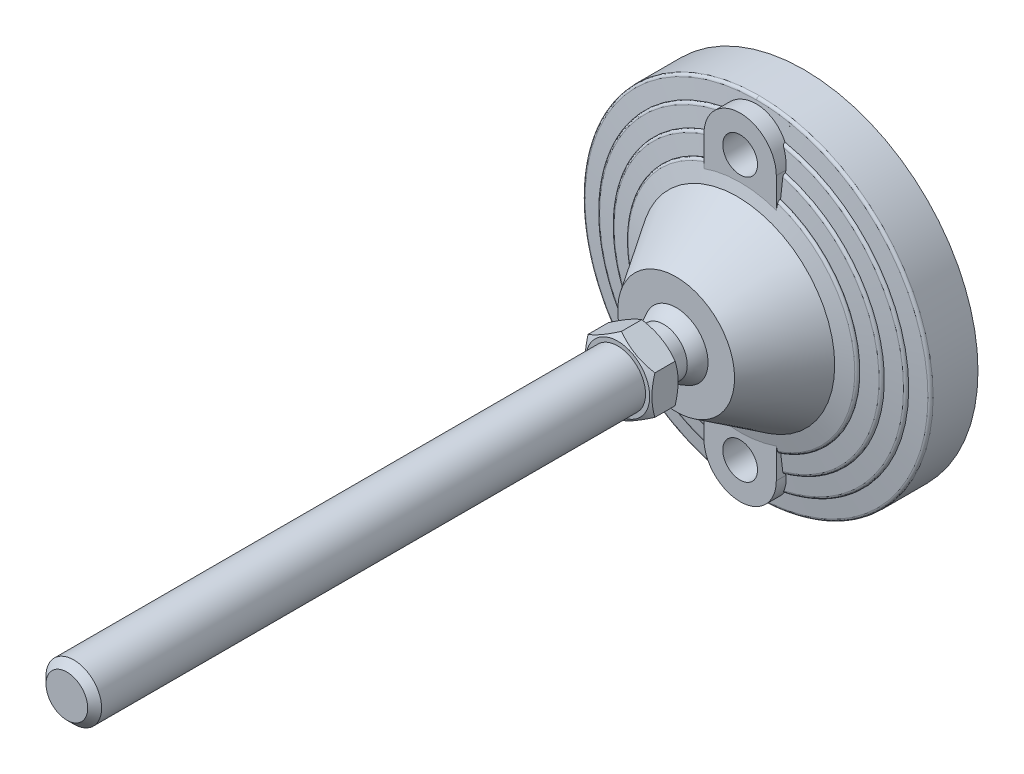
ISO-10303-21;
HEADER;
FILE_DESCRIPTION(('STEP AP214'),'2;1');
FILE_NAME('part.step','',(''),(''),'','','');
FILE_SCHEMA(('AUTOMOTIVE_DESIGN { 1 0 10303 214 1 1 1 1 }'));
ENDSEC;
DATA;
#1=APPLICATION_CONTEXT('core data for automotive mechanical design processes');
#2=APPLICATION_PROTOCOL_DEFINITION('international standard','automotive_design',2000,#1);
#3=PRODUCT_CONTEXT('',#1,'mechanical');
#4=PRODUCT('Part','Part','',(#3));
#5=PRODUCT_RELATED_PRODUCT_CATEGORY('part','',(#4));
#6=PRODUCT_DEFINITION_FORMATION('','',#4);
#7=PRODUCT_DEFINITION_CONTEXT('part definition',#1,'design');
#8=PRODUCT_DEFINITION('design','',#6,#7);
#9=PRODUCT_DEFINITION_SHAPE('','',#8);
#10=(LENGTH_UNIT() NAMED_UNIT(*) SI_UNIT(.MILLI.,.METRE.));
#11=(NAMED_UNIT(*) PLANE_ANGLE_UNIT() SI_UNIT($,.RADIAN.));
#12=(NAMED_UNIT(*) SI_UNIT($,.STERADIAN.) SOLID_ANGLE_UNIT());
#13=UNCERTAINTY_MEASURE_WITH_UNIT(LENGTH_MEASURE(1.E-05),#10,'distance_accuracy_value','');
#14=(GEOMETRIC_REPRESENTATION_CONTEXT(3) GLOBAL_UNCERTAINTY_ASSIGNED_CONTEXT((#13)) GLOBAL_UNIT_ASSIGNED_CONTEXT((#10,
#11,#12)) REPRESENTATION_CONTEXT('',''));
#15=CARTESIAN_POINT('',(0.,0.,0.));
#16=DIRECTION('',(0.,0.,1.));
#17=DIRECTION('',(1.,0.,0.));
#18=AXIS2_PLACEMENT_3D('',#15,#16,#17);
#19=CARTESIAN_POINT('',(-12.,14.022683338,60.));
#20=DIRECTION('',(0.,0.,1.));
#21=DIRECTION('',(0.,-1.,0.));
#22=AXIS2_PLACEMENT_3D('',#19,#20,#21);
#23=PLANE('',#22);
#24=CARTESIAN_POINT('',(0.,0.,60.));
#25=DIRECTION('',(0.,0.,-1.));
#26=DIRECTION('',(0.,1.,0.));
#27=AXIS2_PLACEMENT_3D('',#24,#25,#26);
#28=CIRCLE('',#27,11.5);
#29=CARTESIAN_POINT('',(0.,11.5,60.));
#30=VERTEX_POINT('',#29);
#31=EDGE_CURVE('E212',#30,#30,#28,.T.);
#32=ORIENTED_EDGE('',*,*,#31,.T.);
#33=EDGE_LOOP('',(#32));
#34=FACE_BOUND('',#33,.T.);
#35=CARTESIAN_POINT('',(0.,0.,60.));
#36=DIRECTION('',(0.,0.,-1.));
#37=DIRECTION('',(1.,0.,0.));
#38=AXIS2_PLACEMENT_3D('',#35,#36,#37);
#39=CIRCLE('',#38,8.5);
#40=CARTESIAN_POINT('',(8.5,0.,60.));
#41=VERTEX_POINT('',#40);
#42=EDGE_CURVE('E226',#41,#41,#39,.T.);
#43=ORIENTED_EDGE('',*,*,#42,.F.);
#44=EDGE_LOOP('',(#43));
#45=FACE_BOUND('',#44,.T.);
#46=ADVANCED_FACE('F14',(#34,#45),#23,.F.);
#47=CARTESIAN_POINT('',(0.,0.,60.));
#48=DIRECTION('',(0.,0.,-1.));
#49=DIRECTION('',(1.,0.,0.));
#50=AXIS2_PLACEMENT_3D('',#47,#48,#49);
#51=CYLINDRICAL_SURFACE('',#50,8.5);
#52=CARTESIAN_POINT('',(0.,0.,53.5));
#53=DIRECTION('',(0.,0.,-1.));
#54=DIRECTION('',(1.,0.,0.));
#55=AXIS2_PLACEMENT_3D('',#52,#53,#54);
#56=CIRCLE('',#55,8.5);
#57=CARTESIAN_POINT('',(8.5,0.,53.5));
#58=VERTEX_POINT('',#57);
#59=EDGE_CURVE('E477',#58,#58,#56,.F.);
#60=ORIENTED_EDGE('',*,*,#59,.T.);
#61=EDGE_LOOP('',(#60));
#62=FACE_BOUND('',#61,.T.);
#63=ORIENTED_EDGE('',*,*,#42,.T.);
#64=EDGE_LOOP('',(#63));
#65=FACE_BOUND('',#64,.T.);
#66=ADVANCED_FACE('F1093',(#62,#65),#51,.T.);
#67=CARTESIAN_POINT('',(-55.851524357,55.66,0.));
#68=DIRECTION('',(0.,0.,1.));
#69=DIRECTION('',(0.,-1.,0.));
#70=AXIS2_PLACEMENT_3D('',#67,#68,#69);
#71=PLANE('',#70);
#72=CARTESIAN_POINT('',(0.,0.,0.));
#73=DIRECTION('',(0.,0.,-1.));
#74=DIRECTION('',(0.,1.,0.));
#75=AXIS2_PLACEMENT_3D('',#72,#73,#74);
#76=CIRCLE('',#75,55.);
#77=CARTESIAN_POINT('',(0.,55.,0.));
#78=VERTEX_POINT('',#77);
#79=EDGE_CURVE('E480',#78,#78,#76,.F.);
#80=ORIENTED_EDGE('',*,*,#79,.F.);
#81=EDGE_LOOP('',(#80));
#82=FACE_BOUND('',#81,.T.);
#83=ADVANCED_FACE('F1083',(#82),#71,.F.);
#84=CARTESIAN_POINT('',(-8.631599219,8.622532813,53.5));
#85=DIRECTION('',(0.,0.,1.));
#86=DIRECTION('',(0.,-1.,0.));
#87=AXIS2_PLACEMENT_3D('',#84,#85,#86);
#88=PLANE('',#87);
#89=CARTESIAN_POINT('',(0.,0.,53.5));
#90=DIRECTION('',(0.,0.,-1.));
#91=DIRECTION('',(0.,1.,0.));
#92=AXIS2_PLACEMENT_3D('',#89,#90,#91);
#93=CIRCLE('',#92,8.49107182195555);
#94=CARTESIAN_POINT('',(0.,8.49107182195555,53.5));
#95=VERTEX_POINT('',#94);
#96=EDGE_CURVE('E483',#95,#95,#93,.T.);
#97=ORIENTED_EDGE('',*,*,#96,.F.);
#98=EDGE_LOOP('',(#97));
#99=FACE_BOUND('',#98,.T.);
#100=ORIENTED_EDGE('',*,*,#59,.F.);
#101=EDGE_LOOP('',(#100));
#102=FACE_BOUND('',#101,.T.);
#103=ADVANCED_FACE('F1074',(#99,#102),#88,.F.);
#104=CARTESIAN_POINT('',(0.,0.,3.));
#105=DIRECTION('',(0.,0.,-1.));
#106=DIRECTION('',(0.,1.,0.));
#107=AXIS2_PLACEMENT_3D('',#104,#105,#106);
#108=CYLINDRICAL_SURFACE('',#107,55.);
#109=ORIENTED_EDGE('',*,*,#79,.T.);
#110=EDGE_LOOP('',(#109));
#111=FACE_BOUND('',#110,.T.);
#112=CARTESIAN_POINT('',(0.,0.,3.));
#113=DIRECTION('',(0.,0.,-1.));
#114=DIRECTION('',(0.,1.,0.));
#115=AXIS2_PLACEMENT_3D('',#112,#113,#114);
#116=CIRCLE('',#115,55.);
#117=CARTESIAN_POINT('',(0.,55.,3.));
#118=VERTEX_POINT('',#117);
#119=EDGE_CURVE('E486',#118,#118,#116,.T.);
#120=ORIENTED_EDGE('',*,*,#119,.T.);
#121=EDGE_LOOP('',(#120));
#122=FACE_BOUND('',#121,.T.);
#123=ADVANCED_FACE('F603',(#111,#122),#108,.T.);
#124=CARTESIAN_POINT('',(0.,0.,44.670266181));
#125=DIRECTION('',(0.,0.,-1.));
#126=DIRECTION('',(1.,0.,0.));
#127=AXIS2_PLACEMENT_3D('',#124,#125,#126);
#128=SPHERICAL_SURFACE('',#127,12.25);
#129=CARTESIAN_POINT('',(0.,0.,49.));
#130=DIRECTION('',(0.,0.,-1.));
#131=DIRECTION('',(0.,1.,0.));
#132=AXIS2_PLACEMENT_3D('',#129,#130,#131);
#133=CIRCLE('',#132,11.4593152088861);
#134=CARTESIAN_POINT('',(0.,11.4593152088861,49.));
#135=VERTEX_POINT('',#134);
#136=EDGE_CURVE('E489',#135,#135,#133,.F.);
#137=ORIENTED_EDGE('',*,*,#136,.T.);
#138=EDGE_LOOP('',(#137));
#139=FACE_BOUND('',#138,.T.);
#140=ORIENTED_EDGE('',*,*,#96,.T.);
#141=EDGE_LOOP('',(#140));
#142=FACE_BOUND('',#141,.T.);
#143=ADVANCED_FACE('F598',(#139,#142),#128,.T.);
#144=CARTESIAN_POINT('',(-6.346764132,-41.175,3.));
#145=DIRECTION('',(0.,0.,1.));
#146=DIRECTION('',(0.,-1.,0.));
#147=AXIS2_PLACEMENT_3D('',#144,#145,#146);
#148=PLANE('',#147);
#149=CARTESIAN_POINT('',(0.,-47.5,3.));
#150=DIRECTION('',(0.,0.,1.));
#151=DIRECTION('',(0.,-1.,0.));
#152=AXIS2_PLACEMENT_3D('',#149,#150,#151);
#153=CIRCLE('',#152,6.25);
#154=CARTESIAN_POINT('',(0.,-53.75,3.));
#155=VERTEX_POINT('',#154);
#156=EDGE_CURVE('E451',#155,#155,#153,.T.);
#157=ORIENTED_EDGE('',*,*,#156,.T.);
#158=EDGE_LOOP('',(#157));
#159=FACE_BOUND('',#158,.T.);
#160=ADVANCED_FACE('F602',(#159),#148,.T.);
#161=CARTESIAN_POINT('',(-63.467641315,63.25,3.));
#162=DIRECTION('',(0.,0.,1.));
#163=DIRECTION('',(0.,-1.,0.));
#164=AXIS2_PLACEMENT_3D('',#161,#162,#163);
#165=PLANE('',#164);
#166=ORIENTED_EDGE('',*,*,#119,.F.);
#167=EDGE_LOOP('',(#166));
#168=FACE_BOUND('',#167,.T.);
#169=CARTESIAN_POINT('',(0.,0.,3.));
#170=DIRECTION('',(0.,0.,-1.));
#171=DIRECTION('',(0.,1.,0.));
#172=AXIS2_PLACEMENT_3D('',#169,#170,#171);
#173=CIRCLE('',#172,62.5);
#174=CARTESIAN_POINT('',(0.,62.5,3.));
#175=VERTEX_POINT('',#174);
#176=EDGE_CURVE('E414',#175,#175,#173,.F.);
#177=ORIENTED_EDGE('',*,*,#176,.F.);
#178=EDGE_LOOP('',(#177));
#179=FACE_BOUND('',#178,.T.);
#180=ADVANCED_FACE('F1054',(#168,#179),#165,.F.);
#181=CARTESIAN_POINT('',(-21.325127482,-21.252,49.));
#182=DIRECTION('',(0.,0.,-1.));
#183=DIRECTION('',(0.,1.,0.));
#184=AXIS2_PLACEMENT_3D('',#181,#182,#183);
#185=PLANE('',#184);
#186=ORIENTED_EDGE('',*,*,#136,.F.);
#187=EDGE_LOOP('',(#186));
#188=FACE_BOUND('',#187,.T.);
#189=CARTESIAN_POINT('',(0.,0.,49.));
#190=DIRECTION('',(0.,0.,-1.));
#191=DIRECTION('',(1.,0.,0.));
#192=AXIS2_PLACEMENT_3D('',#189,#190,#191);
#193=CIRCLE('',#192,21.);
#194=CARTESIAN_POINT('',(21.,0.,49.));
#195=VERTEX_POINT('',#194);
#196=EDGE_CURVE('E588',#195,#195,#193,.T.);
#197=ORIENTED_EDGE('',*,*,#196,.F.);
#198=EDGE_LOOP('',(#197));
#199=FACE_BOUND('',#198,.T.);
#200=ADVANCED_FACE('F608',(#188,#199),#185,.F.);
#201=CARTESIAN_POINT('',(0.,-47.5,3.));
#202=DIRECTION('',(0.,0.,1.));
#203=DIRECTION('',(0.,-1.,0.));
#204=AXIS2_PLACEMENT_3D('',#201,#202,#203);
#205=CYLINDRICAL_SURFACE('',#204,6.25);
#206=ORIENTED_EDGE('',*,*,#156,.F.);
#207=EDGE_LOOP('',(#206));
#208=FACE_BOUND('',#207,.T.);
#209=CARTESIAN_POINT('',(0.,-47.5,26.));
#210=DIRECTION('',(0.,0.,1.));
#211=DIRECTION('',(0.,-1.,0.));
#212=AXIS2_PLACEMENT_3D('',#209,#210,#211);
#213=CIRCLE('',#212,6.25);
#214=CARTESIAN_POINT('',(0.,-53.75,26.));
#215=VERTEX_POINT('',#214);
#216=EDGE_CURVE('E587',#215,#215,#213,.T.);
#217=ORIENTED_EDGE('',*,*,#216,.T.);
#218=EDGE_LOOP('',(#217));
#219=FACE_BOUND('',#218,.T.);
#220=ADVANCED_FACE('F606',(#208,#219),#205,.F.);
#221=CARTESIAN_POINT('',(-6.346764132,53.825,3.));
#222=DIRECTION('',(0.,0.,1.));
#223=DIRECTION('',(0.,-1.,0.));
#224=AXIS2_PLACEMENT_3D('',#221,#222,#223);
#225=PLANE('',#224);
#226=CARTESIAN_POINT('',(0.,47.5,3.));
#227=DIRECTION('',(0.,0.,1.));
#228=DIRECTION('',(0.,-1.,0.));
#229=AXIS2_PLACEMENT_3D('',#226,#227,#228);
#230=CIRCLE('',#229,6.25);
#231=CARTESIAN_POINT('',(0.,41.25,3.));
#232=VERTEX_POINT('',#231);
#233=EDGE_CURVE('E239',#232,#232,#230,.T.);
#234=ORIENTED_EDGE('',*,*,#233,.T.);
#235=EDGE_LOOP('',(#234));
#236=FACE_BOUND('',#235,.T.);
#237=ADVANCED_FACE('F335',(#236),#225,.T.);
#238=CARTESIAN_POINT('',(12.406354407,39.602176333,24.568111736));
#239=CARTESIAN_POINT('',(59.707464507,24.78394183,24.568111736));
#240=CARTESIAN_POINT('',(59.707464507,-24.78394183,24.568111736));
#241=CARTESIAN_POINT('',(12.406354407,-39.602176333,24.568111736));
#242=CARTESIAN_POINT('',(12.406354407,39.602176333,25.044046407));
#243=CARTESIAN_POINT('',(59.707464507,24.78394183,25.044046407));
#244=CARTESIAN_POINT('',(59.707464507,-24.78394183,25.044046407));
#245=CARTESIAN_POINT('',(12.406354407,-39.602176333,25.044046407));
#246=CARTESIAN_POINT('',(12.31903347,39.323440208,25.419805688));
#247=CARTESIAN_POINT('',(59.287219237,24.609502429,25.419805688));
#248=CARTESIAN_POINT('',(59.287219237,-24.609502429,25.419805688));
#249=CARTESIAN_POINT('',(12.31903347,-39.323440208,25.419805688));
#250=CARTESIAN_POINT('',(12.18115046,38.883305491,25.53720891));
#251=CARTESIAN_POINT('',(58.623636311,24.334056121,25.53720891));
#252=CARTESIAN_POINT('',(58.623636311,-24.334056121,25.53720891));
#253=CARTESIAN_POINT('',(12.18115046,-38.883305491,25.53720891));
#254=(BOUNDED_SURFACE() B_SPLINE_SURFACE(3,3,((#238,#239,#240,#241),(#242,#243,#244,#245),(#246,
#247,#248,#249),(#250,#251,#252,#253)),.UNSPECIFIED.,.F.,.F.,
.F.) B_SPLINE_SURFACE_WITH_KNOTS((4,4),(4,4),(0.,1.),(0.,1.),
.UNSPECIFIED.) GEOMETRIC_REPRESENTATION_ITEM() RATIONAL_B_SPLINE_SURFACE(((1.,0.532632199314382,
0.532632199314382,1.),(0.859679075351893,0.457892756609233,0.457892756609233,0.859679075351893),
(0.859679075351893,0.457892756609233,0.457892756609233,0.859679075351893),(1.,0.532632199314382,
0.532632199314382,1.))) REPRESENTATION_ITEM('') SURFACE());
#255=CARTESIAN_POINT('',(0.,0.,25.5372089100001));
#256=DIRECTION('',(0.,0.,-1.));
#257=DIRECTION('',(0.,1.,0.));
#258=AXIS2_PLACEMENT_3D('',#255,#256,#257);
#259=CIRCLE('',#258,40.746679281);
#260=CARTESIAN_POINT('',(13.,-38.6172483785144,25.537208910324));
#261=VERTEX_POINT('',#260);
#262=CARTESIAN_POINT('',(13.,38.6172483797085,25.5372089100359));
#263=VERTEX_POINT('',#262);
#264=EDGE_CURVE('E452',#261,#263,#259,.F.);
#265=CARTESIAN_POINT('',(13.,-39.4112927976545,24.5681117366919));
#266=CARTESIAN_POINT('',(13.,-39.4112933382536,24.59521048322));
#267=CARTESIAN_POINT('',(13.,-39.4101321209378,24.6222958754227));
#268=CARTESIAN_POINT('',(13.,-39.405504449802,24.6762650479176));
#269=CARTESIAN_POINT('',(13.,-39.4020383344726,24.7031488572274));
#270=CARTESIAN_POINT('',(13.,-39.3882336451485,24.7831079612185));
#271=CARTESIAN_POINT('',(13.,-39.3744885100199,24.8356344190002));
#272=CARTESIAN_POINT('',(13.,-39.3384084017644,24.937608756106));
#273=CARTESIAN_POINT('',(13.,-39.3160736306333,24.9870567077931));
#274=CARTESIAN_POINT('',(13.,-39.263590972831,25.0816017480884));
#275=CARTESIAN_POINT('',(13.,-39.233444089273,25.1266993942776));
#276=CARTESIAN_POINT('',(13.,-39.1656058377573,25.2123360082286));
#277=CARTESIAN_POINT('',(13.,-39.1277714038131,25.2527614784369));
#278=CARTESIAN_POINT('',(13.,-39.0461074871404,25.327071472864));
#279=CARTESIAN_POINT('',(13.,-39.0022718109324,25.3609491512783));
#280=CARTESIAN_POINT('',(13.,-38.9043172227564,25.4250520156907));
#281=CARTESIAN_POINT('',(13.,-38.8495953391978,25.454364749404));
#282=CARTESIAN_POINT('',(13.,-38.7644641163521,25.4909906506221));
#283=CARTESIAN_POINT('',(13.,-38.7355751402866,25.5019763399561));
#284=CARTESIAN_POINT('',(13.,-38.6769796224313,25.5214626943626));
#285=CARTESIAN_POINT('',(13.,-38.6472733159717,25.5299640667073));
#286=CARTESIAN_POINT('',(13.,-38.6172483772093,25.5372089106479));
#287=B_SPLINE_CURVE_WITH_KNOTS('',3,(#265,#266,#267,#268,#269,#270,#271,#272,#273,#274,#275,
#276,#277,#278,#279,#280,#281,#282,#283,#284,#285,#286),.UNSPECIFIED.,.F.,.F.,(4,2,2,2,2,2,2,2,
2,2,4),(0.,0.0812450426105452,0.162478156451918,0.32451953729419,0.486557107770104,
0.648573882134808,0.813939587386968,0.979477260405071,1.16468654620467,1.25731455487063,
1.34991616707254),.UNSPECIFIED.);
#288=CARTESIAN_POINT('',(13.,-39.4112927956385,24.568111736));
#289=VERTEX_POINT('',#288);
#290=EDGE_CURVE('E321',#289,#261,#287,.T.);
#291=CARTESIAN_POINT('',(0.,0.,24.568111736));
#292=DIRECTION('',(0.,0.,-1.));
#293=DIRECTION('',(0.,1.,0.));
#294=AXIS2_PLACEMENT_3D('',#291,#292,#293);
#295=CIRCLE('',#294,41.5);
#296=CARTESIAN_POINT('',(13.,39.4112927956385,24.5681117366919));
#297=VERTEX_POINT('',#296);
#298=EDGE_CURVE('E449',#297,#289,#295,.T.);
#299=CARTESIAN_POINT('',(13.,38.6172483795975,25.5372089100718));
#300=CARTESIAN_POINT('',(13.,38.6757273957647,25.5231434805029));
#301=CARTESIAN_POINT('',(13.,38.7330575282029,25.5042077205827));
#302=CARTESIAN_POINT('',(13.,38.843898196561,25.4570874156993));
#303=CARTESIAN_POINT('',(13.,38.8974017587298,25.4288864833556));
#304=CARTESIAN_POINT('',(13.,38.9989209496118,25.3637346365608));
#305=CARTESIAN_POINT('',(13.,39.0469285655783,25.3267711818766));
#306=CARTESIAN_POINT('',(13.,39.1357078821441,25.2450475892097));
#307=CARTESIAN_POINT('',(13.,39.1764870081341,25.2002955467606));
#308=CARTESIAN_POINT('',(13.,39.2479885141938,25.1059931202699));
#309=CARTESIAN_POINT('',(13.,39.2790300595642,25.0566848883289));
#310=CARTESIAN_POINT('',(13.,39.3318958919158,24.9533393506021));
#311=CARTESIAN_POINT('',(13.,39.3537228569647,24.8993034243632));
#312=CARTESIAN_POINT('',(13.,39.3839717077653,24.7991363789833));
#313=CARTESIAN_POINT('',(13.,39.3941848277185,24.7535382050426));
#314=CARTESIAN_POINT('',(13.,39.4078594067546,24.6613400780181));
#315=CARTESIAN_POINT('',(13.,39.411320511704,24.6147400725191));
#316=CARTESIAN_POINT('',(13.,39.4112927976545,24.5681117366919));
#317=B_SPLINE_CURVE_WITH_KNOTS('',3,(#299,#300,#301,#302,#303,#304,#305,#306,#307,#308,#309,
#310,#311,#312,#313,#314,#315,#316),.UNSPECIFIED.,.F.,.F.,(4,2,2,2,2,2,2,2,4),(0.,
0.180276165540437,0.360872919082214,0.541729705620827,0.722399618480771,0.89631033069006,
1.07017046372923,1.20986980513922,1.34957647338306),.UNSPECIFIED.);
#318=EDGE_CURVE('E238',#263,#297,#317,.T.);
#319=ORIENTED_EDGE('',*,*,#264,.F.);
#320=ORIENTED_EDGE('',*,*,#290,.F.);
#321=ORIENTED_EDGE('',*,*,#298,.F.);
#322=ORIENTED_EDGE('',*,*,#318,.F.);
#323=EDGE_LOOP('',(#319,#320,#321,#322));
#324=FACE_BOUND('',#323,.T.);
#325=ADVANCED_FACE('F610',(#324),#254,.T.);
#326=CARTESIAN_POINT('',(0.,0.,24.568111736));
#327=DIRECTION('',(0.,0.,-1.));
#328=DIRECTION('',(0.,1.,0.));
#329=AXIS2_PLACEMENT_3D('',#326,#327,#328);
#330=CYLINDRICAL_SURFACE('',#329,41.5);
#331=CARTESIAN_POINT('',(0.,0.,24.454545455));
#332=DIRECTION('',(0.,0.,-1.));
#333=DIRECTION('',(0.,1.,0.));
#334=AXIS2_PLACEMENT_3D('',#331,#332,#333);
#335=CIRCLE('',#334,41.5);
#336=CARTESIAN_POINT('',(13.,39.4112927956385,24.454545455));
#337=VERTEX_POINT('',#336);
#338=CARTESIAN_POINT('',(13.,-39.4112927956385,24.4545454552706));
#339=VERTEX_POINT('',#338);
#340=EDGE_CURVE('E447',#337,#339,#335,.T.);
#341=ORIENTED_EDGE('',*,*,#340,.F.);
#342=DIRECTION('',(0.,0.,-1.));
#343=VECTOR('',#342,1.);
#344=CARTESIAN_POINT('',(13.,39.4112927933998,24.2785712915));
#345=LINE('',#344,#343);
#346=EDGE_CURVE('E291',#297,#337,#345,.T.);
#347=ORIENTED_EDGE('',*,*,#346,.F.);
#348=ORIENTED_EDGE('',*,*,#298,.T.);
#349=DIRECTION('',(0.,0.,1.));
#350=VECTOR('',#349,1.);
#351=CARTESIAN_POINT('',(13.,-39.4112927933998,24.2785712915));
#352=LINE('',#351,#350);
#353=EDGE_CURVE('E319',#339,#289,#352,.T.);
#354=ORIENTED_EDGE('',*,*,#353,.F.);
#355=EDGE_LOOP('',(#341,#347,#348,#354));
#356=FACE_BOUND('',#355,.T.);
#357=ADVANCED_FACE('F303',(#356),#330,.T.);
#358=CARTESIAN_POINT('',(0.,0.,24.454545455));
#359=DIRECTION('',(0.,0.,-1.));
#360=DIRECTION('',(0.,1.,0.));
#361=AXIS2_PLACEMENT_3D('',#358,#359,#360);
#362=CONICAL_SURFACE('',#361,41.5,1.4442041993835);
#363=ORIENTED_EDGE('',*,*,#340,.T.);
#364=CARTESIAN_POINT('',(13.0000000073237,-45.8176832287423,23.6748403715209));
#365=CARTESIAN_POINT('',(13.0000000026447,-45.2838642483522,23.7402005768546));
#366=CARTESIAN_POINT('',(13.000000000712,-44.7500350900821,23.8054777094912));
#367=CARTESIAN_POINT('',(12.999999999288,-43.6823542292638,23.9358466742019));
#368=CARTESIAN_POINT('',(12.9999999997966,-43.1485025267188,24.0009385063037));
#369=CARTESIAN_POINT('',(13.0000000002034,-42.0807742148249,24.1309177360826));
#370=CARTESIAN_POINT('',(13.0000000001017,-41.5468976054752,24.195805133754));
#371=CARTESIAN_POINT('',(12.9999999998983,-40.4791166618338,24.3253520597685));
#372=CARTESIAN_POINT('',(12.9999999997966,-39.9452123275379,24.3900115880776));
#373=CARTESIAN_POINT('',(13.,-39.4112927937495,24.4545454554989));
#374=B_SPLINE_CURVE_WITH_KNOTS('',3,(#364,#365,#366,#367,#368,#369,#370,#371,#372,#373),
.UNSPECIFIED.,.F.,.F.,(4,2,2,2,4),(0.,1.61341623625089,3.22683223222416,4.84024827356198,
6.4536645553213),.UNSPECIFIED.);
#375=CARTESIAN_POINT('',(13.,-45.8176832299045,23.674840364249));
#376=VERTEX_POINT('',#375);
#377=EDGE_CURVE('E311',#376,#339,#374,.T.);
#378=ORIENTED_EDGE('',*,*,#377,.F.);
#379=CARTESIAN_POINT('',(-7.48558333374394E-10,0.,23.674840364));
#380=DIRECTION('',(0.,0.,-1.));
#381=DIRECTION('',(0.,1.,0.));
#382=AXIS2_PLACEMENT_3D('',#379,#380,#381);
#383=CIRCLE('',#382,47.6262542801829);
#384=CARTESIAN_POINT('',(13.,45.8176832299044,23.6748403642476));
#385=VERTEX_POINT('',#384);
#386=EDGE_CURVE('E412',#385,#376,#383,.T.);
#387=ORIENTED_EDGE('',*,*,#386,.F.);
#388=CARTESIAN_POINT('',(13.,39.4112927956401,24.4545454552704));
#389=CARTESIAN_POINT('',(13.,39.9452123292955,24.3900115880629));
#390=CARTESIAN_POINT('',(13.,40.4791166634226,24.3253520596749));
#391=CARTESIAN_POINT('',(13.,41.5468976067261,24.195805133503));
#392=CARTESIAN_POINT('',(13.,42.0807742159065,24.1309177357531));
#393=CARTESIAN_POINT('',(13.,43.1485025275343,24.0009385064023));
#394=CARTESIAN_POINT('',(13.,43.6823542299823,23.9358466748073));
#395=CARTESIAN_POINT('',(13.,44.7500350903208,23.805477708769));
#396=CARTESIAN_POINT('',(13.,45.283864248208,23.7402005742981));
#397=CARTESIAN_POINT('',(13.,45.8176832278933,23.6748403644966));
#398=B_SPLINE_CURVE_WITH_KNOTS('',3,(#388,#389,#390,#391,#392,#393,#394,#395,#396,#397),
.UNSPECIFIED.,.F.,.F.,(4,2,2,2,4),(0.,1.61341628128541,3.22683232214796,4.84024831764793,
6.45366455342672),.UNSPECIFIED.);
#399=EDGE_CURVE('E283',#337,#385,#398,.T.);
#400=ORIENTED_EDGE('',*,*,#399,.F.);
#401=EDGE_LOOP('',(#363,#378,#387,#400));
#402=FACE_BOUND('',#401,.T.);
#403=ADVANCED_FACE('F298',(#402),#362,.T.);
#404=CARTESIAN_POINT('',(12.269850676,46.922284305,22.669623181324));
#405=CARTESIAN_POINT('',(72.557631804,31.157449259,22.669623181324));
#406=CARTESIAN_POINT('',(72.557631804,-31.157449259,22.669623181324));
#407=CARTESIAN_POINT('',(12.269850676,-46.922284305,22.669623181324));
#408=CARTESIAN_POINT('',(12.269850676,46.922284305,22.6740296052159));
#409=CARTESIAN_POINT('',(72.557631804,31.157449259,22.674029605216));
#410=CARTESIAN_POINT('',(72.557631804,-31.157449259,22.674029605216));
#411=CARTESIAN_POINT('',(12.269850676,-46.922284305,22.6740296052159));
#412=CARTESIAN_POINT('',(12.269850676,46.922284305,22.678436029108));
#413=CARTESIAN_POINT('',(72.557631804,31.157449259,22.678436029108));
#414=CARTESIAN_POINT('',(72.557631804,-31.157449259,22.678436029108));
#415=CARTESIAN_POINT('',(12.269850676,-46.922284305,22.678436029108));
#416=CARTESIAN_POINT('',(12.269850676,46.922284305,22.682842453));
#417=CARTESIAN_POINT('',(72.557631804,31.157449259,22.682842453));
#418=CARTESIAN_POINT('',(72.557631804,-31.157449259,22.682842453));
#419=CARTESIAN_POINT('',(12.269850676,-46.922284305,22.682842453));
#420=CARTESIAN_POINT('',(12.269850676,46.922284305,23.211436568));
#421=CARTESIAN_POINT('',(72.557631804,31.157449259,23.211436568));
#422=CARTESIAN_POINT('',(72.557631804,-31.157449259,23.211436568));
#423=CARTESIAN_POINT('',(12.269850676,-46.922284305,23.211436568));
#424=CARTESIAN_POINT('',(12.181461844,46.584268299,23.608103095));
#425=CARTESIAN_POINT('',(72.034945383,30.93299905,23.608103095));
#426=CARTESIAN_POINT('',(72.034945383,-30.93299905,23.608103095));
#427=CARTESIAN_POINT('',(12.181461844,-46.584268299,23.608103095));
#428=CARTESIAN_POINT('',(12.048804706,46.076961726,23.674840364));
#429=CARTESIAN_POINT('',(71.250478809,30.596136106,23.674840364));
#430=CARTESIAN_POINT('',(71.250478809,-30.596136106,23.674840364));
#431=CARTESIAN_POINT('',(12.048804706,-46.076961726,23.674840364));
#432=(BOUNDED_SURFACE() B_SPLINE_SURFACE(3,3,((#404,#405,#406,#407),(#408,#409,#410,#411),(#412,
#413,#414,#415),(#416,#417,#418,#419),(#420,#421,#422,#423),(#424,#425,#426,#427),(#428,#429,
#430,#431)),.UNSPECIFIED.,.F.,.F.,.F.) B_SPLINE_SURFACE_WITH_KNOTS((4,3,4),(4,4),(-0.01,0.,1.),
(0.,1.),.UNSPECIFIED.) GEOMETRIC_REPRESENTATION_ITEM() RATIONAL_B_SPLINE_SURFACE(((1.,
0.501991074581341,0.501991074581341,1.),(1.,0.501991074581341,0.501991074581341,1.),(1.,
0.501991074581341,0.501991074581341,1.),(1.,0.501991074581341,0.501991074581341,1.),
(0.833611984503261,0.418465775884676,0.418465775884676,0.833611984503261),(0.833611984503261,
0.418465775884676,0.418465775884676,0.833611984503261),(1.,0.501991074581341,0.501991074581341,1.))) REPRESENTATION_ITEM('') SURFACE());
#433=CARTESIAN_POINT('',(13.,-46.7252608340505,22.6777848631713));
#434=CARTESIAN_POINT('',(13.,-46.7253979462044,22.7054287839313));
#435=CARTESIAN_POINT('',(13.,-46.7243484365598,22.7330653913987));
#436=CARTESIAN_POINT('',(13.,-46.7198870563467,22.7881439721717));
#437=CARTESIAN_POINT('',(13.,-46.7164754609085,22.8155859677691));
#438=CARTESIAN_POINT('',(13.,-46.7027375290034,22.8972169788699));
#439=CARTESIAN_POINT('',(13.,-46.688908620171,22.9508576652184));
#440=CARTESIAN_POINT('',(13.,-46.6523707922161,23.0550506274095));
#441=CARTESIAN_POINT('',(13.,-46.6296523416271,23.1055995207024));
#442=CARTESIAN_POINT('',(13.,-46.5760978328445,23.2021956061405));
#443=CARTESIAN_POINT('',(13.,-46.545261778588,23.248242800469));
#444=CARTESIAN_POINT('',(13.,-46.4762858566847,23.3348542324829));
#445=CARTESIAN_POINT('',(13.,-46.438110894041,23.3753904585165));
#446=CARTESIAN_POINT('',(13.,-46.3556866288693,23.4497572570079));
#447=CARTESIAN_POINT('',(13.,-46.3114344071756,23.4835845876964));
#448=CARTESIAN_POINT('',(13.,-46.2164675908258,23.5448274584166));
#449=CARTESIAN_POINT('',(13.,-46.1655796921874,23.5719736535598));
#450=CARTESIAN_POINT('',(13.,-46.0601083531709,23.6176355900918));
#451=CARTESIAN_POINT('',(13.,-46.0055288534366,23.6361603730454));
#452=CARTESIAN_POINT('',(13.,-45.9281089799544,23.6556819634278));
#453=CARTESIAN_POINT('',(13.,-45.9061721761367,23.660484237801));
#454=CARTESIAN_POINT('',(13.,-45.8620822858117,23.6686997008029));
#455=CARTESIAN_POINT('',(13.,-45.8399296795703,23.6721154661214));
#456=CARTESIAN_POINT('',(13.0000000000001,-45.817683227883,23.6748403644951));
#457=B_SPLINE_CURVE_WITH_KNOTS('',3,(#433,#434,#435,#436,#437,#438,#439,#440,#441,#442,#443,
#444,#445,#446,#447,#448,#449,#450,#451,#452,#453,#454,#455,#456),.UNSPECIFIED.,.F.,.F.,(4,2,2,
2,2,2,2,2,2,2,2,4),(0.,0.0828810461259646,0.165752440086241,0.331061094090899,0.496547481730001,
0.662033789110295,0.828332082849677,0.994710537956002,1.16697834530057,1.33906508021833,
1.40639957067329,1.47360834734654),.UNSPECIFIED.);
#458=CARTESIAN_POINT('',(13.0000000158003,-46.7252608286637,22.6777848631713));
#459=VERTEX_POINT('',#458);
#460=EDGE_CURVE('E320',#459,#376,#457,.T.);
#461=CARTESIAN_POINT('',(13.0000000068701,46.7252608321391,22.6727272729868));
#462=CARTESIAN_POINT('',(13.3212147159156,46.635891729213,22.6727272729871));
#463=CARTESIAN_POINT('',(13.6414983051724,46.5432129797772,22.6727272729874));
#464=CARTESIAN_POINT('',(14.2801231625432,46.3512597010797,22.672727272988));
#465=CARTESIAN_POINT('',(14.5984642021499,46.2519844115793,22.6727272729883));
#466=CARTESIAN_POINT('',(15.5526106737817,45.9435979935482,22.6727272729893));
#467=CARTESIAN_POINT('',(16.1852411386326,45.7245656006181,22.6727272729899));
#468=CARTESIAN_POINT('',(17.4409289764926,45.2604918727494,22.6727272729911));
#469=CARTESIAN_POINT('',(18.0639854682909,45.01544815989,22.6727272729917));
#470=CARTESIAN_POINT('',(19.3000708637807,44.4995075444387,22.672727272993));
#471=CARTESIAN_POINT('',(19.9130888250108,44.228584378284,22.6727272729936));
#472=CARTESIAN_POINT('',(21.1274202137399,43.6615551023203,22.6727272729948));
#473=CARTESIAN_POINT('',(21.7287319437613,43.3654453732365,22.6727272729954));
#474=CARTESIAN_POINT('',(23.5288179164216,42.4321391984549,22.6727272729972));
#475=CARTESIAN_POINT('',(24.7079785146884,41.7565378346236,22.6727272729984));
#476=CARTESIAN_POINT('',(27.0057517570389,40.308619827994,22.6727272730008));
#477=CARTESIAN_POINT('',(28.1243409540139,39.5362661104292,22.672727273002));
#478=CARTESIAN_POINT('',(30.294054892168,37.8994558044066,22.6727272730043));
#479=CARTESIAN_POINT('',(31.3451007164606,37.0348945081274,22.6727272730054));
#480=CARTESIAN_POINT('',(33.3707378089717,35.2206260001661,22.6727272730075));
#481=CARTESIAN_POINT('',(34.3453363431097,34.2709268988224,22.6727272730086));
#482=CARTESIAN_POINT('',(36.2141318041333,32.2900336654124,22.6727272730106));
#483=CARTESIAN_POINT('',(37.1080775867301,31.258602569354,22.6727272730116));
#484=CARTESIAN_POINT('',(38.8059105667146,29.1240638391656,22.6727272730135));
#485=CARTESIAN_POINT('',(39.6097954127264,28.0209543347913,22.6727272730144));
#486=CARTESIAN_POINT('',(41.1215543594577,25.7512426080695,22.6727272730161));
#487=CARTESIAN_POINT('',(41.8294551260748,24.5846581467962,22.6727272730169));
#488=CARTESIAN_POINT('',(43.1444737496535,22.1960153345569,22.6727272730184));
#489=CARTESIAN_POINT('',(43.7515922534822,20.9739573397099,22.6727272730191));
#490=CARTESIAN_POINT('',(44.8608053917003,18.482892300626,22.6727272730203));
#491=CARTESIAN_POINT('',(45.362887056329,17.2138794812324,22.6727272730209));
#492=CARTESIAN_POINT('',(46.2583633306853,14.6380667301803,22.6727272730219));
#493=CARTESIAN_POINT('',(46.6517577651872,13.331266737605,22.6727272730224));
#494=CARTESIAN_POINT('',(47.3270705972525,10.6891374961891,22.6727272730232));
#495=CARTESIAN_POINT('',(47.6089860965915,9.3538075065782,22.6727272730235));
#496=CARTESIAN_POINT('',(48.0593220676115,6.66414532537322,22.672727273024));
#497=CARTESIAN_POINT('',(48.2277425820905,5.30981314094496,22.6727272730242));
#498=CARTESIAN_POINT('',(48.4498861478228,2.5918387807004,22.6727272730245));
#499=CARTESIAN_POINT('',(48.5036145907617,1.2281970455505,22.6727272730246));
#500=CARTESIAN_POINT('',(48.4960080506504,-1.49876561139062,22.6727272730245));
#501=CARTESIAN_POINT('',(48.4346730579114,-2.86208653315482,22.6727272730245));
#502=CARTESIAN_POINT('',(48.1973677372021,-5.57880747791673,22.6727272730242));
#503=CARTESIAN_POINT('',(48.021389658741,-6.93220682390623,22.672727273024));
#504=CARTESIAN_POINT('',(47.5560413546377,-9.61936956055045,22.6727272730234));
#505=CARTESIAN_POINT('',(47.2666711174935,-10.9531329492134,22.6727272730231));
#506=CARTESIAN_POINT('',(46.5765756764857,-13.5916227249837,22.6727272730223));
#507=CARTESIAN_POINT('',(46.1758433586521,-14.8963472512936,22.6727272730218));
#508=CARTESIAN_POINT('',(45.2658742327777,-17.467402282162,22.6727272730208));
#509=CARTESIAN_POINT('',(44.7566374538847,-18.7337327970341,22.6727272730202));
#510=CARTESIAN_POINT('',(43.6334165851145,-21.218718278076,22.6727272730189));
#511=CARTESIAN_POINT('',(43.0194530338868,-22.4373825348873,22.6727272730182));
#512=CARTESIAN_POINT('',(41.6909757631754,-24.8187625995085,22.6727272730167));
#513=CARTESIAN_POINT('',(40.9764619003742,-25.9814783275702,22.6727272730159));
#514=CARTESIAN_POINT('',(39.7063025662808,-27.8655028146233,22.6727272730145));
#515=CARTESIAN_POINT('',(39.1770724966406,-28.6047764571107,22.6727272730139));
#516=CARTESIAN_POINT('',(38.0778809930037,-30.052466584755,22.6727272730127));
#517=CARTESIAN_POINT('',(37.5079195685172,-30.7608830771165,22.6727272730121));
#518=CARTESIAN_POINT('',(36.3291070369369,-32.1445499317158,22.6727272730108));
#519=CARTESIAN_POINT('',(35.7202564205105,-32.8198007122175,22.6727272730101));
#520=CARTESIAN_POINT('',(34.4653645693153,-34.1352484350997,22.6727272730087));
#521=CARTESIAN_POINT('',(33.8193109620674,-34.7754335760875,22.672727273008));
#522=CARTESIAN_POINT('',(32.4922294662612,-36.0184899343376,22.6727272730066));
#523=CARTESIAN_POINT('',(31.8112009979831,-36.6213605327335,22.6727272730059));
#524=CARTESIAN_POINT('',(30.4163089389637,-37.7878929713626,22.6727272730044));
#525=CARTESIAN_POINT('',(29.7024437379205,-38.351552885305,22.6727272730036));
#526=CARTESIAN_POINT('',(28.1769516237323,-39.4879139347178,22.672727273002));
#527=CARTESIAN_POINT('',(27.3623770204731,-40.0566641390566,22.6727272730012));
#528=CARTESIAN_POINT('',(25.6997855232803,-41.1431320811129,22.6727272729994));
#529=CARTESIAN_POINT('',(24.8517655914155,-41.6608451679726,22.6727272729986));
#530=CARTESIAN_POINT('',(23.1254909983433,-42.6432641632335,22.6727272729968));
#531=CARTESIAN_POINT('',(22.2472346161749,-43.1079670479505,22.6727272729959));
#532=CARTESIAN_POINT('',(20.462387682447,-43.9832963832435,22.6727272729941));
#533=CARTESIAN_POINT('',(19.5557530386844,-44.3938329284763,22.6727272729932));
#534=CARTESIAN_POINT('',(17.7189637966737,-45.1583612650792,22.6727272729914));
#535=CARTESIAN_POINT('',(16.7888095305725,-45.5123538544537,22.6727272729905));
#536=CARTESIAN_POINT('',(14.9085132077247,-46.1625049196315,22.6727272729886));
#537=CARTESIAN_POINT('',(13.9583713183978,-46.4586638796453,22.6727272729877));
#538=CARTESIAN_POINT('',(13.0000000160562,-46.7252608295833,22.6727272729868));
#539=B_SPLINE_CURVE_WITH_KNOTS('',3,(#461,#462,#463,#464,#465,#466,#467,#468,#469,#470,#471,
#472,#473,#474,#475,#476,#477,#478,#479,#480,#481,#482,#483,#484,#485,#486,#487,#488,#489,#490,
#491,#492,#493,#494,#495,#496,#497,#498,#499,#500,#501,#502,#503,#504,#505,#506,#507,#508,#509,
#510,#511,#512,#513,#514,#515,#516,#517,#518,#519,#520,#521,#522,#523,#524,#525,#526,#527,#528,
#529,#530,#531,#532,#533,#534,#535,#536,#537,#538),.UNSPECIFIED.,.F.,.F.,(4,2,2,2,2,2,2,2,2,2,2,
2,2,2,2,2,2,2,2,2,2,2,2,2,2,2,2,2,2,2,2,2,2,2,2,2,2,2,4),(0.,1.00020816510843,2.00053180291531,
4.00833027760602,6.01631246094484,8.02635452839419,10.0366859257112,14.1084282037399,
18.1817355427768,22.2597186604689,26.3373137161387,30.4271967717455,34.5171865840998,
38.6060377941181,42.6948627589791,46.7841923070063,50.8735284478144,54.9629708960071,
59.0524118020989,63.1416604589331,67.2309094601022,71.3204349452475,75.4099608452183,
79.499748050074,83.5895341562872,87.6785191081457,91.767509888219,94.4937471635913,
97.2199838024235,99.9461860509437,102.673300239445,105.400459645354,108.12775293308,
111.106299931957,114.085118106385,117.064106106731,120.047978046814,123.031807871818,
126.015612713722),.UNSPECIFIED.);
#540=CARTESIAN_POINT('',(13.0000000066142,46.7252608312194,22.6777848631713));
#541=VERTEX_POINT('',#540);
#542=EDGE_CURVE('E396',#541,#459,#539,.T.);
#543=CARTESIAN_POINT('',(13.,45.8176832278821,23.6748403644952));
#544=CARTESIAN_POINT('',(13.,45.8768916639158,23.6676266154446));
#545=CARTESIAN_POINT('',(13.,45.9354849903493,23.655431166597));
#546=CARTESIAN_POINT('',(13.,46.0498761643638,23.6214764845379));
#547=CARTESIAN_POINT('',(13.,46.1056719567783,23.5997103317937));
#548=CARTESIAN_POINT('',(13.,46.2128716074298,23.5469963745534));
#549=CARTESIAN_POINT('',(13.,46.2642705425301,23.5160384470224));
#550=CARTESIAN_POINT('',(13.,46.336724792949,23.4633763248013));
#551=CARTESIAN_POINT('',(13.,46.3600988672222,23.4447881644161));
#552=CARTESIAN_POINT('',(13.,46.405165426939,23.405625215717));
#553=CARTESIAN_POINT('',(13.,46.4268560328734,23.3850482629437));
#554=CARTESIAN_POINT('',(13.,46.4880645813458,23.3216088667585));
#555=CARTESIAN_POINT('',(13.,46.5249454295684,23.2761439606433));
#556=CARTESIAN_POINT('',(13.,46.5901806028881,23.1794685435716));
#557=CARTESIAN_POINT('',(13.,46.6185381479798,23.1282602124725));
#558=CARTESIAN_POINT('',(13.,46.653488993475,23.049293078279));
#559=CARTESIAN_POINT('',(13.,46.6637514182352,23.0231112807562));
#560=CARTESIAN_POINT('',(13.,46.6819716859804,22.9699855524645));
#561=CARTESIAN_POINT('',(13.,46.6899313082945,22.9430422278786));
#562=CARTESIAN_POINT('',(13.,46.7102220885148,22.8614024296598));
#563=CARTESIAN_POINT('',(13.,46.7190275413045,22.8057552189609));
#564=CARTESIAN_POINT('',(13.,46.7237631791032,22.737878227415));
#565=CARTESIAN_POINT('',(13.,46.7243742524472,22.7258595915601));
#566=CARTESIAN_POINT('',(13.,46.7251497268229,22.7018236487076));
#567=CARTESIAN_POINT('',(13.,46.7253147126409,22.6898063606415));
#568=CARTESIAN_POINT('',(13.,46.7252608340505,22.6777848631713));
#569=B_SPLINE_CURVE_WITH_KNOTS('',3,(#543,#544,#545,#546,#547,#548,#549,#550,#551,#552,#553,
#554,#555,#556,#557,#558,#559,#560,#561,#562,#563,#564,#565,#566,#567,#568),.UNSPECIFIED.,.F.,
.F.,(4,2,2,2,2,2,2,2,2,2,2,2,4),(0.,0.178718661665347,0.35756674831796,0.536612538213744,
0.626107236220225,0.715700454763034,0.890396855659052,1.0650271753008,1.14929679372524,
1.233501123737,1.40145319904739,1.43755286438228,1.47360518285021),.UNSPECIFIED.);
#570=EDGE_CURVE('E290',#385,#541,#569,.T.);
#571=ORIENTED_EDGE('',*,*,#386,.T.);
#572=ORIENTED_EDGE('',*,*,#460,.F.);
#573=ORIENTED_EDGE('',*,*,#542,.F.);
#574=ORIENTED_EDGE('',*,*,#570,.F.);
#575=EDGE_LOOP('',(#571,#572,#573,#574));
#576=FACE_BOUND('',#575,.T.);
#577=ADVANCED_FACE('F302',(#576),#432,.T.);
#578=CARTESIAN_POINT('',(0.,62.5,19.119206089));
#579=CARTESIAN_POINT('',(125.,62.5,19.119206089));
#580=CARTESIAN_POINT('',(125.,-62.5,19.119206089));
#581=CARTESIAN_POINT('',(0.,-62.5,19.119206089));
#582=CARTESIAN_POINT('',(0.,62.5,19.647800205));
#583=CARTESIAN_POINT('',(125.,62.5000000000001,19.647800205));
#584=CARTESIAN_POINT('',(125.,-62.5000000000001,19.647800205));
#585=CARTESIAN_POINT('',(0.,-62.5,19.647800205));
#586=CARTESIAN_POINT('',(0.,62.1506185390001,20.044466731));
#587=CARTESIAN_POINT('',(124.301237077,62.150618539,20.044466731));
#588=CARTESIAN_POINT('',(124.301237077,-62.150618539,20.044466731));
#589=CARTESIAN_POINT('',(0.,-62.1506185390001,20.044466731));
#590=CARTESIAN_POINT('',(0.,61.62625428,20.111204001));
#591=CARTESIAN_POINT('',(123.252508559,61.6262542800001,20.111204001));
#592=CARTESIAN_POINT('',(123.252508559,-61.6262542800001,20.111204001));
#593=CARTESIAN_POINT('',(0.,-61.62625428,20.111204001));
#594=(BOUNDED_SURFACE() B_SPLINE_SURFACE(3,3,((#578,#579,#580,#581),(#582,#583,#584,#585),(#586,
#587,#588,#589),(#590,#591,#592,#593)),.UNSPECIFIED.,.F.,.F.,
.F.) B_SPLINE_SURFACE_WITH_KNOTS((4,4),(4,4),(0.,1.),(0.,1.),
.UNSPECIFIED.) GEOMETRIC_REPRESENTATION_ITEM() RATIONAL_B_SPLINE_SURFACE(((1.,0.333333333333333,
0.333333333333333,1.),(0.833611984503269,0.27787066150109,0.27787066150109,0.833611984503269),
(0.833611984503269,0.27787066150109,0.27787066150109,0.833611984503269),(1.,0.333333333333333,
0.333333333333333,1.))) REPRESENTATION_ITEM('') SURFACE());
#595=CARTESIAN_POINT('',(0.,0.,19.119206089));
#596=DIRECTION('',(0.,0.,1.));
#597=DIRECTION('',(0.,-1.,0.));
#598=AXIS2_PLACEMENT_3D('',#595,#596,#597);
#599=CIRCLE('',#598,62.5);
#600=CARTESIAN_POINT('',(-9.61422321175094E-09,-62.5,19.119206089));
#601=VERTEX_POINT('',#600);
#602=CARTESIAN_POINT('',(-2.80605088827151E-09,62.5,19.119206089));
#603=VERTEX_POINT('',#602);
#604=EDGE_CURVE('E495',#601,#603,#599,.T.);
#605=CARTESIAN_POINT('',(0.,62.5,19.119206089));
#606=CARTESIAN_POINT('',(0.,62.5,19.647800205));
#607=CARTESIAN_POINT('',(0.,62.1506185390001,20.044466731));
#608=CARTESIAN_POINT('',(0.,61.62625428,20.111204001));
#609=(BOUNDED_CURVE() B_SPLINE_CURVE(3,(#605,#606,#607,#608),.UNSPECIFIED.,.F.,
.F.) B_SPLINE_CURVE_WITH_KNOTS((4,4),(0.,1.),
.UNSPECIFIED.) CURVE() GEOMETRIC_REPRESENTATION_ITEM() RATIONAL_B_SPLINE_CURVE((1.,
0.833611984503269,0.833611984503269,1.)) REPRESENTATION_ITEM(''));
#610=CARTESIAN_POINT('',(-8.30046746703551E-09,61.6262542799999,20.1112040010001));
#611=VERTEX_POINT('',#610);
#612=EDGE_CURVE('E433',#611,#603,#609,.F.);
#613=CARTESIAN_POINT('',(0.,0.,20.1112040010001));
#614=DIRECTION('',(0.,0.,-1.));
#615=DIRECTION('',(0.,1.,0.));
#616=AXIS2_PLACEMENT_3D('',#613,#614,#615);
#617=CIRCLE('',#616,61.62625428);
#618=CARTESIAN_POINT('',(-1.57996950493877E-08,-61.6262542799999,20.1112040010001));
#619=VERTEX_POINT('',#618);
#620=EDGE_CURVE('E545',#619,#611,#617,.F.);
#621=CARTESIAN_POINT('',(0.,-62.5,19.119206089));
#622=CARTESIAN_POINT('',(0.,-62.5,19.647800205));
#623=CARTESIAN_POINT('',(0.,-62.1506185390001,20.044466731));
#624=CARTESIAN_POINT('',(0.,-61.62625428,20.111204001));
#625=(BOUNDED_CURVE() B_SPLINE_CURVE(3,(#621,#622,#623,#624),.UNSPECIFIED.,.F.,
.F.) B_SPLINE_CURVE_WITH_KNOTS((4,4),(0.,1.),
.UNSPECIFIED.) CURVE() GEOMETRIC_REPRESENTATION_ITEM() RATIONAL_B_SPLINE_CURVE((1.,
0.833611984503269,0.833611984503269,1.)) REPRESENTATION_ITEM(''));
#626=EDGE_CURVE('E439',#601,#619,#625,.T.);
#627=ORIENTED_EDGE('',*,*,#604,.T.);
#628=ORIENTED_EDGE('',*,*,#612,.F.);
#629=ORIENTED_EDGE('',*,*,#620,.F.);
#630=ORIENTED_EDGE('',*,*,#626,.F.);
#631=EDGE_LOOP('',(#627,#628,#629,#630));
#632=FACE_BOUND('',#631,.T.);
#633=ADVANCED_FACE('F887',(#632),#594,.T.);
#634=CARTESIAN_POINT('',(0.,0.,19.119206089));
#635=DIRECTION('',(0.,0.,-1.));
#636=DIRECTION('',(0.,1.,0.));
#637=AXIS2_PLACEMENT_3D('',#634,#635,#636);
#638=CYLINDRICAL_SURFACE('',#637,62.5);
#639=ORIENTED_EDGE('',*,*,#604,.F.);
#640=CARTESIAN_POINT('',(0.,0.,19.119206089));
#641=DIRECTION('',(0.,0.,1.));
#642=DIRECTION('',(0.,-1.,0.));
#643=AXIS2_PLACEMENT_3D('',#640,#641,#642);
#644=CIRCLE('',#643,62.5);
#645=EDGE_CURVE('E431',#603,#601,#644,.T.);
#646=ORIENTED_EDGE('',*,*,#645,.F.);
#647=EDGE_LOOP('',(#639,#646));
#648=FACE_BOUND('',#647,.T.);
#649=ORIENTED_EDGE('',*,*,#176,.T.);
#650=EDGE_LOOP('',(#649));
#651=FACE_BOUND('',#650,.T.);
#652=ADVANCED_FACE('F333',(#648,#651),#638,.T.);
#653=CARTESIAN_POINT('',(13.,-47.5,22.557142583));
#654=DIRECTION('',(1.,0.,0.));
#655=DIRECTION('',(0.,1.,0.));
#656=AXIS2_PLACEMENT_3D('',#653,#654,#655);
#657=PLANE('',#656);
#658=ORIENTED_EDGE('',*,*,#353,.T.);
#659=ORIENTED_EDGE('',*,*,#290,.T.);
#660=CARTESIAN_POINT('',(12.999999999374,-36.6937824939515,25.9999999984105));
#661=CARTESIAN_POINT('',(12.999999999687,-37.0144078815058,25.9230665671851));
#662=CARTESIAN_POINT('',(12.9999999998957,-37.3350093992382,25.8460339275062));
#663=CARTESIAN_POINT('',(13.0000000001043,-37.9761646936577,25.6917702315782));
#664=CARTESIAN_POINT('',(13.0000000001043,-38.2967184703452,25.6145391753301));
#665=CARTESIAN_POINT('',(13.,-38.6172483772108,25.5372089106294));
#666=B_SPLINE_CURVE_WITH_KNOTS('',3,(#660,#661,#662,#663,#664,#665),.UNSPECIFIED.,.F.,.F.,(4,2,
4),(0.,0.989178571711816,1.97835713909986),.UNSPECIFIED.);
#667=CARTESIAN_POINT('',(13.,-36.6937824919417,25.9999999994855));
#668=VERTEX_POINT('',#667);
#669=EDGE_CURVE('E340',#668,#261,#666,.T.);
#670=ORIENTED_EDGE('',*,*,#669,.F.);
#671=DIRECTION('',(0.,-1.,0.));
#672=VECTOR('',#671,1.);
#673=CARTESIAN_POINT('',(13.,-48.6192575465,26.));
#674=LINE('',#673,#672);
#675=CARTESIAN_POINT('',(13.,-47.5000000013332,26.));
#676=VERTEX_POINT('',#675);
#677=EDGE_CURVE('E421',#668,#676,#674,.T.);
#678=ORIENTED_EDGE('',*,*,#677,.T.);
#679=DIRECTION('',(0.,0.,1.));
#680=VECTOR('',#679,1.);
#681=CARTESIAN_POINT('',(13.,-47.5000000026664,23.1100363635));
#682=LINE('',#681,#680);
#683=CARTESIAN_POINT('',(13.,-47.4999998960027,22.5776765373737));
#684=VERTEX_POINT('',#683);
#685=EDGE_CURVE('E417',#684,#676,#682,.T.);
#686=ORIENTED_EDGE('',*,*,#685,.F.);
#687=CARTESIAN_POINT('',(13.,-46.7246498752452,22.6728021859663));
#688=CARTESIAN_POINT('',(13.,-46.8538759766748,22.6569570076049));
#689=CARTESIAN_POINT('',(13.,-46.9831015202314,22.6411072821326));
#690=CARTESIAN_POINT('',(13.,-47.241551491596,22.6093987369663));
#691=CARTESIAN_POINT('',(13.,-47.370775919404,22.5935399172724));
#692=CARTESIAN_POINT('',(13.,-47.499999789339,22.5776765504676));
#693=B_SPLINE_CURVE_WITH_KNOTS('',3,(#687,#688,#689,#690,#691,#692),.UNSPECIFIED.,.F.,.F.,(4,2,
4),(0.,0.390581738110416,0.781163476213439),.UNSPECIFIED.);
#694=EDGE_CURVE('E355',#459,#684,#693,.T.);
#695=ORIENTED_EDGE('',*,*,#694,.F.);
#696=ORIENTED_EDGE('',*,*,#460,.T.);
#697=ORIENTED_EDGE('',*,*,#377,.T.);
#698=EDGE_LOOP('',(#658,#659,#670,#678,#686,#695,#696,#697));
#699=FACE_BOUND('',#698,.T.);
#700=ADVANCED_FACE('F328',(#699),#657,.T.);
#701=CARTESIAN_POINT('',(0.,0.,49.));
#702=DIRECTION('',(0.,0.,-1.));
#703=DIRECTION('',(1.,0.,0.));
#704=AXIS2_PLACEMENT_3D('',#701,#702,#703);
#705=CONICAL_SURFACE('',#704,21.,0.566729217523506);
#706=ORIENTED_EDGE('',*,*,#196,.T.);
#707=EDGE_LOOP('',(#706));
#708=FACE_BOUND('',#707,.T.);
#709=CARTESIAN_POINT('',(0.,0.,27.));
#710=DIRECTION('',(0.,0.,-1.));
#711=DIRECTION('',(0.,1.,0.));
#712=AXIS2_PLACEMENT_3D('',#709,#710,#711);
#713=CIRCLE('',#712,35.);
#714=CARTESIAN_POINT('',(0.,35.,27.));
#715=VERTEX_POINT('',#714);
#716=EDGE_CURVE('E507',#715,#715,#713,.T.);
#717=ORIENTED_EDGE('',*,*,#716,.F.);
#718=EDGE_LOOP('',(#717));
#719=FACE_BOUND('',#718,.T.);
#720=ADVANCED_FACE('F332',(#708,#719),#705,.T.);
#721=CARTESIAN_POINT('',(-13.,-60.687838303,26.));
#722=DIRECTION('',(0.,0.,-1.));
#723=DIRECTION('',(0.,1.,0.));
#724=AXIS2_PLACEMENT_3D('',#721,#722,#723);
#725=PLANE('',#724);
#726=ORIENTED_EDGE('',*,*,#216,.F.);
#727=EDGE_LOOP('',(#726));
#728=FACE_BOUND('',#727,.T.);
#729=ORIENTED_EDGE('',*,*,#677,.F.);
#730=CARTESIAN_POINT('',(0.,0.,25.999999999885));
#731=DIRECTION('',(0.,0.,-1.));
#732=DIRECTION('',(1.,0.,0.));
#733=AXIS2_PLACEMENT_3D('',#730,#731,#732);
#734=CIRCLE('',#733,38.9285714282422);
#735=CARTESIAN_POINT('',(-13.,-36.6937824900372,25.9999999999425));
#736=VERTEX_POINT('',#735);
#737=EDGE_CURVE('E823',#736,#668,#734,.F.);
#738=ORIENTED_EDGE('',*,*,#737,.F.);
#739=DIRECTION('',(0.,1.,0.));
#740=VECTOR('',#739,1.);
#741=CARTESIAN_POINT('',(-13.,-42.064472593,26.));
#742=LINE('',#741,#740);
#743=CARTESIAN_POINT('',(-13.,-47.5,26.));
#744=VERTEX_POINT('',#743);
#745=EDGE_CURVE('E511',#744,#736,#742,.T.);
#746=ORIENTED_EDGE('',*,*,#745,.F.);
#747=CARTESIAN_POINT('',(0.,-47.5,26.));
#748=DIRECTION('',(0.,0.,-1.));
#749=DIRECTION('',(1.,0.,0.));
#750=AXIS2_PLACEMENT_3D('',#747,#748,#749);
#751=CIRCLE('',#750,13.);
#752=EDGE_CURVE('E424',#676,#744,#751,.T.);
#753=ORIENTED_EDGE('',*,*,#752,.F.);
#754=EDGE_LOOP('',(#729,#738,#746,#753));
#755=FACE_BOUND('',#754,.T.);
#756=ADVANCED_FACE('F256',(#728,#755),#725,.F.);
#757=CARTESIAN_POINT('',(0.,47.5,3.));
#758=DIRECTION('',(0.,0.,1.));
#759=DIRECTION('',(0.,-1.,0.));
#760=AXIS2_PLACEMENT_3D('',#757,#758,#759);
#761=CYLINDRICAL_SURFACE('',#760,6.25);
#762=ORIENTED_EDGE('',*,*,#233,.F.);
#763=EDGE_LOOP('',(#762));
#764=FACE_BOUND('',#763,.T.);
#765=CARTESIAN_POINT('',(0.,47.5,26.));
#766=DIRECTION('',(0.,0.,1.));
#767=DIRECTION('',(0.,-1.,0.));
#768=AXIS2_PLACEMENT_3D('',#765,#766,#767);
#769=CIRCLE('',#768,6.25);
#770=CARTESIAN_POINT('',(0.,41.25,26.));
#771=VERTEX_POINT('',#770);
#772=EDGE_CURVE('E519',#771,#771,#769,.T.);
#773=ORIENTED_EDGE('',*,*,#772,.T.);
#774=EDGE_LOOP('',(#773));
#775=FACE_BOUND('',#774,.T.);
#776=ADVANCED_FACE('F254',(#764,#775),#761,.F.);
#777=CARTESIAN_POINT('',(13.,36.628945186,22.557142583));
#778=DIRECTION('',(1.,0.,0.));
#779=DIRECTION('',(0.,1.,0.));
#780=AXIS2_PLACEMENT_3D('',#777,#778,#779);
#781=PLANE('',#780);
#782=DIRECTION('',(0.,0.,-1.));
#783=VECTOR('',#782,1.);
#784=CARTESIAN_POINT('',(13.,47.4999999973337,23.1100363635));
#785=LINE('',#784,#783);
#786=CARTESIAN_POINT('',(13.,47.4999999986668,26.));
#787=VERTEX_POINT('',#786);
#788=CARTESIAN_POINT('',(13.,47.499999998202,22.5776765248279));
#789=VERTEX_POINT('',#788);
#790=EDGE_CURVE('E516',#787,#789,#785,.T.);
#791=ORIENTED_EDGE('',*,*,#790,.F.);
#792=DIRECTION('',(0.,-1.,0.));
#793=VECTOR('',#792,1.);
#794=CARTESIAN_POINT('',(13.,48.5968912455,26.));
#795=LINE('',#794,#793);
#796=CARTESIAN_POINT('',(13.,36.6937824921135,25.9999999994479));
#797=VERTEX_POINT('',#796);
#798=EDGE_CURVE('E575',#787,#797,#795,.T.);
#799=ORIENTED_EDGE('',*,*,#798,.T.);
#800=CARTESIAN_POINT('',(13.,36.6937824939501,25.9999999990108));
#801=CARTESIAN_POINT('',(13.,37.6335857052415,25.7745100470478));
#802=CARTESIAN_POINT('',(13.,38.6172483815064,25.5372089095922));
#803=B_SPLINE_CURVE_WITH_KNOTS('',2,(#800,#801,#802),.UNSPECIFIED.,.F.,.F.,(3,3),(0.,1.),.UNSPECIFIED.);
#804=EDGE_CURVE('E233',#797,#263,#803,.T.);
#805=ORIENTED_EDGE('',*,*,#804,.T.);
#806=ORIENTED_EDGE('',*,*,#318,.T.);
#807=ORIENTED_EDGE('',*,*,#346,.T.);
#808=ORIENTED_EDGE('',*,*,#399,.T.);
#809=ORIENTED_EDGE('',*,*,#570,.T.);
#810=CARTESIAN_POINT('',(13.,47.499999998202,22.5776765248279));
#811=CARTESIAN_POINT('',(13.,47.3707760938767,22.5935398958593));
#812=CARTESIAN_POINT('',(13.,47.2415516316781,22.6093987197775));
#813=CARTESIAN_POINT('',(13.,46.9831015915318,22.6411072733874));
#814=CARTESIAN_POINT('',(13.,46.8538760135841,22.6569570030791));
#815=CARTESIAN_POINT('',(13.,46.724649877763,22.6728021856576));
#816=B_SPLINE_CURVE_WITH_KNOTS('',3,(#810,#811,#812,#813,#814,#815),.UNSPECIFIED.,.F.,.F.,(4,2,
4),(0.,0.390581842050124,0.781163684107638),.UNSPECIFIED.);
#817=EDGE_CURVE('E398',#789,#541,#816,.T.);
#818=ORIENTED_EDGE('',*,*,#817,.F.);
#819=EDGE_LOOP('',(#791,#799,#805,#806,#807,#808,#809,#818));
#820=FACE_BOUND('',#819,.T.);
#821=ADVANCED_FACE('F243',(#820),#781,.T.);
#822=CARTESIAN_POINT('',(0.,0.,22.672727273));
#823=DIRECTION('',(0.,0.,-1.));
#824=DIRECTION('',(0.,1.,0.));
#825=AXIS2_PLACEMENT_3D('',#822,#823,#824);
#826=CONICAL_SURFACE('',#825,48.5,1.44420419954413);
#827=ORIENTED_EDGE('',*,*,#817,.T.);
#828=ORIENTED_EDGE('',*,*,#542,.T.);
#829=ORIENTED_EDGE('',*,*,#694,.T.);
#830=CARTESIAN_POINT('',(11.5932568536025,-53.3818700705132,21.8930221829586));
#831=CARTESIAN_POINT('',(11.7613010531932,-53.0507456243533,21.9296661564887));
#832=CARTESIAN_POINT('',(11.9150335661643,-52.7124850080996,21.9673922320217));
#833=CARTESIAN_POINT('',(12.1930253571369,-52.0241209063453,22.0448334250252));
#834=CARTESIAN_POINT('',(12.3172727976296,-51.6740127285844,22.0845493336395));
#835=CARTESIAN_POINT('',(12.53321332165,-50.9714687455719,22.16498494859));
#836=CARTESIAN_POINT('',(12.6254861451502,-50.6192069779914,22.2056706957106));
#837=CARTESIAN_POINT('',(12.780106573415,-49.9085284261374,22.2885418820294));
#838=CARTESIAN_POINT('',(12.8424702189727,-49.5501150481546,22.3307265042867));
#839=CARTESIAN_POINT('',(12.9262918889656,-48.910751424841,22.4067383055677));
#840=CARTESIAN_POINT('',(12.9538012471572,-48.6305476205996,22.4403063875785));
#841=CARTESIAN_POINT('',(12.9907296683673,-48.066897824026,22.5083749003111));
#842=CARTESIAN_POINT('',(13.0000099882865,-47.78344335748,22.5428804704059));
#843=CARTESIAN_POINT('',(13.,-47.4999997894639,22.5776765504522));
#844=B_SPLINE_CURVE_WITH_KNOTS('',3,(#830,#831,#832,#833,#834,#835,#836,#837,#838,#839,#840,
#841,#842,#843),.UNSPECIFIED.,.F.,.F.,(4,2,2,2,2,2,4),(0.,1.11904065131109,2.23852981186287,
3.33650467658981,4.43389001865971,5.28395886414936,6.14047298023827),.UNSPECIFIED.);
#845=CARTESIAN_POINT('',(11.5932568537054,-53.3818700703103,21.8930221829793));
#846=VERTEX_POINT('',#845);
#847=EDGE_CURVE('E381',#846,#684,#844,.T.);
#848=ORIENTED_EDGE('',*,*,#847,.F.);
#849=CARTESIAN_POINT('',(-6.43539041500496E-11,0.,21.893022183));
#850=DIRECTION('',(0.,0.,-1.));
#851=DIRECTION('',(0.,1.,0.));
#852=AXIS2_PLACEMENT_3D('',#849,#850,#851);
#853=CIRCLE('',#852,54.6262542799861);
#854=CARTESIAN_POINT('',(11.5932568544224,53.3818700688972,21.8930221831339));
#855=VERTEX_POINT('',#854);
#856=EDGE_CURVE('E402',#855,#846,#853,.T.);
#857=ORIENTED_EDGE('',*,*,#856,.F.);
#858=CARTESIAN_POINT('',(13.,47.499999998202,22.5776765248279));
#859=CARTESIAN_POINT('',(13.0000412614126,47.8703415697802,22.5322107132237));
#860=CARTESIAN_POINT('',(12.9841765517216,48.2407469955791,22.487238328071));
#861=CARTESIAN_POINT('',(12.9208802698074,48.9791698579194,22.3985010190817));
#862=CARTESIAN_POINT('',(12.873434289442,49.3471861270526,22.3547366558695));
#863=CARTESIAN_POINT('',(12.7484369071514,50.070931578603,22.2695070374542));
#864=CARTESIAN_POINT('',(12.6714831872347,50.4267608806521,22.2280137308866));
#865=CARTESIAN_POINT('',(12.4879990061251,51.1307124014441,22.1466643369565));
#866=CARTESIAN_POINT('',(12.3814849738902,51.4788387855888,22.106807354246));
#867=CARTESIAN_POINT('',(12.166853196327,52.0877128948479,22.0376853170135));
#868=CARTESIAN_POINT('',(12.0645073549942,52.3504706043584,22.0080576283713));
#869=CARTESIAN_POINT('',(11.8420691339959,52.870860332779,21.9497450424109));
#870=CARTESIAN_POINT('',(11.7218478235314,53.1284382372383,21.9210690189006));
#871=CARTESIAN_POINT('',(11.5932568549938,53.3818700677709,21.8930221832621));
#872=B_SPLINE_CURVE_WITH_KNOTS('',3,(#858,#859,#860,#861,#862,#863,#864,#865,#866,#867,#868,
#869,#870,#871),.UNSPECIFIED.,.F.,.F.,(4,2,2,2,2,2,4),(0.,1.11903694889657,2.23858477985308,
3.33656129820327,4.43392880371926,5.283972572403,6.1404750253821),.UNSPECIFIED.);
#873=EDGE_CURVE('E372',#789,#855,#872,.T.);
#874=ORIENTED_EDGE('',*,*,#873,.F.);
#875=EDGE_LOOP('',(#827,#828,#829,#848,#857,#874));
#876=FACE_BOUND('',#875,.T.);
#877=ADVANCED_FACE('F253',(#876),#826,.T.);
#878=CARTESIAN_POINT('',(10.12472555,54.568671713,20.887804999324));
#879=CARTESIAN_POINT('',(88.74549149,39.98129671,20.8878049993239));
#880=CARTESIAN_POINT('',(88.74549149,-39.98129671,20.8878049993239));
#881=CARTESIAN_POINT('',(10.12472555,-54.568671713,20.887804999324));
#882=CARTESIAN_POINT('',(10.12472555,54.568671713,20.892211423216));
#883=CARTESIAN_POINT('',(88.74549149,39.98129671,20.892211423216));
#884=CARTESIAN_POINT('',(88.74549149,-39.98129671,20.892211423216));
#885=CARTESIAN_POINT('',(10.12472555,-54.568671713,20.892211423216));
#886=CARTESIAN_POINT('',(10.12472555,54.568671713,20.896617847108));
#887=CARTESIAN_POINT('',(88.74549149,39.98129671,20.896617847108));
#888=CARTESIAN_POINT('',(88.74549149,-39.98129671,20.896617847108));
#889=CARTESIAN_POINT('',(10.12472555,-54.568671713,20.896617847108));
#890=CARTESIAN_POINT('',(10.12472555,54.568671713,20.901024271));
#891=CARTESIAN_POINT('',(88.74549149,39.98129671,20.901024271));
#892=CARTESIAN_POINT('',(88.74549149,-39.98129671,20.901024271));
#893=CARTESIAN_POINT('',(10.12472555,-54.568671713,20.901024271));
#894=CARTESIAN_POINT('',(10.12472555,54.568671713,21.429618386));
#895=CARTESIAN_POINT('',(88.7454914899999,39.98129671,21.429618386));
#896=CARTESIAN_POINT('',(88.7454914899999,-39.98129671,21.429618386));
#897=CARTESIAN_POINT('',(10.12472555,-54.568671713,21.429618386));
#898=CARTESIAN_POINT('',(10.060988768,54.2251531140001,21.826284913));
#899=CARTESIAN_POINT('',(88.186824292,39.7296079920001,21.826284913));
#900=CARTESIAN_POINT('',(88.186824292,-39.7296079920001,21.826284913));
#901=CARTESIAN_POINT('',(10.060988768,-54.2251531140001,21.826284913));
#902=CARTESIAN_POINT('',(9.965330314,53.709588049,21.893022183));
#903=CARTESIAN_POINT('',(87.348356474,39.351864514,21.893022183));
#904=CARTESIAN_POINT('',(87.348356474,-39.351864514,21.893022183));
#905=CARTESIAN_POINT('',(9.965330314,-53.709588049,21.893022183));
#906=(BOUNDED_SURFACE() B_SPLINE_SURFACE(3,3,((#878,#879,#880,#881),(#882,#883,#884,#885),(#886,
#887,#888,#889),(#890,#891,#892,#893),(#894,#895,#896,#897),(#898,#899,#900,#901),(#902,#903,
#904,#905)),.UNSPECIFIED.,.F.,.F.,.F.) B_SPLINE_SURFACE_WITH_KNOTS((4,3,4),(4,4),(-0.01,0.,1.),
(0.,1.),.UNSPECIFIED.) GEOMETRIC_REPRESENTATION_ITEM() RATIONAL_B_SPLINE_SURFACE(((1.,
0.454951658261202,0.454951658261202,1.),(1.,0.454951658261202,0.454951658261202,1.),(1.,
0.454951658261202,0.454951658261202,1.),(1.,0.454951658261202,0.454951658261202,1.),
(0.833611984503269,0.379253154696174,0.379253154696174,0.833611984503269),(0.833611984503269,
0.379253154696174,0.379253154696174,0.833611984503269),(1.,0.454951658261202,0.454951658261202,1.))) REPRESENTATION_ITEM('') SURFACE());
#907=CARTESIAN_POINT('',(0.,0.,20.890909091));
#908=DIRECTION('',(0.,0.,-1.));
#909=DIRECTION('',(1.,0.,0.));
#910=AXIS2_PLACEMENT_3D('',#907,#908,#909);
#911=CIRCLE('',#910,55.5);
#912=CARTESIAN_POINT('',(11.0210073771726,54.3947368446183,20.8959666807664));
#913=VERTEX_POINT('',#912);
#914=CARTESIAN_POINT('',(11.02100737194,-54.3947368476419,20.8959666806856));
#915=VERTEX_POINT('',#914);
#916=EDGE_CURVE('E528',#913,#915,#911,.T.);
#917=CARTESIAN_POINT('',(11.5932568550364,53.381870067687,21.8930221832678));
#918=CARTESIAN_POINT('',(11.5742588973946,53.4193168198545,21.8888715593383));
#919=CARTESIAN_POINT('',(11.5551583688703,53.4565124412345,21.8831357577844));
#920=CARTESIAN_POINT('',(11.5168510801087,53.5302460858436,21.8684898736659));
#921=CARTESIAN_POINT('',(11.4976442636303,53.5667837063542,21.8595779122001));
#922=CARTESIAN_POINT('',(11.4398026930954,53.675569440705,21.827948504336));
#923=CARTESIAN_POINT('',(11.4011915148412,53.7465090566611,21.8003901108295));
#924=CARTESIAN_POINT('',(11.3310664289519,53.8727053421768,21.7372637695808));
#925=CARTESIAN_POINT('',(11.2993422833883,53.9287360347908,21.7034638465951));
#926=CARTESIAN_POINT('',(11.2382417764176,54.0349557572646,21.6261176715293));
#927=CARTESIAN_POINT('',(11.2088591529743,54.0851605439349,21.5825986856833));
#928=CARTESIAN_POINT('',(11.1609968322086,54.1658664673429,21.497795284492));
#929=CARTESIAN_POINT('',(11.1416342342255,54.1981465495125,21.4587049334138));
#930=CARTESIAN_POINT('',(11.106123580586,54.2568626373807,21.3750125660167));
#931=CARTESIAN_POINT('',(11.0899722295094,54.2833046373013,21.3304162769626));
#932=CARTESIAN_POINT('',(11.0645457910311,54.3246839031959,21.2447155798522));
#933=CARTESIAN_POINT('',(11.0545578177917,54.3408324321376,21.204409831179));
#934=CARTESIAN_POINT('',(11.0382174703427,54.3671681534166,21.1212219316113));
#935=CARTESIAN_POINT('',(11.0318575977,54.3773676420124,21.0783452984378));
#936=CARTESIAN_POINT('',(11.0253158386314,54.3878463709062,21.0119053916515));
#937=CARTESIAN_POINT('',(11.0236343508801,54.3905364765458,20.9888429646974));
#938=CARTESIAN_POINT('',(11.0214382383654,54.3940481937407,20.9425113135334));
#939=CARTESIAN_POINT('',(11.0209241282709,54.3948689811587,20.9192420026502));
#940=CARTESIAN_POINT('',(11.0210073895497,54.394736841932,20.8959666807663));
#941=B_SPLINE_CURVE_WITH_KNOTS('',3,(#917,#918,#919,#920,#921,#922,#923,#924,#925,#926,#927,
#928,#929,#930,#931,#932,#933,#934,#935,#936,#937,#938,#939,#940),.UNSPECIFIED.,.F.,.F.,(4,2,2,
2,2,2,2,2,2,2,2,4),(0.,0.126511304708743,0.253097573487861,0.507880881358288,0.725288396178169,
0.942093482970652,1.10433476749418,1.26640868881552,1.3995390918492,1.53239333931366,
1.60213777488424,1.67191295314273),.UNSPECIFIED.);
#942=EDGE_CURVE('E733',#855,#913,#941,.T.);
#943=CARTESIAN_POINT('',(11.0210073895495,-54.394736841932,20.8959666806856));
#944=CARTESIAN_POINT('',(11.0209229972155,-54.3948706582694,20.9190661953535));
#945=CARTESIAN_POINT('',(11.0214299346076,-54.3940613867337,20.9421693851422));
#946=CARTESIAN_POINT('',(11.0235945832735,-54.3906001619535,20.9881652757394));
#947=CARTESIAN_POINT('',(11.0252513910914,-54.3879496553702,21.0110581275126));
#948=CARTESIAN_POINT('',(11.0296648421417,-54.3808799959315,21.0562576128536));
#949=CARTESIAN_POINT('',(11.0324119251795,-54.3764762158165,21.0785675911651));
#950=CARTESIAN_POINT('',(11.0389383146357,-54.365994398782,21.1226321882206));
#951=CARTESIAN_POINT('',(11.0427177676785,-54.3599161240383,21.1443867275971));
#952=CARTESIAN_POINT('',(11.0554767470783,-54.3393489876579,21.208522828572));
#953=CARTESIAN_POINT('',(11.0658887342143,-54.3225090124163,21.2498921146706));
#954=CARTESIAN_POINT('',(11.0898158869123,-54.2835467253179,21.3291278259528));
#955=CARTESIAN_POINT('',(11.1033381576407,-54.2614123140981,21.3669859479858));
#956=CARTESIAN_POINT('',(11.1384598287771,-54.2034507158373,21.4526827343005));
#957=CARTESIAN_POINT('',(11.1611616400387,-54.165636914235,21.4987283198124));
#958=CARTESIAN_POINT('',(11.2095892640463,-54.0838726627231,21.5831368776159));
#959=CARTESIAN_POINT('',(11.2353209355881,-54.0399102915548,21.6214845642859));
#960=CARTESIAN_POINT('',(11.2968188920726,-53.9332517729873,21.7012510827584));
#961=CARTESIAN_POINT('',(11.3332423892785,-53.8689452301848,21.7400048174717));
#962=CARTESIAN_POINT('',(11.407424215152,-53.7351050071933,21.8050561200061));
#963=CARTESIAN_POINT('',(11.4451825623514,-53.6655712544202,21.8313535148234));
#964=CARTESIAN_POINT('',(11.5014324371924,-53.5595886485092,21.8613792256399));
#965=CARTESIAN_POINT('',(11.5199102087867,-53.5243893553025,21.8697736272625));
#966=CARTESIAN_POINT('',(11.5567095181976,-53.4534911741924,21.8836000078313));
#967=CARTESIAN_POINT('',(11.5750313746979,-53.4177944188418,21.8890420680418));
#968=CARTESIAN_POINT('',(11.5932568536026,-53.3818700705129,21.893022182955));
#969=B_SPLINE_CURVE_WITH_KNOTS('',3,(#943,#944,#945,#946,#947,#948,#949,#950,#951,#952,#953,
#954,#955,#956,#957,#958,#959,#960,#961,#962,#963,#964,#965,#966,#967,#968),.UNSPECIFIED.,.F.,
.F.,(4,2,2,2,2,2,2,2,2,2,2,2,4),(0.,0.0692678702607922,0.138481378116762,0.207100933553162,
0.275730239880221,0.412641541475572,0.549868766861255,0.740100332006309,0.93070598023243,
1.17976894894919,1.42883537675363,1.55063397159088,1.67201400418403),.UNSPECIFIED.);
#970=EDGE_CURVE('E429',#915,#846,#969,.T.);
#971=ORIENTED_EDGE('',*,*,#916,.F.);
#972=ORIENTED_EDGE('',*,*,#942,.F.);
#973=ORIENTED_EDGE('',*,*,#856,.T.);
#974=ORIENTED_EDGE('',*,*,#970,.F.);
#975=EDGE_LOOP('',(#971,#972,#973,#974));
#976=FACE_BOUND('',#975,.T.);
#977=ADVANCED_FACE('F360',(#976),#906,.T.);
#978=CARTESIAN_POINT('',(0.,-62.5,19.119206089));
#979=CARTESIAN_POINT('',(-125.,-62.5,19.119206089));
#980=CARTESIAN_POINT('',(-125.,62.5,19.119206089));
#981=CARTESIAN_POINT('',(0.,62.5,19.119206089));
#982=CARTESIAN_POINT('',(0.,-62.5,19.647800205));
#983=CARTESIAN_POINT('',(-125.,-62.5000000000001,19.647800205));
#984=CARTESIAN_POINT('',(-125.,62.5000000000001,19.647800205));
#985=CARTESIAN_POINT('',(0.,62.5,19.647800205));
#986=CARTESIAN_POINT('',(0.,-62.1506185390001,20.044466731));
#987=CARTESIAN_POINT('',(-124.301237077,-62.150618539,20.044466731));
#988=CARTESIAN_POINT('',(-124.301237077,62.150618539,20.044466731));
#989=CARTESIAN_POINT('',(0.,62.1506185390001,20.044466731));
#990=CARTESIAN_POINT('',(0.,-61.62625428,20.111204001));
#991=CARTESIAN_POINT('',(-123.252508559,-61.6262542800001,20.111204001));
#992=CARTESIAN_POINT('',(-123.252508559,61.6262542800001,20.111204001));
#993=CARTESIAN_POINT('',(0.,61.62625428,20.111204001));
#994=(BOUNDED_SURFACE() B_SPLINE_SURFACE(3,3,((#978,#979,#980,#981),(#982,#983,#984,#985),(#986,
#987,#988,#989),(#990,#991,#992,#993)),.UNSPECIFIED.,.F.,.F.,
.F.) B_SPLINE_SURFACE_WITH_KNOTS((4,4),(4,4),(0.,1.),(0.,1.),
.UNSPECIFIED.) GEOMETRIC_REPRESENTATION_ITEM() RATIONAL_B_SPLINE_SURFACE(((1.,0.333333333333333,
0.333333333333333,1.),(0.833611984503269,0.27787066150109,0.27787066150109,0.833611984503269),
(0.833611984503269,0.27787066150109,0.27787066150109,0.833611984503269),(1.,0.333333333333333,
0.333333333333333,1.))) REPRESENTATION_ITEM('') SURFACE());
#995=CARTESIAN_POINT('',(0.,0.,20.1112040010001));
#996=DIRECTION('',(0.,0.,-1.));
#997=DIRECTION('',(0.,1.,0.));
#998=AXIS2_PLACEMENT_3D('',#995,#996,#997);
#999=CIRCLE('',#998,61.62625428);
#1000=EDGE_CURVE('E538',#611,#619,#999,.F.);
#1001=ORIENTED_EDGE('',*,*,#612,.T.);
#1002=ORIENTED_EDGE('',*,*,#645,.T.);
#1003=ORIENTED_EDGE('',*,*,#626,.T.);
#1004=ORIENTED_EDGE('',*,*,#1000,.F.);
#1005=EDGE_LOOP('',(#1001,#1002,#1003,#1004));
#1006=FACE_BOUND('',#1005,.T.);
#1007=ADVANCED_FACE('F710',(#1006),#994,.T.);
#1008=CARTESIAN_POINT('',(0.,-47.5,26.));
#1009=DIRECTION('',(0.,0.,-1.));
#1010=DIRECTION('',(1.,0.,0.));
#1011=AXIS2_PLACEMENT_3D('',#1008,#1009,#1010);
#1012=CYLINDRICAL_SURFACE('',#1011,13.);
#1013=CARTESIAN_POINT('',(11.0212529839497,-54.3943442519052,20.8909518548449));
#1014=CARTESIAN_POINT('',(10.8279142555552,-54.7034885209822,20.8572775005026));
#1015=CARTESIAN_POINT('',(10.6214505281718,-55.0045428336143,20.8247251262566));
#1016=CARTESIAN_POINT('',(10.1838418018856,-55.5883982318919,20.761993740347));
#1017=CARTESIAN_POINT('',(9.95269731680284,-55.8711996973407,20.7318146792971));
#1018=CARTESIAN_POINT('',(9.46740937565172,-56.4163523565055,20.6739724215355));
#1019=CARTESIAN_POINT('',(9.21327751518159,-56.6787137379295,20.6463079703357));
#1020=CARTESIAN_POINT('',(8.68370436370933,-57.1812448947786,20.5935909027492));
#1021=CARTESIAN_POINT('',(8.4082634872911,-57.4214151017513,20.5685382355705));
#1022=CARTESIAN_POINT('',(7.83782458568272,-57.8779598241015,20.5211307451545));
#1023=CARTESIAN_POINT('',(7.54281473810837,-58.0943197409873,20.4987775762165));
#1024=CARTESIAN_POINT('',(6.93547493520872,-58.5014930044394,20.4568757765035));
#1025=CARTESIAN_POINT('',(6.62314503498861,-58.6923064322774,20.4373271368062));
#1026=CARTESIAN_POINT('',(5.98347109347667,-59.0469378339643,20.4011162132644));
#1027=CARTESIAN_POINT('',(5.65613123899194,-59.2107632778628,20.384453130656));
#1028=CARTESIAN_POINT('',(4.98869237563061,-59.5102765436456,20.3540716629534));
#1029=CARTESIAN_POINT('',(4.64859345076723,-59.645964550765,20.3403532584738));
#1030=CARTESIAN_POINT('',(3.95859762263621,-59.8880172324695,20.3159327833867));
#1031=CARTESIAN_POINT('',(3.6087165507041,-59.9944265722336,20.3052261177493));
#1032=CARTESIAN_POINT('',(2.90115937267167,-60.1774131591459,20.2868421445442));
#1033=CARTESIAN_POINT('',(2.54348325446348,-60.2539903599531,20.2791648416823));
#1034=CARTESIAN_POINT('',(1.82281990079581,-60.376760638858,20.2668675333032));
#1035=CARTESIAN_POINT('',(1.45983150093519,-60.4229469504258,20.2622482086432));
#1036=CARTESIAN_POINT('',(0.73122846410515,-60.4845665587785,20.2560871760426));
#1037=CARTESIAN_POINT('',(0.365613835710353,-60.4999999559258,20.2545454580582));
#1038=CARTESIAN_POINT('',(-0.364119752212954,-60.5000000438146,20.2545454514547));
#1039=CARTESIAN_POINT('',(-0.728238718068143,-60.484692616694,20.2560745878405));
#1040=CARTESIAN_POINT('',(-1.45388119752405,-60.4235754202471,20.2621853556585));
#1041=CARTESIAN_POINT('',(-1.81540471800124,-60.377765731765,20.2667669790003));
#1042=CARTESIAN_POINT('',(-2.53319266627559,-60.2559952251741,20.278963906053));
#1043=CARTESIAN_POINT('',(-2.88945838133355,-60.1800419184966,20.2865784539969));
#1044=CARTESIAN_POINT('',(-3.5942903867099,-59.9985402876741,20.3048124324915));
#1045=CARTESIAN_POINT('',(-3.9428566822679,-59.8929919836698,20.3154318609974));
#1046=CARTESIAN_POINT('',(-4.62977653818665,-59.6530863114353,20.3396338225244));
#1047=CARTESIAN_POINT('',(-4.9681313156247,-59.5187323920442,20.3532160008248));
#1048=CARTESIAN_POINT('',(-5.63227981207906,-59.2221876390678,20.3832923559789));
#1049=CARTESIAN_POINT('',(-5.95807349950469,-59.059996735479,20.3997865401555));
#1050=CARTESIAN_POINT('',(-6.59489843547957,-58.7089052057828,20.4356288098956));
#1051=CARTESIAN_POINT('',(-6.90592525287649,-58.5199966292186,20.45497774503));
#1052=CARTESIAN_POINT('',(-7.51093018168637,-58.116876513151,20.4964507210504));
#1053=CARTESIAN_POINT('',(-7.80490813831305,-57.9026647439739,20.5185747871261));
#1054=CARTESIAN_POINT('',(-8.37802701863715,-57.4470929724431,20.5658633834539));
#1055=CARTESIAN_POINT('',(-8.65687938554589,-57.2053740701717,20.5910685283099));
#1056=CARTESIAN_POINT('',(-9.19291505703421,-56.6992507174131,20.6441454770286));
#1057=CARTESIAN_POINT('',(-9.45009760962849,-56.4348454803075,20.6720173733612));
#1058=CARTESIAN_POINT('',(-9.94109957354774,-55.8851277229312,20.7303301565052));
#1059=CARTESIAN_POINT('',(-10.1749040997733,-55.5998020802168,20.7607726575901));
#1060=CARTESIAN_POINT('',(-10.6173529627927,-55.0105165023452,20.8240792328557));
#1061=CARTESIAN_POINT('',(-10.8259970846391,-54.7065564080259,20.8569433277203));
#1062=CARTESIAN_POINT('',(-11.0212529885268,-54.3943442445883,20.8909518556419));
#1063=B_SPLINE_CURVE_WITH_KNOTS('',3,(#1013,#1014,#1015,#1016,#1017,#1018,#1019,#1020,#1021,
#1022,#1023,#1024,#1025,#1026,#1027,#1028,#1029,#1030,#1031,#1032,#1033,#1034,#1035,#1036,#1037,
#1038,#1039,#1040,#1041,#1042,#1043,#1044,#1045,#1046,#1047,#1048,#1049,#1050,#1051,#1052,#1053,
#1054,#1055,#1056,#1057,#1058,#1059,#1060,#1061,#1062),.UNSPECIFIED.,.F.,.F.,(4,2,2,2,2,2,2,2,2,
2,2,2,2,2,2,2,2,2,2,2,2,2,2,2,4),(0.,1.09819800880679,2.19637315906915,3.2939974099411,
4.39160031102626,5.48987246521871,6.58814112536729,7.68610528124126,8.78406220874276,
9.88033477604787,10.9766090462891,12.0731273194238,13.1696420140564,14.261675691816,
15.3537064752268,16.445465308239,17.5372233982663,18.6288508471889,19.7204810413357,
20.8124367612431,21.9044023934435,23.0127408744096,24.1211178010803,25.2301960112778,
26.3392836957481),.UNSPECIFIED.);
#1064=CARTESIAN_POINT('',(-11.02100738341,-54.3947368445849,20.8959666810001));
#1065=VERTEX_POINT('',#1064);
#1066=EDGE_CURVE('E542',#915,#1065,#1063,.T.);
#1067=ORIENTED_EDGE('',*,*,#1066,.F.);
#1068=ORIENTED_EDGE('',*,*,#970,.T.);
#1069=ORIENTED_EDGE('',*,*,#847,.T.);
#1070=ORIENTED_EDGE('',*,*,#685,.T.);
#1071=ORIENTED_EDGE('',*,*,#752,.T.);
#1072=DIRECTION('',(0.,0.,1.));
#1073=VECTOR('',#1072,1.);
#1074=CARTESIAN_POINT('',(-13.,-47.5,24.2785712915));
#1075=LINE('',#1074,#1073);
#1076=CARTESIAN_POINT('',(-13.,-47.500000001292,22.5776765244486));
#1077=VERTEX_POINT('',#1076);
#1078=EDGE_CURVE('E548',#1077,#744,#1075,.T.);
#1079=ORIENTED_EDGE('',*,*,#1078,.F.);
#1080=CARTESIAN_POINT('',(-11.5932568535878,-53.3818700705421,21.8930221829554));
#1081=CARTESIAN_POINT('',(-11.7613010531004,-53.0507456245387,21.9296661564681));
#1082=CARTESIAN_POINT('',(-11.915033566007,-52.7124850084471,21.9673922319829));
#1083=CARTESIAN_POINT('',(-12.1930253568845,-52.0241209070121,22.0448334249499));
#1084=CARTESIAN_POINT('',(-12.3172727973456,-51.6740127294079,22.0845493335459));
#1085=CARTESIAN_POINT('',(-12.5332133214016,-50.9714687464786,22.1649849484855));
#1086=CARTESIAN_POINT('',(-12.625486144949,-50.6192069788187,22.2056706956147));
#1087=CARTESIAN_POINT('',(-12.7801065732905,-49.908528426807,22.2885418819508));
#1088=CARTESIAN_POINT('',(-12.8424702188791,-49.5501150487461,22.3307265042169));
#1089=CARTESIAN_POINT('',(-12.9262918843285,-48.9107514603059,22.4067383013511));
#1090=CARTESIAN_POINT('',(-12.9538012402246,-48.6305476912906,22.4403063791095));
#1091=CARTESIAN_POINT('',(-12.9907296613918,-48.0668979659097,22.5083748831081));
#1092=CARTESIAN_POINT('',(-13.0000099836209,-47.7834435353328,22.5428804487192));
#1093=CARTESIAN_POINT('',(-13.,-47.5000000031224,22.5776765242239));
#1094=B_SPLINE_CURVE_WITH_KNOTS('',3,(#1080,#1081,#1082,#1083,#1084,#1085,#1086,#1087,#1088,
#1089,#1090,#1091,#1092,#1093),.UNSPECIFIED.,.F.,.F.,(4,2,2,2,2,2,4),(0.,1.11904065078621,
2.23852981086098,3.33650467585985,4.43389001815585,5.28395875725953,6.14047276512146),.UNSPECIFIED.);
#1095=CARTESIAN_POINT('',(-11.5932568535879,-53.381870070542,21.8930221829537));
#1096=VERTEX_POINT('',#1095);
#1097=EDGE_CURVE('E564',#1096,#1077,#1094,.T.);
#1098=ORIENTED_EDGE('',*,*,#1097,.F.);
#1099=CARTESIAN_POINT('',(-11.0210073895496,-54.394736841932,20.8959666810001));
#1100=CARTESIAN_POINT('',(-11.0209229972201,-54.394870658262,20.9190661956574));
#1101=CARTESIAN_POINT('',(-11.0214299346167,-54.3940613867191,20.9421693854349));
#1102=CARTESIAN_POINT('',(-11.0235945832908,-54.3906001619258,20.9881652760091));
#1103=CARTESIAN_POINT('',(-11.0252513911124,-54.3879496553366,21.0110581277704));
#1104=CARTESIAN_POINT('',(-11.0296648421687,-54.3808799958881,21.0562576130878));
#1105=CARTESIAN_POINT('',(-11.0324119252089,-54.3764762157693,21.0785675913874));
#1106=CARTESIAN_POINT('',(-11.0389383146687,-54.365994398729,21.1226321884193));
#1107=CARTESIAN_POINT('',(-11.0427177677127,-54.3599161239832,21.144386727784));
#1108=CARTESIAN_POINT('',(-11.0554767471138,-54.3393489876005,21.2085228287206));
#1109=CARTESIAN_POINT('',(-11.0658887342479,-54.3225090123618,21.2498921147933));
#1110=CARTESIAN_POINT('',(-11.0898158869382,-54.2835467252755,21.3291278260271));
#1111=CARTESIAN_POINT('',(-11.1033381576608,-54.2614123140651,21.3669859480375));
#1112=CARTESIAN_POINT('',(-11.1384598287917,-54.203450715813,21.4526827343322));
#1113=CARTESIAN_POINT('',(-11.1611616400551,-54.1656369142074,21.4987283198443));
#1114=CARTESIAN_POINT('',(-11.2095892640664,-54.083872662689,21.5831368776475));
#1115=CARTESIAN_POINT('',(-11.23532093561,-54.0399102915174,21.6214845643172));
#1116=CARTESIAN_POINT('',(-11.2968188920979,-53.9332517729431,21.7012510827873));
#1117=CARTESIAN_POINT('',(-11.3332423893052,-53.8689452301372,21.7400048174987));
#1118=CARTESIAN_POINT('',(-11.4074242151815,-53.7351050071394,21.8050561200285));
#1119=CARTESIAN_POINT('',(-11.4451825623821,-53.6655712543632,21.8313535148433));
#1120=CARTESIAN_POINT('',(-11.5014324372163,-53.5595886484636,21.861379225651));
#1121=CARTESIAN_POINT('',(-11.5199102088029,-53.5243893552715,21.869773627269));
#1122=CARTESIAN_POINT('',(-11.5567095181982,-53.4534911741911,21.8836000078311));
#1123=CARTESIAN_POINT('',(-11.5750313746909,-53.4177944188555,21.8890420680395));
#1124=CARTESIAN_POINT('',(-11.593256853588,-53.3818700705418,21.8930221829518));
#1125=B_SPLINE_CURVE_WITH_KNOTS('',3,(#1099,#1100,#1101,#1102,#1103,#1104,#1105,#1106,#1107,
#1108,#1109,#1110,#1111,#1112,#1113,#1114,#1115,#1116,#1117,#1118,#1119,#1120,#1121,#1122,#1123,
#1124),.UNSPECIFIED.,.F.,.F.,(4,2,2,2,2,2,2,2,2,2,2,2,4),(0.,0.06926787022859,0.138481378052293,
0.207100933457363,0.275730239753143,0.412641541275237,0.549868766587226,0.740100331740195,
0.930705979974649,1.17976894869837,1.42883537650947,1.55063397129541,1.67201400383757),.UNSPECIFIED.);
#1126=EDGE_CURVE('E565',#1065,#1096,#1125,.T.);
#1127=ORIENTED_EDGE('',*,*,#1126,.F.);
#1128=EDGE_LOOP('',(#1067,#1068,#1069,#1070,#1071,#1079,#1098,#1127));
#1129=FACE_BOUND('',#1128,.T.);
#1130=ADVANCED_FACE('F427',(#1129),#1012,.T.);
#1131=CARTESIAN_POINT('',(-13.,-36.628945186,22.557142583));
#1132=DIRECTION('',(-1.,0.,0.));
#1133=DIRECTION('',(0.,-1.,0.));
#1134=AXIS2_PLACEMENT_3D('',#1131,#1132,#1133);
#1135=PLANE('',#1134);
#1136=ORIENTED_EDGE('',*,*,#1078,.T.);
#1137=ORIENTED_EDGE('',*,*,#745,.T.);
#1138=CARTESIAN_POINT('',(-13.0000000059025,-38.6172483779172,25.5372089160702));
#1139=CARTESIAN_POINT('',(-13.0000000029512,-38.2967184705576,25.6145391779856));
#1140=CARTESIAN_POINT('',(-13.0000000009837,-37.9761646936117,25.6917702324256));
#1141=CARTESIAN_POINT('',(-12.9999999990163,-37.3350093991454,25.8460339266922));
#1142=CARTESIAN_POINT('',(-12.9999999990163,-37.0144078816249,25.9230665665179));
#1143=CARTESIAN_POINT('',(-13.,-36.6937824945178,25.9999999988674));
#1144=B_SPLINE_CURVE_WITH_KNOTS('',3,(#1138,#1139,#1140,#1141,#1142,#1143),.UNSPECIFIED.,.F.,
.F.,(4,2,4),(0.,0.989178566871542,1.97835713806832),.UNSPECIFIED.);
#1145=CARTESIAN_POINT('',(-13.,-38.6172483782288,25.5372089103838));
#1146=VERTEX_POINT('',#1145);
#1147=EDGE_CURVE('E510',#1146,#736,#1144,.T.);
#1148=ORIENTED_EDGE('',*,*,#1147,.F.);
#1149=CARTESIAN_POINT('',(-13.,-39.4112927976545,24.5681117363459));
#1150=CARTESIAN_POINT('',(-13.,-39.4112933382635,24.5952104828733));
#1151=CARTESIAN_POINT('',(-13.,-39.4101321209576,24.6222958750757));
#1152=CARTESIAN_POINT('',(-13.,-39.4055044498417,24.6762650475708));
#1153=CARTESIAN_POINT('',(-13.,-39.4020383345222,24.7031488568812));
#1154=CARTESIAN_POINT('',(-13.,-39.3882336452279,24.7831079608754));
#1155=CARTESIAN_POINT('',(-13.,-39.3744885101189,24.8356344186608));
#1156=CARTESIAN_POINT('',(-13.,-39.3384084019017,24.9376087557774));
#1157=CARTESIAN_POINT('',(-13.,-39.3160736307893,24.9870567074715));
#1158=CARTESIAN_POINT('',(-13.,-39.2635909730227,25.0816017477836));
#1159=CARTESIAN_POINT('',(-13.,-39.2334440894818,25.1266993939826));
#1160=CARTESIAN_POINT('',(-13.,-39.1656058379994,25.2123360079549));
#1161=CARTESIAN_POINT('',(-13.,-39.1277714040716,25.2527614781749));
#1162=CARTESIAN_POINT('',(-13.,-39.0461074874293,25.327071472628));
#1163=CARTESIAN_POINT('',(-13.,-39.0022718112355,25.3609491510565));
#1164=CARTESIAN_POINT('',(-13.,-38.9043172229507,25.4250520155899));
#1165=CARTESIAN_POINT('',(-13.,-38.8495953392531,25.4543647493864));
#1166=CARTESIAN_POINT('',(-13.,-38.7644641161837,25.4909906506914));
#1167=CARTESIAN_POINT('',(-13.,-38.7355751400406,25.5019763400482));
#1168=CARTESIAN_POINT('',(-13.,-38.676979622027,25.5214626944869));
#1169=CARTESIAN_POINT('',(-13.,-38.6472733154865,25.5299640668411));
#1170=CARTESIAN_POINT('',(-13.,-38.6172483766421,25.5372089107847));
#1171=B_SPLINE_CURVE_WITH_KNOTS('',3,(#1149,#1150,#1151,#1152,#1153,#1154,#1155,#1156,#1157,
#1158,#1159,#1160,#1161,#1162,#1163,#1164,#1165,#1166,#1167,#1168,#1169,#1170),.UNSPECIFIED.,
.F.,.F.,(4,2,2,2,2,2,2,2,2,2,4),(0.,0.081245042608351,0.162478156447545,0.324519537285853,
0.486557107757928,0.648573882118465,0.813939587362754,0.979477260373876,1.16468654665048,
1.25731455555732,1.34991616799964),.UNSPECIFIED.);
#1172=CARTESIAN_POINT('',(-13.000000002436,-39.4112927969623,24.5681117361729));
#1173=VERTEX_POINT('',#1172);
#1174=EDGE_CURVE('E579',#1173,#1146,#1171,.T.);
#1175=ORIENTED_EDGE('',*,*,#1174,.F.);
#1176=DIRECTION('',(0.,0.,1.));
#1177=VECTOR('',#1176,1.);
#1178=CARTESIAN_POINT('',(-13.000000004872,-39.4112927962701,24.5113285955));
#1179=LINE('',#1178,#1177);
#1180=CARTESIAN_POINT('',(-13.000000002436,-39.4112927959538,24.4545454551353));
#1181=VERTEX_POINT('',#1180);
#1182=EDGE_CURVE('E512',#1181,#1173,#1179,.T.);
#1183=ORIENTED_EDGE('',*,*,#1182,.F.);
#1184=CARTESIAN_POINT('',(-13.0000000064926,-45.8176832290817,23.6748403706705));
#1185=CARTESIAN_POINT('',(-13.0000000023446,-45.2838642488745,23.7402005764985));
#1186=CARTESIAN_POINT('',(-13.0000000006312,-44.7500350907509,23.8054777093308));
#1187=CARTESIAN_POINT('',(-12.9999999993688,-43.6823542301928,23.9358466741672));
#1188=CARTESIAN_POINT('',(-12.9999999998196,-43.1485025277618,24.0009385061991));
#1189=CARTESIAN_POINT('',(-13.0000000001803,-42.080774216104,24.1309177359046));
#1190=CARTESIAN_POINT('',(-13.0000000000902,-41.5468976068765,24.1958051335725));
#1191=CARTESIAN_POINT('',(-12.9999999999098,-40.4791166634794,24.3253520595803));
#1192=CARTESIAN_POINT('',(-12.9999999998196,-39.9452123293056,24.3900115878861));
#1193=CARTESIAN_POINT('',(-13.,-39.4112927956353,24.4545454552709));
#1194=B_SPLINE_CURVE_WITH_KNOTS('',3,(#1184,#1185,#1186,#1187,#1188,#1189,#1190,#1191,#1192,
#1193),.UNSPECIFIED.,.F.,.F.,(4,2,2,2,4),(0.,1.61341623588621,3.22683223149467,4.84024827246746,
6.45366455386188),.UNSPECIFIED.);
#1195=CARTESIAN_POINT('',(-13.0000000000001,-45.8176832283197,23.674840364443));
#1196=VERTEX_POINT('',#1195);
#1197=EDGE_CURVE('E554',#1196,#1181,#1194,.T.);
#1198=ORIENTED_EDGE('',*,*,#1197,.F.);
#1199=CARTESIAN_POINT('',(-13.,-46.7252608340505,22.6777848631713));
#1200=CARTESIAN_POINT('',(-13.,-46.7253979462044,22.7054287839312));
#1201=CARTESIAN_POINT('',(-13.,-46.7243484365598,22.7330653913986));
#1202=CARTESIAN_POINT('',(-13.,-46.7198870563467,22.7881439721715));
#1203=CARTESIAN_POINT('',(-13.,-46.7164754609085,22.8155859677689));
#1204=CARTESIAN_POINT('',(-13.,-46.7027375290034,22.8972169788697));
#1205=CARTESIAN_POINT('',(-13.,-46.6889086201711,22.9508576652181));
#1206=CARTESIAN_POINT('',(-13.,-46.6523707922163,23.0550506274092));
#1207=CARTESIAN_POINT('',(-13.,-46.6296523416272,23.105599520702));
#1208=CARTESIAN_POINT('',(-13.,-46.5760978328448,23.20219560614));
#1209=CARTESIAN_POINT('',(-13.,-46.5452617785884,23.2482428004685));
#1210=CARTESIAN_POINT('',(-13.,-46.4762858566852,23.3348542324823));
#1211=CARTESIAN_POINT('',(-13.,-46.4381108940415,23.375390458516));
#1212=CARTESIAN_POINT('',(-13.,-46.3556866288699,23.4497572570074));
#1213=CARTESIAN_POINT('',(-13.,-46.3114344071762,23.4835845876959));
#1214=CARTESIAN_POINT('',(-13.,-46.2164675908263,23.5448274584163));
#1215=CARTESIAN_POINT('',(-13.,-46.1655796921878,23.5719736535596));
#1216=CARTESIAN_POINT('',(-13.,-46.0601083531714,23.6176355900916));
#1217=CARTESIAN_POINT('',(-13.,-46.0055288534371,23.6361603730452));
#1218=CARTESIAN_POINT('',(-13.,-45.9281089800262,23.6556819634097));
#1219=CARTESIAN_POINT('',(-13.,-45.9061721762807,23.6604842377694));
#1220=CARTESIAN_POINT('',(-13.,-45.8620822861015,23.6686997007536));
#1221=CARTESIAN_POINT('',(-13.0000000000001,-45.8399296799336,23.6721154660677));
#1222=CARTESIAN_POINT('',(-13.0000000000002,-45.81768322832,23.6748403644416));
#1223=B_SPLINE_CURVE_WITH_KNOTS('',3,(#1199,#1200,#1201,#1202,#1203,#1204,#1205,#1206,#1207,
#1208,#1209,#1210,#1211,#1212,#1213,#1214,#1215,#1216,#1217,#1218,#1219,#1220,#1221,#1222),
.UNSPECIFIED.,.F.,.F.,(4,2,2,2,2,2,2,2,2,2,2,4),(0.,0.082881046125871,0.165752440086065,
0.331061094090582,0.496547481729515,0.662033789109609,0.828332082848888,0.994710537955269,
1.16697834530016,1.33906508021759,1.40639957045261,1.47360834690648),.UNSPECIFIED.);
#1224=CARTESIAN_POINT('',(-13.0000000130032,-46.7252608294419,22.6777848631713));
#1225=VERTEX_POINT('',#1224);
#1226=EDGE_CURVE('E555',#1225,#1196,#1223,.T.);
#1227=ORIENTED_EDGE('',*,*,#1226,.F.);
#1228=CARTESIAN_POINT('',(-12.999999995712,-47.5000000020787,22.5776765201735));
#1229=CARTESIAN_POINT('',(-12.999999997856,-47.3707760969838,22.5935398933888));
#1230=CARTESIAN_POINT('',(-12.9999999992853,-47.2415516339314,22.6093987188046));
#1231=CARTESIAN_POINT('',(-13.0000000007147,-46.9831015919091,22.6411072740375));
#1232=CARTESIAN_POINT('',(-13.0000000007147,-46.8538760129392,22.6569570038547));
#1233=CARTESIAN_POINT('',(-13.,-46.7246498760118,22.6728021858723));
#1234=B_SPLINE_CURVE_WITH_KNOTS('',3,(#1228,#1229,#1230,#1231,#1232,#1233),.UNSPECIFIED.,.F.,
.F.,(4,2,4),(0.,0.390581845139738,0.781163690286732),.UNSPECIFIED.);
#1235=EDGE_CURVE('E843',#1077,#1225,#1234,.T.);
#1236=ORIENTED_EDGE('',*,*,#1235,.F.);
#1237=EDGE_LOOP('',(#1136,#1137,#1148,#1175,#1183,#1198,#1227,#1236));
#1238=FACE_BOUND('',#1237,.T.);
#1239=ADVANCED_FACE('F258',(#1238),#1135,.T.);
#1240=CARTESIAN_POINT('',(0.,0.,27.));
#1241=DIRECTION('',(0.,0.,-1.));
#1242=DIRECTION('',(1.,0.,0.));
#1243=AXIS2_PLACEMENT_3D('',#1240,#1241,#1242);
#1244=CONICAL_SURFACE('',#1243,35.,1.32154418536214);
#1245=ORIENTED_EDGE('',*,*,#716,.T.);
#1246=EDGE_LOOP('',(#1245));
#1247=FACE_BOUND('',#1246,.T.);
#1248=ORIENTED_EDGE('',*,*,#1147,.T.);
#1249=ORIENTED_EDGE('',*,*,#737,.T.);
#1250=ORIENTED_EDGE('',*,*,#669,.T.);
#1251=ORIENTED_EDGE('',*,*,#264,.T.);
#1252=ORIENTED_EDGE('',*,*,#804,.F.);
#1253=CARTESIAN_POINT('',(0.,0.,25.999999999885));
#1254=DIRECTION('',(0.,0.,-1.));
#1255=DIRECTION('',(1.,0.,0.));
#1256=AXIS2_PLACEMENT_3D('',#1253,#1254,#1255);
#1257=CIRCLE('',#1256,38.9285714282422);
#1258=CARTESIAN_POINT('',(-13.,36.6937824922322,25.9999999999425));
#1259=VERTEX_POINT('',#1258);
#1260=EDGE_CURVE('E578',#797,#1259,#1257,.F.);
#1261=ORIENTED_EDGE('',*,*,#1260,.T.);
#1262=CARTESIAN_POINT('',(-13.,38.6172483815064,25.5372089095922));
#1263=CARTESIAN_POINT('',(-13.,37.6335856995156,25.7745100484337));
#1264=CARTESIAN_POINT('',(-13.,36.6937824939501,25.9999999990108));
#1265=B_SPLINE_CURVE_WITH_KNOTS('',2,(#1262,#1263,#1264),.UNSPECIFIED.,.F.,.F.,(3,3),(0.,1.),.UNSPECIFIED.);
#1266=CARTESIAN_POINT('',(-13.,38.6172483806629,25.5372089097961));
#1267=VERTEX_POINT('',#1266);
#1268=EDGE_CURVE('E240',#1267,#1259,#1265,.T.);
#1269=ORIENTED_EDGE('',*,*,#1268,.F.);
#1270=CARTESIAN_POINT('',(0.,0.,25.53720891));
#1271=DIRECTION('',(0.,0.,-1.));
#1272=DIRECTION('',(1.,0.,0.));
#1273=AXIS2_PLACEMENT_3D('',#1270,#1271,#1272);
#1274=CIRCLE('',#1273,40.746679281);
#1275=EDGE_CURVE('E514',#1146,#1267,#1274,.T.);
#1276=ORIENTED_EDGE('',*,*,#1275,.F.);
#1277=EDGE_LOOP('',(#1248,#1249,#1250,#1251,#1252,#1261,#1269,#1276));
#1278=FACE_BOUND('',#1277,.T.);
#1279=ADVANCED_FACE('F713',(#1247,#1278),#1244,.T.);
#1280=CARTESIAN_POINT('',(-12.269850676,-46.922284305,22.669623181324));
#1281=CARTESIAN_POINT('',(-72.557631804,-31.157449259,22.669623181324));
#1282=CARTESIAN_POINT('',(-72.557631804,31.157449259,22.669623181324));
#1283=CARTESIAN_POINT('',(-12.269850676,46.922284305,22.669623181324));
#1284=CARTESIAN_POINT('',(-12.269850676,-46.922284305,22.6740296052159));
#1285=CARTESIAN_POINT('',(-72.557631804,-31.157449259,22.674029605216));
#1286=CARTESIAN_POINT('',(-72.557631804,31.157449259,22.674029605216));
#1287=CARTESIAN_POINT('',(-12.269850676,46.922284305,22.6740296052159));
#1288=CARTESIAN_POINT('',(-12.269850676,-46.922284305,22.678436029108));
#1289=CARTESIAN_POINT('',(-72.557631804,-31.157449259,22.678436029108));
#1290=CARTESIAN_POINT('',(-72.557631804,31.157449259,22.678436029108));
#1291=CARTESIAN_POINT('',(-12.269850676,46.922284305,22.678436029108));
#1292=CARTESIAN_POINT('',(-12.269850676,-46.922284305,22.682842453));
#1293=CARTESIAN_POINT('',(-72.557631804,-31.157449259,22.682842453));
#1294=CARTESIAN_POINT('',(-72.557631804,31.157449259,22.682842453));
#1295=CARTESIAN_POINT('',(-12.269850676,46.922284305,22.682842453));
#1296=CARTESIAN_POINT('',(-12.269850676,-46.922284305,23.211436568));
#1297=CARTESIAN_POINT('',(-72.557631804,-31.157449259,23.211436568));
#1298=CARTESIAN_POINT('',(-72.557631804,31.157449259,23.211436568));
#1299=CARTESIAN_POINT('',(-12.269850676,46.922284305,23.211436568));
#1300=CARTESIAN_POINT('',(-12.181461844,-46.584268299,23.608103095));
#1301=CARTESIAN_POINT('',(-72.034945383,-30.93299905,23.608103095));
#1302=CARTESIAN_POINT('',(-72.034945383,30.93299905,23.608103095));
#1303=CARTESIAN_POINT('',(-12.181461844,46.584268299,23.608103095));
#1304=CARTESIAN_POINT('',(-12.048804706,-46.076961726,23.674840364));
#1305=CARTESIAN_POINT('',(-71.250478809,-30.596136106,23.674840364));
#1306=CARTESIAN_POINT('',(-71.250478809,30.596136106,23.674840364));
#1307=CARTESIAN_POINT('',(-12.048804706,46.076961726,23.674840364));
#1308=(BOUNDED_SURFACE() B_SPLINE_SURFACE(3,3,((#1280,#1281,#1282,#1283),(#1284,#1285,#1286,
#1287),(#1288,#1289,#1290,#1291),(#1292,#1293,#1294,#1295),(#1296,#1297,#1298,#1299),(#1300,
#1301,#1302,#1303),(#1304,#1305,#1306,#1307)),.UNSPECIFIED.,.F.,.F.,
.F.) B_SPLINE_SURFACE_WITH_KNOTS((4,3,4),(4,4),(-0.01,0.,1.),(0.,1.),
.UNSPECIFIED.) GEOMETRIC_REPRESENTATION_ITEM() RATIONAL_B_SPLINE_SURFACE(((1.,0.501991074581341,
0.501991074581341,1.),(1.,0.501991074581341,0.501991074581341,1.),(1.,0.501991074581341,
0.501991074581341,1.),(1.,0.501991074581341,0.501991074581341,1.),(0.833611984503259,
0.418465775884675,0.418465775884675,0.833611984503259),(0.833611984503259,0.418465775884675,
0.418465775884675,0.833611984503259),(1.,0.501991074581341,0.501991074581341,1.))) REPRESENTATION_ITEM('') SURFACE());
#1309=CARTESIAN_POINT('',(0.,0.,22.672727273));
#1310=DIRECTION('',(0.,0.,-1.));
#1311=DIRECTION('',(0.,1.,0.));
#1312=AXIS2_PLACEMENT_3D('',#1309,#1310,#1311);
#1313=CIRCLE('',#1312,48.5);
#1314=CARTESIAN_POINT('',(-13.0000000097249,46.7252608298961,22.6777848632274));
#1315=VERTEX_POINT('',#1314);
#1316=EDGE_CURVE('E849',#1225,#1315,#1313,.T.);
#1317=CARTESIAN_POINT('',(0.,0.,23.6748403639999));
#1318=DIRECTION('',(0.,0.,-1.));
#1319=DIRECTION('',(0.,1.,0.));
#1320=AXIS2_PLACEMENT_3D('',#1317,#1318,#1319);
#1321=CIRCLE('',#1320,47.62625428);
#1322=CARTESIAN_POINT('',(-13.,45.8176832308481,23.6748403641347));
#1323=VERTEX_POINT('',#1322);
#1324=EDGE_CURVE('E551',#1323,#1196,#1321,.F.);
#1325=CARTESIAN_POINT('',(-13.,46.7252608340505,22.6777848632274));
#1326=CARTESIAN_POINT('',(-13.,46.725397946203,22.7054287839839));
#1327=CARTESIAN_POINT('',(-13.,46.7243484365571,22.7330653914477));
#1328=CARTESIAN_POINT('',(-13.,46.719887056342,22.7881439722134));
#1329=CARTESIAN_POINT('',(-13.,46.7164754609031,22.8155859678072));
#1330=CARTESIAN_POINT('',(-13.,46.7027375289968,22.8972169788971));
#1331=CARTESIAN_POINT('',(-13.,46.6889086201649,22.9508576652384));
#1332=CARTESIAN_POINT('',(-13.,46.6523707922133,23.0550506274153));
#1333=CARTESIAN_POINT('',(-13.,46.6296523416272,23.1055995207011));
#1334=CARTESIAN_POINT('',(-13.,46.5760978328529,23.2021956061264));
#1335=CARTESIAN_POINT('',(-13.,46.5452617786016,23.2482428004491));
#1336=CARTESIAN_POINT('',(-13.,46.4762858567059,23.3348542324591));
#1337=CARTESIAN_POINT('',(-13.,46.4381108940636,23.3753904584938));
#1338=CARTESIAN_POINT('',(-13.,46.3556866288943,23.4497572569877));
#1339=CARTESIAN_POINT('',(-13.,46.3114344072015,23.4835845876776));
#1340=CARTESIAN_POINT('',(-13.,46.2164675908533,23.5448274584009));
#1341=CARTESIAN_POINT('',(-13.,46.1655796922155,23.5719736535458));
#1342=CARTESIAN_POINT('',(-13.,46.0601083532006,23.6176355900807));
#1343=CARTESIAN_POINT('',(-13.,46.0055288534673,23.6361603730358));
#1344=CARTESIAN_POINT('',(-13.,45.9281089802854,23.655681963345));
#1345=CARTESIAN_POINT('',(-13.,45.9061721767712,23.6604842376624));
#1346=CARTESIAN_POINT('',(-13.,45.8620822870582,23.6686997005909));
#1347=CARTESIAN_POINT('',(-13.,45.8399296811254,23.6721154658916));
#1348=CARTESIAN_POINT('',(-13.0000000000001,45.8176832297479,23.6748403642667));
#1349=B_SPLINE_CURVE_WITH_KNOTS('',3,(#1325,#1326,#1327,#1328,#1329,#1330,#1331,#1332,#1333,
#1334,#1335,#1336,#1337,#1338,#1339,#1340,#1341,#1342,#1343,#1344,#1345,#1346,#1347,#1348),
.UNSPECIFIED.,.F.,.F.,(4,2,2,2,2,2,2,2,2,2,2,4),(0.,0.0828810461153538,0.165752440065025,
0.331061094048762,0.496547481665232,0.662033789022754,0.828332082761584,0.994710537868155,
1.16697834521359,1.3390650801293,1.40639956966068,1.4736083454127),.UNSPECIFIED.);
#1350=EDGE_CURVE('E855',#1315,#1323,#1349,.T.);
#1351=ORIENTED_EDGE('',*,*,#1316,.F.);
#1352=ORIENTED_EDGE('',*,*,#1226,.T.);
#1353=ORIENTED_EDGE('',*,*,#1324,.F.);
#1354=ORIENTED_EDGE('',*,*,#1350,.F.);
#1355=EDGE_LOOP('',(#1351,#1352,#1353,#1354));
#1356=FACE_BOUND('',#1355,.T.);
#1357=ADVANCED_FACE('F796',(#1356),#1308,.T.);
#1358=CARTESIAN_POINT('',(0.,0.,24.454545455));
#1359=DIRECTION('',(0.,0.,-1.));
#1360=DIRECTION('',(0.,1.,0.));
#1361=AXIS2_PLACEMENT_3D('',#1358,#1359,#1360);
#1362=CONICAL_SURFACE('',#1361,41.5,1.4442041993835);
#1363=CARTESIAN_POINT('',(0.,0.,24.454545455));
#1364=DIRECTION('',(0.,0.,-1.));
#1365=DIRECTION('',(0.,1.,0.));
#1366=AXIS2_PLACEMENT_3D('',#1363,#1364,#1365);
#1367=CIRCLE('',#1366,41.5);
#1368=CARTESIAN_POINT('',(-13.,39.4112927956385,24.4545454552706));
#1369=VERTEX_POINT('',#1368);
#1370=EDGE_CURVE('E515',#1369,#1181,#1367,.F.);
#1371=ORIENTED_EDGE('',*,*,#1370,.F.);
#1372=CARTESIAN_POINT('',(-13.0000000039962,45.8176832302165,23.6748403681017));
#1373=CARTESIAN_POINT('',(-13.0000000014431,45.2838642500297,23.7402005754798));
#1374=CARTESIAN_POINT('',(-13.0000000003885,44.7500350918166,23.8054777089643));
#1375=CARTESIAN_POINT('',(-12.9999999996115,43.6823542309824,23.9358466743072));
#1376=CARTESIAN_POINT('',(-12.999999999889,43.1485025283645,24.0009385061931));
#1377=CARTESIAN_POINT('',(-13.000000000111,42.0807742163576,24.1309177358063));
#1378=CARTESIAN_POINT('',(-13.0000000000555,41.5468976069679,24.1958051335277));
#1379=CARTESIAN_POINT('',(-12.9999999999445,40.479116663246,24.3253520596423));
#1380=CARTESIAN_POINT('',(-12.999999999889,39.9452123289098,24.3900115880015));
#1381=CARTESIAN_POINT('',(-13.,39.4112927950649,24.4545454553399));
#1382=B_SPLINE_CURVE_WITH_KNOTS('',3,(#1372,#1373,#1374,#1375,#1376,#1377,#1378,#1379,#1380,
#1381),.UNSPECIFIED.,.F.,.F.,(4,2,2,2,4),(0.,1.61341623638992,3.22683223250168,4.84024827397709,
6.45366455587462),.UNSPECIFIED.);
#1383=EDGE_CURVE('E574',#1323,#1369,#1382,.T.);
#1384=ORIENTED_EDGE('',*,*,#1383,.F.);
#1385=ORIENTED_EDGE('',*,*,#1324,.T.);
#1386=ORIENTED_EDGE('',*,*,#1197,.T.);
#1387=EDGE_LOOP('',(#1371,#1384,#1385,#1386));
#1388=FACE_BOUND('',#1387,.T.);
#1389=ADVANCED_FACE('F793',(#1388),#1362,.T.);
#1390=CARTESIAN_POINT('',(0.,0.,24.568111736));
#1391=DIRECTION('',(0.,0.,-1.));
#1392=DIRECTION('',(0.,1.,0.));
#1393=AXIS2_PLACEMENT_3D('',#1390,#1391,#1392);
#1394=CYLINDRICAL_SURFACE('',#1393,41.5);
#1395=ORIENTED_EDGE('',*,*,#1370,.T.);
#1396=ORIENTED_EDGE('',*,*,#1182,.T.);
#1397=CARTESIAN_POINT('',(-2.87003927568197E-10,0.,24.568111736));
#1398=DIRECTION('',(0.,0.,1.));
#1399=DIRECTION('',(0.,-1.,0.));
#1400=AXIS2_PLACEMENT_3D('',#1397,#1398,#1399);
#1401=CIRCLE('',#1400,41.4999999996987);
#1402=CARTESIAN_POINT('',(-13.,39.4112927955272,24.5681117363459));
#1403=VERTEX_POINT('',#1402);
#1404=EDGE_CURVE('E580',#1403,#1173,#1401,.T.);
#1405=ORIENTED_EDGE('',*,*,#1404,.F.);
#1406=DIRECTION('',(0.,0.,1.));
#1407=VECTOR('',#1406,1.);
#1408=CARTESIAN_POINT('',(-13.,39.4112927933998,24.2785712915));
#1409=LINE('',#1408,#1407);
#1410=EDGE_CURVE('E570',#1369,#1403,#1409,.T.);
#1411=ORIENTED_EDGE('',*,*,#1410,.F.);
#1412=EDGE_LOOP('',(#1395,#1396,#1405,#1411));
#1413=FACE_BOUND('',#1412,.T.);
#1414=ADVANCED_FACE('F769',(#1413),#1394,.T.);
#1415=CARTESIAN_POINT('',(-12.406354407,-39.602176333,24.568111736));
#1416=CARTESIAN_POINT('',(-59.707464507,-24.78394183,24.568111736));
#1417=CARTESIAN_POINT('',(-59.707464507,24.78394183,24.568111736));
#1418=CARTESIAN_POINT('',(-12.406354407,39.602176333,24.568111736));
#1419=CARTESIAN_POINT('',(-12.406354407,-39.602176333,25.044046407));
#1420=CARTESIAN_POINT('',(-59.707464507,-24.78394183,25.044046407));
#1421=CARTESIAN_POINT('',(-59.707464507,24.78394183,25.044046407));
#1422=CARTESIAN_POINT('',(-12.406354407,39.602176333,25.044046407));
#1423=CARTESIAN_POINT('',(-12.31903347,-39.3234402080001,25.419805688));
#1424=CARTESIAN_POINT('',(-59.287219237,-24.609502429,25.419805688));
#1425=CARTESIAN_POINT('',(-59.287219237,24.609502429,25.419805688));
#1426=CARTESIAN_POINT('',(-12.31903347,39.3234402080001,25.419805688));
#1427=CARTESIAN_POINT('',(-12.18115046,-38.883305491,25.53720891));
#1428=CARTESIAN_POINT('',(-58.623636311,-24.334056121,25.53720891));
#1429=CARTESIAN_POINT('',(-58.623636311,24.334056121,25.53720891));
#1430=CARTESIAN_POINT('',(-12.18115046,38.883305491,25.53720891));
#1431=(BOUNDED_SURFACE() B_SPLINE_SURFACE(3,3,((#1415,#1416,#1417,#1418),(#1419,#1420,#1421,
#1422),(#1423,#1424,#1425,#1426),(#1427,#1428,#1429,#1430)),.UNSPECIFIED.,.F.,.F.,
.F.) B_SPLINE_SURFACE_WITH_KNOTS((4,4),(4,4),(0.,1.),(0.,1.),
.UNSPECIFIED.) GEOMETRIC_REPRESENTATION_ITEM() RATIONAL_B_SPLINE_SURFACE(((1.,0.532632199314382,
0.532632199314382,1.),(0.859679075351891,0.457892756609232,0.457892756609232,0.859679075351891),
(0.859679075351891,0.457892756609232,0.457892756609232,0.859679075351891),(1.,0.532632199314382,
0.532632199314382,1.))) REPRESENTATION_ITEM('') SURFACE());
#1432=CARTESIAN_POINT('',(-13.,39.4112927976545,24.5681117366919));
#1433=CARTESIAN_POINT('',(-13.,39.4112933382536,24.59521048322));
#1434=CARTESIAN_POINT('',(-13.,39.4101321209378,24.6222958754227));
#1435=CARTESIAN_POINT('',(-13.,39.405504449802,24.6762650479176));
#1436=CARTESIAN_POINT('',(-13.,39.4020383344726,24.7031488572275));
#1437=CARTESIAN_POINT('',(-13.,39.3882336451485,24.7831079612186));
#1438=CARTESIAN_POINT('',(-13.,39.3744885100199,24.8356344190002));
#1439=CARTESIAN_POINT('',(-13.,39.3384084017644,24.9376087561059));
#1440=CARTESIAN_POINT('',(-13.,39.3160736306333,24.987056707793));
#1441=CARTESIAN_POINT('',(-13.,39.263590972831,25.0816017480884));
#1442=CARTESIAN_POINT('',(-13.,39.233444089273,25.1266993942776));
#1443=CARTESIAN_POINT('',(-13.,39.1656058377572,25.2123360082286));
#1444=CARTESIAN_POINT('',(-13.,39.1277714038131,25.252761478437));
#1445=CARTESIAN_POINT('',(-13.,39.0461074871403,25.3270714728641));
#1446=CARTESIAN_POINT('',(-13.,39.0022718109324,25.3609491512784));
#1447=CARTESIAN_POINT('',(-13.,38.9043172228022,25.4250520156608));
#1448=CARTESIAN_POINT('',(-13.,38.8495953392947,25.4543647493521));
#1449=CARTESIAN_POINT('',(-13.,38.76446411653,25.4909906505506));
#1450=CARTESIAN_POINT('',(-13.,38.7355751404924,25.5019763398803));
#1451=CARTESIAN_POINT('',(-13.,38.6769796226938,25.5214626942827));
#1452=CARTESIAN_POINT('',(-13.,38.6472733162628,25.5299640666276));
#1453=CARTESIAN_POINT('',(-13.,38.6172483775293,25.5372089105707));
#1454=B_SPLINE_CURVE_WITH_KNOTS('',3,(#1432,#1433,#1434,#1435,#1436,#1437,#1438,#1439,#1440,
#1441,#1442,#1443,#1444,#1445,#1446,#1447,#1448,#1449,#1450,#1451,#1452,#1453),.UNSPECIFIED.,
.F.,.F.,(4,2,2,2,2,2,2,2,2,2,4),(0.,0.0812450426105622,0.162478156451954,0.324519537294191,
0.486557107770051,0.648573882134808,0.8139395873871,0.979477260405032,1.16468654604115,
1.25731455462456,1.34991616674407),.UNSPECIFIED.);
#1455=EDGE_CURVE('E573',#1403,#1267,#1454,.T.);
#1456=ORIENTED_EDGE('',*,*,#1404,.T.);
#1457=ORIENTED_EDGE('',*,*,#1174,.T.);
#1458=ORIENTED_EDGE('',*,*,#1275,.T.);
#1459=ORIENTED_EDGE('',*,*,#1455,.F.);
#1460=EDGE_LOOP('',(#1456,#1457,#1458,#1459));
#1461=FACE_BOUND('',#1460,.T.);
#1462=ADVANCED_FACE('F762',(#1461),#1431,.T.);
#1463=CARTESIAN_POINT('',(-13.,36.550945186,26.));
#1464=DIRECTION('',(0.,0.,-1.));
#1465=DIRECTION('',(0.,1.,0.));
#1466=AXIS2_PLACEMENT_3D('',#1463,#1464,#1465);
#1467=PLANE('',#1466);
#1468=ORIENTED_EDGE('',*,*,#772,.F.);
#1469=EDGE_LOOP('',(#1468));
#1470=FACE_BOUND('',#1469,.T.);
#1471=ORIENTED_EDGE('',*,*,#1260,.F.);
#1472=ORIENTED_EDGE('',*,*,#798,.F.);
#1473=CARTESIAN_POINT('',(0.,47.5,26.));
#1474=DIRECTION('',(0.,0.,-1.));
#1475=DIRECTION('',(1.,0.,0.));
#1476=AXIS2_PLACEMENT_3D('',#1473,#1474,#1475);
#1477=CIRCLE('',#1476,13.);
#1478=CARTESIAN_POINT('',(-13.,47.4999999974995,26.));
#1479=VERTEX_POINT('',#1478);
#1480=EDGE_CURVE('E747',#1479,#787,#1477,.T.);
#1481=ORIENTED_EDGE('',*,*,#1480,.F.);
#1482=DIRECTION('',(0.,1.,0.));
#1483=VECTOR('',#1482,1.);
#1484=CARTESIAN_POINT('',(-13.,42.064472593,26.));
#1485=LINE('',#1484,#1483);
#1486=EDGE_CURVE('E566',#1259,#1479,#1485,.T.);
#1487=ORIENTED_EDGE('',*,*,#1486,.F.);
#1488=EDGE_LOOP('',(#1471,#1472,#1481,#1487));
#1489=FACE_BOUND('',#1488,.T.);
#1490=ADVANCED_FACE('F768',(#1470,#1489),#1467,.F.);
#1491=CARTESIAN_POINT('',(0.,0.,20.890909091));
#1492=DIRECTION('',(0.,0.,-1.));
#1493=DIRECTION('',(1.,0.,0.));
#1494=AXIS2_PLACEMENT_3D('',#1491,#1492,#1493);
#1495=CONICAL_SURFACE('',#1494,55.5,1.44420419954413);
#1496=ORIENTED_EDGE('',*,*,#916,.T.);
#1497=ORIENTED_EDGE('',*,*,#1066,.T.);
#1498=CARTESIAN_POINT('',(0.,0.,20.890909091));
#1499=DIRECTION('',(0.,0.,-1.));
#1500=DIRECTION('',(1.,0.,0.));
#1501=AXIS2_PLACEMENT_3D('',#1498,#1499,#1500);
#1502=CIRCLE('',#1501,55.5);
#1503=CARTESIAN_POINT('',(-11.0210073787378,54.3947368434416,20.8959666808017));
#1504=VERTEX_POINT('',#1503);
#1505=EDGE_CURVE('E541',#1504,#1065,#1502,.F.);
#1506=ORIENTED_EDGE('',*,*,#1505,.F.);
#1507=CARTESIAN_POINT('',(11.021252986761,54.3943442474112,20.8909518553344));
#1508=CARTESIAN_POINT('',(10.8279142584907,54.70348851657,20.8572775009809));
#1509=CARTESIAN_POINT('',(10.621450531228,55.004542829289,20.8247251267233));
#1510=CARTESIAN_POINT('',(10.183841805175,55.5883982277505,20.76199374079));
#1511=CARTESIAN_POINT('',(9.95269732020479,55.8711996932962,20.7318146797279));
#1512=CARTESIAN_POINT('',(9.4674093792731,56.4163523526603,20.6739724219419));
#1513=CARTESIAN_POINT('',(9.21327751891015,56.6787137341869,20.6463079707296));
#1514=CARTESIAN_POINT('',(8.68370436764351,57.1812448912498,20.593590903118));
#1515=CARTESIAN_POINT('',(8.40826349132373,57.4214150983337,20.5685382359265));
#1516=CARTESIAN_POINT('',(7.83782458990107,57.8779598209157,20.5211307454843));
#1517=CARTESIAN_POINT('',(7.54281474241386,58.0943197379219,20.4987775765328));
#1518=CARTESIAN_POINT('',(6.93547493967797,58.5014930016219,20.4568757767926));
#1519=CARTESIAN_POINT('',(6.62314503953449,58.6923064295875,20.4373271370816));
#1520=CARTESIAN_POINT('',(5.98347109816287,59.046937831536,20.4011162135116));
#1521=CARTESIAN_POINT('',(5.65613124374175,59.2107632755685,20.3844531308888));
#1522=CARTESIAN_POINT('',(4.98869238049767,59.5102765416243,20.3540716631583));
#1523=CARTESIAN_POINT('',(4.648593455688,59.6459645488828,20.340353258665));
#1524=CARTESIAN_POINT('',(3.95859762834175,59.8880172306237,20.3159327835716));
#1525=CARTESIAN_POINT('',(3.60871655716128,59.9944265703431,20.3052261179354));
#1526=CARTESIAN_POINT('',(2.90115938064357,60.1774131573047,20.286842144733));
#1527=CARTESIAN_POINT('',(2.54348326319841,60.2539903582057,20.2791648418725));
#1528=CARTESIAN_POINT('',(1.82281991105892,60.376760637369,20.2668675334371));
#1529=CARTESIAN_POINT('',(1.45983151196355,60.4229469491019,20.2622482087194));
#1530=CARTESIAN_POINT('',(0.731228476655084,60.4845665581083,20.2560871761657));
#1531=CARTESIAN_POINT('',(0.365613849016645,60.4999999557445,20.2545454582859));
#1532=CARTESIAN_POINT('',(-0.364119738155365,60.5000000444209,20.254545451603));
#1533=CARTESIAN_POINT('',(-0.728238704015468,60.4846926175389,20.256074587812));
#1534=CARTESIAN_POINT('',(-1.45388118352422,60.4235754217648,20.2621853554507));
#1535=CARTESIAN_POINT('',(-1.81540470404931,60.3777657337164,20.26676697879));
#1536=CARTESIAN_POINT('',(-2.5331926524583,60.2559952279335,20.2789639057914));
#1537=CARTESIAN_POINT('',(-2.88945836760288,60.1800419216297,20.2865784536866));
#1538=CARTESIAN_POINT('',(-3.59429037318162,59.9985402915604,20.3048124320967));
#1539=CARTESIAN_POINT('',(-3.94285666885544,59.8929919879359,20.3154318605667));
#1540=CARTESIAN_POINT('',(-4.62977652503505,59.6530863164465,20.3396338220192));
#1541=CARTESIAN_POINT('',(-4.96813130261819,59.518732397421,20.3532160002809));
#1542=CARTESIAN_POINT('',(-5.63227979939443,59.2221876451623,20.3832923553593));
#1543=CARTESIAN_POINT('',(-5.95807348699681,59.0599967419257,20.399786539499));
#1544=CARTESIAN_POINT('',(-6.594898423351,58.7089052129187,20.4356288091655));
#1545=CARTESIAN_POINT('',(-6.90592524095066,58.5199966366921,20.4549777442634));
#1546=CARTESIAN_POINT('',(-7.51093017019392,58.1168765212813,20.4964507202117));
#1547=CARTESIAN_POINT('',(-7.80490812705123,57.9026647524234,20.5185747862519));
#1548=CARTESIAN_POINT('',(-8.37802700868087,57.4470929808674,20.5658633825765));
#1549=CARTESIAN_POINT('',(-8.65687937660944,57.2053740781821,20.5910685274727));
#1550=CARTESIAN_POINT('',(-9.19291505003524,56.6992507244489,20.6441454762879));
#1551=CARTESIAN_POINT('',(-9.45009760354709,56.4348454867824,20.6720173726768));
#1552=CARTESIAN_POINT('',(-9.94109956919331,55.88512772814,20.7303301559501));
#1553=CARTESIAN_POINT('',(-10.1749040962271,55.5998020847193,20.7607726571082));
#1554=CARTESIAN_POINT('',(-10.617352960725,55.0105165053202,20.8240792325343));
#1555=CARTESIAN_POINT('',(-10.8259970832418,54.7065564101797,20.8569433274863));
#1556=CARTESIAN_POINT('',(-11.0212529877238,54.394344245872,20.8909518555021));
#1557=B_SPLINE_CURVE_WITH_KNOTS('',3,(#1507,#1508,#1509,#1510,#1511,#1512,#1513,#1514,#1515,
#1516,#1517,#1518,#1519,#1520,#1521,#1522,#1523,#1524,#1525,#1526,#1527,#1528,#1529,#1530,#1531,
#1532,#1533,#1534,#1535,#1536,#1537,#1538,#1539,#1540,#1541,#1542,#1543,#1544,#1545,#1546,#1547,
#1548,#1549,#1550,#1551,#1552,#1553,#1554,#1555,#1556),.UNSPECIFIED.,.F.,.F.,(4,2,2,2,2,2,2,2,2,
2,2,2,2,2,2,2,2,2,2,2,2,2,2,2,4),(0.,1.09819800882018,2.19637315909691,3.29399740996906,
4.3916003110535,5.48987246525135,6.58814112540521,7.68610528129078,8.78406220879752,
9.88033477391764,10.9766090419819,12.0731273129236,13.1696420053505,14.2616756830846,
15.353706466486,16.4454652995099,17.5372233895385,18.6288508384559,19.7204810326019,
20.8124367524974,21.9044023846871,23.0127408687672,24.121117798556,25.2301960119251,
26.3392836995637),.UNSPECIFIED.);
#1558=EDGE_CURVE('E677',#913,#1504,#1557,.T.);
#1559=ORIENTED_EDGE('',*,*,#1558,.F.);
#1560=EDGE_LOOP('',(#1496,#1497,#1506,#1559));
#1561=FACE_BOUND('',#1560,.T.);
#1562=ORIENTED_EDGE('',*,*,#1000,.T.);
#1563=ORIENTED_EDGE('',*,*,#620,.T.);
#1564=EDGE_LOOP('',(#1562,#1563));
#1565=FACE_BOUND('',#1564,.T.);
#1566=ADVANCED_FACE('F688',(#1561,#1565),#1495,.T.);
#1567=CARTESIAN_POINT('',(-10.12472555,-54.568671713,20.887804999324));
#1568=CARTESIAN_POINT('',(-88.74549149,-39.98129671,20.8878049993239));
#1569=CARTESIAN_POINT('',(-88.74549149,39.98129671,20.8878049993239));
#1570=CARTESIAN_POINT('',(-10.12472555,54.568671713,20.887804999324));
#1571=CARTESIAN_POINT('',(-10.12472555,-54.568671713,20.892211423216));
#1572=CARTESIAN_POINT('',(-88.74549149,-39.98129671,20.892211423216));
#1573=CARTESIAN_POINT('',(-88.74549149,39.98129671,20.892211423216));
#1574=CARTESIAN_POINT('',(-10.12472555,54.568671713,20.892211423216));
#1575=CARTESIAN_POINT('',(-10.12472555,-54.568671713,20.896617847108));
#1576=CARTESIAN_POINT('',(-88.74549149,-39.98129671,20.896617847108));
#1577=CARTESIAN_POINT('',(-88.74549149,39.98129671,20.896617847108));
#1578=CARTESIAN_POINT('',(-10.12472555,54.568671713,20.896617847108));
#1579=CARTESIAN_POINT('',(-10.12472555,-54.568671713,20.901024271));
#1580=CARTESIAN_POINT('',(-88.74549149,-39.98129671,20.901024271));
#1581=CARTESIAN_POINT('',(-88.74549149,39.98129671,20.901024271));
#1582=CARTESIAN_POINT('',(-10.12472555,54.568671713,20.901024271));
#1583=CARTESIAN_POINT('',(-10.12472555,-54.568671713,21.429618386));
#1584=CARTESIAN_POINT('',(-88.7454914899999,-39.98129671,21.429618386));
#1585=CARTESIAN_POINT('',(-88.7454914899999,39.98129671,21.429618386));
#1586=CARTESIAN_POINT('',(-10.12472555,54.568671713,21.429618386));
#1587=CARTESIAN_POINT('',(-10.060988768,-54.2251531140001,21.826284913));
#1588=CARTESIAN_POINT('',(-88.186824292,-39.7296079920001,21.826284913));
#1589=CARTESIAN_POINT('',(-88.186824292,39.7296079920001,21.826284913));
#1590=CARTESIAN_POINT('',(-10.060988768,54.2251531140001,21.826284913));
#1591=CARTESIAN_POINT('',(-9.965330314,-53.709588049,21.893022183));
#1592=CARTESIAN_POINT('',(-87.348356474,-39.351864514,21.893022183));
#1593=CARTESIAN_POINT('',(-87.348356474,39.351864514,21.893022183));
#1594=CARTESIAN_POINT('',(-9.965330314,53.709588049,21.893022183));
#1595=(BOUNDED_SURFACE() B_SPLINE_SURFACE(3,3,((#1567,#1568,#1569,#1570),(#1571,#1572,#1573,
#1574),(#1575,#1576,#1577,#1578),(#1579,#1580,#1581,#1582),(#1583,#1584,#1585,#1586),(#1587,
#1588,#1589,#1590),(#1591,#1592,#1593,#1594)),.UNSPECIFIED.,.F.,.F.,
.F.) B_SPLINE_SURFACE_WITH_KNOTS((4,3,4),(4,4),(-0.01,0.,1.),(0.,1.),
.UNSPECIFIED.) GEOMETRIC_REPRESENTATION_ITEM() RATIONAL_B_SPLINE_SURFACE(((1.,0.454951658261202,
0.454951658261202,1.),(1.,0.454951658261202,0.454951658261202,1.),(1.,0.454951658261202,
0.454951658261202,1.),(1.,0.454951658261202,0.454951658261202,1.),(0.833611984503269,
0.379253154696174,0.379253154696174,0.833611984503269),(0.833611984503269,0.379253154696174,
0.379253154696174,0.833611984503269),(1.,0.454951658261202,0.454951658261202,1.))) REPRESENTATION_ITEM('') SURFACE());
#1596=CARTESIAN_POINT('',(0.,0.,21.893022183));
#1597=DIRECTION('',(0.,0.,-1.));
#1598=DIRECTION('',(0.,1.,0.));
#1599=AXIS2_PLACEMENT_3D('',#1596,#1597,#1598);
#1600=CIRCLE('',#1599,54.62625428);
#1601=CARTESIAN_POINT('',(-11.593256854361,53.3818700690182,21.8930221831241));
#1602=VERTEX_POINT('',#1601);
#1603=EDGE_CURVE('E561',#1602,#1096,#1600,.F.);
#1604=CARTESIAN_POINT('',(-11.0210073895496,54.394736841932,20.8959666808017));
#1605=CARTESIAN_POINT('',(-11.0209229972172,54.3948706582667,20.919066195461));
#1606=CARTESIAN_POINT('',(-11.0214299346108,54.3940613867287,20.9421693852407));
#1607=CARTESIAN_POINT('',(-11.0235945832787,54.3906001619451,20.9881652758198));
#1608=CARTESIAN_POINT('',(-11.0252513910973,54.3879496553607,21.011058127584));
#1609=CARTESIAN_POINT('',(-11.029664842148,54.3808799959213,21.0562576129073));
#1610=CARTESIAN_POINT('',(-11.0324119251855,54.3764762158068,21.0785675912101));
#1611=CARTESIAN_POINT('',(-11.0389383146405,54.3659943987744,21.1226321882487));
#1612=CARTESIAN_POINT('',(-11.0427177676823,54.3599161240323,21.1443867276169));
#1613=CARTESIAN_POINT('',(-11.0554767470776,54.3393489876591,21.2085228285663));
#1614=CARTESIAN_POINT('',(-11.065888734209,54.322509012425,21.2498921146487));
#1615=CARTESIAN_POINT('',(-11.0898158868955,54.2835467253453,21.3291278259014));
#1616=CARTESIAN_POINT('',(-11.1033381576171,54.2614123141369,21.3669859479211));
#1617=CARTESIAN_POINT('',(-11.1384598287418,54.2034507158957,21.4526827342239));
#1618=CARTESIAN_POINT('',(-11.1611616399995,54.1656369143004,21.4987283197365));
#1619=CARTESIAN_POINT('',(-11.2095892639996,54.0838726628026,21.5831368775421));
#1620=CARTESIAN_POINT('',(-11.2353209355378,54.0399102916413,21.6214845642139));
#1621=CARTESIAN_POINT('',(-11.2968188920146,53.9332517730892,21.7012510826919));
#1622=CARTESIAN_POINT('',(-11.3332423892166,53.8689452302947,21.7400048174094));
#1623=CARTESIAN_POINT('',(-11.4074242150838,53.7351050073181,21.8050561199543));
#1624=CARTESIAN_POINT('',(-11.4451825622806,53.6655712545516,21.8313535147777));
#1625=CARTESIAN_POINT('',(-11.501432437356,53.559588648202,21.861379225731));
#1626=CARTESIAN_POINT('',(-11.5199102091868,53.5243893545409,21.8697736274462));
#1627=CARTESIAN_POINT('',(-11.5567095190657,53.4534911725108,21.8836000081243));
#1628=CARTESIAN_POINT('',(-11.5750313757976,53.4177944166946,21.8890420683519));
#1629=CARTESIAN_POINT('',(-11.5932568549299,53.3818700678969,21.8930221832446));
#1630=B_SPLINE_CURVE_WITH_KNOTS('',3,(#1604,#1605,#1606,#1607,#1608,#1609,#1610,#1611,#1612,
#1613,#1614,#1615,#1616,#1617,#1618,#1619,#1620,#1621,#1622,#1623,#1624,#1625,#1626,#1627,#1628,
#1629),.UNSPECIFIED.,.F.,.F.,(4,2,2,2,2,2,2,2,2,2,2,2,4),(0.,0.0692678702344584,
0.138481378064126,0.207100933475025,0.275730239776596,0.412641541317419,0.549868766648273,
0.740100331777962,0.930705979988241,1.17976894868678,1.42883537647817,1.55063397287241,
1.67201400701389),.UNSPECIFIED.);
#1631=EDGE_CURVE('E675',#1504,#1602,#1630,.T.);
#1632=ORIENTED_EDGE('',*,*,#1603,.F.);
#1633=ORIENTED_EDGE('',*,*,#1631,.F.);
#1634=ORIENTED_EDGE('',*,*,#1505,.T.);
#1635=ORIENTED_EDGE('',*,*,#1126,.T.);
#1636=EDGE_LOOP('',(#1632,#1633,#1634,#1635));
#1637=FACE_BOUND('',#1636,.T.);
#1638=ADVANCED_FACE('F683',(#1637),#1595,.T.);
#1639=CARTESIAN_POINT('',(0.,0.,22.672727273));
#1640=DIRECTION('',(0.,0.,-1.));
#1641=DIRECTION('',(0.,1.,0.));
#1642=AXIS2_PLACEMENT_3D('',#1639,#1640,#1641);
#1643=CONICAL_SURFACE('',#1642,48.5,1.44420419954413);
#1644=CARTESIAN_POINT('',(-13.0000000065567,47.4999997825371,22.5776765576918));
#1645=CARTESIAN_POINT('',(-13.0000000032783,47.3707759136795,22.5935399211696));
#1646=CARTESIAN_POINT('',(-13.0000000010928,47.2415514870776,22.6093987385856));
#1647=CARTESIAN_POINT('',(-12.9999999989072,46.9831015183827,22.6411072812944));
#1648=CARTESIAN_POINT('',(-12.9999999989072,46.8538759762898,22.6569570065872));
#1649=CARTESIAN_POINT('',(-13.,46.7246498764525,22.6728021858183));
#1650=B_SPLINE_CURVE_WITH_KNOTS('',3,(#1644,#1645,#1646,#1647,#1648,#1649),.UNSPECIFIED.,.F.,
.F.,(4,2,4),(0.,0.390581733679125,0.781163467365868),.UNSPECIFIED.);
#1651=CARTESIAN_POINT('',(-13.,47.4999998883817,22.5776765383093));
#1652=VERTEX_POINT('',#1651);
#1653=EDGE_CURVE('E569',#1652,#1315,#1650,.T.);
#1654=ORIENTED_EDGE('',*,*,#1653,.F.);
#1655=CARTESIAN_POINT('',(-11.5932568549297,53.3818700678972,21.8930221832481));
#1656=CARTESIAN_POINT('',(-11.7613010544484,53.0507456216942,21.9296661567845));
#1657=CARTESIAN_POINT('',(-11.9150335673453,52.7124850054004,21.9673922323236));
#1658=CARTESIAN_POINT('',(-12.1930253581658,52.0241209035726,22.0448334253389));
#1659=CARTESIAN_POINT('',(-12.3172727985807,51.6740127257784,22.0845493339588));
#1660=CARTESIAN_POINT('',(-12.5332133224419,50.9714687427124,22.1649849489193));
#1661=CARTESIAN_POINT('',(-12.6254861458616,50.619206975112,22.2056706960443));
#1662=CARTESIAN_POINT('',(-12.7801065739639,49.9085284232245,22.2885418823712));
#1663=CARTESIAN_POINT('',(-12.8424702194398,49.5501150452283,22.3307265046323));
#1664=CARTESIAN_POINT('',(-12.9262918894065,48.9107514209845,22.406738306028));
#1665=CARTESIAN_POINT('',(-12.9538012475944,48.6305476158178,22.4403063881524));
#1666=CARTESIAN_POINT('',(-12.9907296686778,48.0668978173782,22.5083749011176));
#1667=CARTESIAN_POINT('',(-13.0000099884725,47.7834433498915,22.5428804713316));
#1668=CARTESIAN_POINT('',(-13.,47.4999997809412,22.5776765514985));
#1669=B_SPLINE_CURVE_WITH_KNOTS('',3,(#1655,#1656,#1657,#1658,#1659,#1660,#1661,#1662,#1663,
#1664,#1665,#1666,#1667,#1668),.UNSPECIFIED.,.F.,.F.,(4,2,2,2,2,2,4),(0.,1.11904065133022,
2.23852981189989,3.33650467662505,4.43389001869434,5.28395886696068,6.14047298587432),.UNSPECIFIED.);
#1670=EDGE_CURVE('E560',#1602,#1652,#1669,.T.);
#1671=ORIENTED_EDGE('',*,*,#1670,.F.);
#1672=ORIENTED_EDGE('',*,*,#1603,.T.);
#1673=ORIENTED_EDGE('',*,*,#1097,.T.);
#1674=ORIENTED_EDGE('',*,*,#1235,.T.);
#1675=ORIENTED_EDGE('',*,*,#1316,.T.);
#1676=EDGE_LOOP('',(#1654,#1671,#1672,#1673,#1674,#1675));
#1677=FACE_BOUND('',#1676,.T.);
#1678=ADVANCED_FACE('F641',(#1677),#1643,.T.);
#1679=CARTESIAN_POINT('',(-13.,47.5,22.557142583));
#1680=DIRECTION('',(-1.,0.,0.));
#1681=DIRECTION('',(0.,-1.,0.));
#1682=AXIS2_PLACEMENT_3D('',#1679,#1680,#1681);
#1683=PLANE('',#1682);
#1684=ORIENTED_EDGE('',*,*,#1410,.T.);
#1685=ORIENTED_EDGE('',*,*,#1455,.T.);
#1686=ORIENTED_EDGE('',*,*,#1268,.T.);
#1687=ORIENTED_EDGE('',*,*,#1486,.T.);
#1688=DIRECTION('',(0.,0.,1.));
#1689=VECTOR('',#1688,1.);
#1690=CARTESIAN_POINT('',(-13.,47.499999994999,23.1100363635));
#1691=LINE('',#1690,#1689);
#1692=EDGE_CURVE('E29',#1652,#1479,#1691,.T.);
#1693=ORIENTED_EDGE('',*,*,#1692,.F.);
#1694=ORIENTED_EDGE('',*,*,#1653,.T.);
#1695=ORIENTED_EDGE('',*,*,#1350,.T.);
#1696=ORIENTED_EDGE('',*,*,#1383,.T.);
#1697=EDGE_LOOP('',(#1684,#1685,#1686,#1687,#1693,#1694,#1695,#1696));
#1698=FACE_BOUND('',#1697,.T.);
#1699=ADVANCED_FACE('F16',(#1698),#1683,.T.);
#1700=CARTESIAN_POINT('',(0.,47.5,26.));
#1701=DIRECTION('',(0.,0.,-1.));
#1702=DIRECTION('',(1.,0.,0.));
#1703=AXIS2_PLACEMENT_3D('',#1700,#1701,#1702);
#1704=CYLINDRICAL_SURFACE('',#1703,13.);
#1705=ORIENTED_EDGE('',*,*,#1670,.T.);
#1706=ORIENTED_EDGE('',*,*,#1692,.T.);
#1707=ORIENTED_EDGE('',*,*,#1480,.T.);
#1708=ORIENTED_EDGE('',*,*,#790,.T.);
#1709=ORIENTED_EDGE('',*,*,#873,.T.);
#1710=ORIENTED_EDGE('',*,*,#942,.T.);
#1711=ORIENTED_EDGE('',*,*,#1558,.T.);
#1712=ORIENTED_EDGE('',*,*,#1631,.T.);
#1713=EDGE_LOOP('',(#1705,#1706,#1707,#1708,#1709,#1710,#1711,#1712));
#1714=FACE_BOUND('',#1713,.T.);
#1715=ADVANCED_FACE('F631',(#1714),#1704,.T.);
#1716=CARTESIAN_POINT('',(0.,0.,62.6969291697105));
#1717=DIRECTION('',(0.,0.,1.));
#1718=DIRECTION('',(0.,-1.,0.));
#1719=AXIS2_PLACEMENT_3D('',#1716,#1717,#1718);
#1720=CONICAL_SURFACE('',#1719,16.1712183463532,1.0471975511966);
#1721=CARTESIAN_POINT('',(12.0002,-6.92808775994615,61.3605385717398));
#1722=CARTESIAN_POINT('',(11.7364142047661,-7.08038455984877,61.2726247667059));
#1723=CARTESIAN_POINT('',(11.471644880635,-7.23324920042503,61.1887011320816));
#1724=CARTESIAN_POINT('',(10.939982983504,-7.54020433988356,61.0299413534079));
#1725=CARTESIAN_POINT('',(10.6730897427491,-7.69429522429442,60.9551081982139));
#1726=CARTESIAN_POINT('',(9.86810959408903,-8.15905072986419,60.7456926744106));
#1727=CARTESIAN_POINT('',(9.32684492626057,-8.47155003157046,60.6265783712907));
#1728=CARTESIAN_POINT('',(8.51686717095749,-8.93919090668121,60.4869061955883));
#1729=CARTESIAN_POINT('',(8.25057389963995,-9.09293539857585,60.4471189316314));
#1730=CARTESIAN_POINT('',(7.71675440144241,-9.4011362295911,60.3803985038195));
#1731=CARTESIAN_POINT('',(7.44922815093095,-9.55559258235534,60.3534655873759));
#1732=CARTESIAN_POINT('',(6.91372963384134,-9.86476279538,60.3131437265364));
#1733=CARTESIAN_POINT('',(6.64575827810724,-10.0194761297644,60.2997386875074));
#1734=CARTESIAN_POINT('',(6.10956726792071,-10.329046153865,60.2867582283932));
#1735=CARTESIAN_POINT('',(5.84134762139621,-10.4839028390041,60.2871823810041));
#1736=CARTESIAN_POINT('',(5.33991062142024,-10.7734076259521,60.3008951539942));
#1737=CARTESIAN_POINT('',(5.10665750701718,-10.9080763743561,60.3125111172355));
#1738=CARTESIAN_POINT('',(4.64068775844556,-11.1771041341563,60.3459831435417));
#1739=CARTESIAN_POINT('',(4.40797116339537,-11.3114631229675,60.3678399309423));
#1740=CARTESIAN_POINT('',(3.943200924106,-11.5797983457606,60.4214125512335));
#1741=CARTESIAN_POINT('',(3.71114798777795,-11.7137741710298,60.4531365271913));
#1742=CARTESIAN_POINT('',(3.24813003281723,-11.981097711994,60.5258869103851));
#1743=CARTESIAN_POINT('',(3.01716508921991,-12.1144453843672,60.5669139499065));
#1744=CARTESIAN_POINT('',(2.31605804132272,-12.5192297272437,60.7049867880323));
#1745=CARTESIAN_POINT('',(1.84794625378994,-12.7894941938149,60.8158000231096));
#1746=CARTESIAN_POINT('',(0.918702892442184,-13.3259930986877,61.0673009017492));
#1747=CARTESIAN_POINT('',(0.457559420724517,-13.5922344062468,61.207929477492));
#1748=CARTESIAN_POINT('',(-0.000200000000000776,-13.8565219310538,61.3605385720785));
#1749=B_SPLINE_CURVE_WITH_KNOTS('',3,(#1721,#1722,#1723,#1724,#1725,#1726,#1727,#1728,#1729,
#1730,#1731,#1732,#1733,#1734,#1735,#1736,#1737,#1738,#1739,#1740,#1741,#1742,#1743,#1744,#1745,
#1746,#1747,#1748),.UNSPECIFIED.,.F.,.F.,(4,2,2,2,2,2,2,2,2,2,2,2,2,4),(0.,0.951004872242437,
1.90232158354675,3.80900466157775,4.73894551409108,5.66890426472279,6.59775529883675,
7.52657763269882,8.33514643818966,9.14377244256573,9.95306755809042,10.7624176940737,
12.4167102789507,14.0677556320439),.UNSPECIFIED.);
#1750=CARTESIAN_POINT('',(12.,-6.92820323,61.3604719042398));
#1751=VERTEX_POINT('',#1750);
#1752=CARTESIAN_POINT('',(0.,-13.856406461,61.3604719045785));
#1753=VERTEX_POINT('',#1752);
#1754=EDGE_CURVE('E36',#1751,#1753,#1749,.T.);
#1755=ORIENTED_EDGE('',*,*,#1754,.T.);
#1756=CARTESIAN_POINT('',(0.0002,-13.8565219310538,61.3605385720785));
#1757=CARTESIAN_POINT('',(-0.263585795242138,-13.7042251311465,61.2726247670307));
#1758=CARTESIAN_POINT('',(-0.528355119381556,-13.5513604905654,61.1887011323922));
#1759=CARTESIAN_POINT('',(-1.06001701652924,-13.2444053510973,61.0299413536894));
#1760=CARTESIAN_POINT('',(-1.32691025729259,-13.0903144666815,60.9551081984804));
#1761=CARTESIAN_POINT('',(-2.13189040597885,-12.6255589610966,60.7456926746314));
#1762=CARTESIAN_POINT('',(-2.67315507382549,-12.3130596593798,60.6265783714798));
#1763=CARTESIAN_POINT('',(-3.48313282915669,-11.8454187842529,60.4869061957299));
#1764=CARTESIAN_POINT('',(-3.7494261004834,-11.6916742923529,60.4471189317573));
#1765=CARTESIAN_POINT('',(-4.28324559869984,-11.3834734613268,60.3803985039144));
#1766=CARTESIAN_POINT('',(-4.55077184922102,-11.2290171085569,60.3534655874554));
#1767=CARTESIAN_POINT('',(-5.08627036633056,-10.9198468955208,60.3131437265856));
#1768=CARTESIAN_POINT('',(-5.35424172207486,-10.7651335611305,60.2997386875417));
#1769=CARTESIAN_POINT('',(-5.89043273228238,-10.4555635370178,60.2867582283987));
#1770=CARTESIAN_POINT('',(-6.15865237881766,-10.3007068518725,60.2871823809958));
#1771=CARTESIAN_POINT('',(-6.66008937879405,-10.0112020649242,60.3008951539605));
#1772=CARTESIAN_POINT('',(-6.89334249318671,-9.87653331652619,60.3125111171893));
#1773=CARTESIAN_POINT('',(-7.35931224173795,-9.60750555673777,60.3459831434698));
#1774=CARTESIAN_POINT('',(-7.59202883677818,-9.47314656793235,60.3678399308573));
#1775=CARTESIAN_POINT('',(-8.05679907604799,-9.20481134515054,60.421412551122));
#1776=CARTESIAN_POINT('',(-8.28885201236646,-9.07083551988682,60.4531365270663));
#1777=CARTESIAN_POINT('',(-8.75186996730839,-8.80351197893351,60.5258869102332));
#1778=CARTESIAN_POINT('',(-8.9828349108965,-8.67016430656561,60.566913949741));
#1779=CARTESIAN_POINT('',(-9.68394195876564,-8.26537996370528,60.7049867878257));
#1780=CARTESIAN_POINT('',(-10.1520537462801,-7.99511549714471,60.8158000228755));
#1781=CARTESIAN_POINT('',(-11.0812971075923,-7.45861659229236,61.0673009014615));
#1782=CARTESIAN_POINT('',(-11.5424405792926,-7.19237528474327,61.2079294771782));
#1783=CARTESIAN_POINT('',(-12.0002,-6.92808775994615,61.3605385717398));
#1784=B_SPLINE_CURVE_WITH_KNOTS('',3,(#1756,#1757,#1758,#1759,#1760,#1761,#1762,#1763,#1764,
#1765,#1766,#1767,#1768,#1769,#1770,#1771,#1772,#1773,#1774,#1775,#1776,#1777,#1778,#1779,#1780,
#1781,#1782,#1783),.UNSPECIFIED.,.F.,.F.,(4,2,2,2,2,2,2,2,2,2,2,2,2,4),(0.,0.951004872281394,
1.90232158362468,3.80900466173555,4.73894551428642,5.66890426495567,6.59775529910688,
7.52657763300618,8.33514643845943,9.14377244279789,9.95306755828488,10.7624176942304,
12.4167102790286,14.0677556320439),.UNSPECIFIED.);
#1785=CARTESIAN_POINT('',(-12.,-6.92820323,61.3604719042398));
#1786=VERTEX_POINT('',#1785);
#1787=EDGE_CURVE('E203',#1753,#1786,#1784,.T.);
#1788=ORIENTED_EDGE('',*,*,#1787,.T.);
#1789=CARTESIAN_POINT('',(-12.,18.5203439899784,66.1015229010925));
#1790=CARTESIAN_POINT('',(-12.,18.2586643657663,65.9747332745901));
#1791=CARTESIAN_POINT('',(-12.,17.9966752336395,65.8485827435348));
#1792=CARTESIAN_POINT('',(-12.,17.4720133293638,65.5977047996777));
#1793=CARTESIAN_POINT('',(-12.,17.2093405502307,65.472977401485));
#1794=CARTESIAN_POINT('',(-12.,16.4201286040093,65.1011138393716));
#1795=CARTESIAN_POINT('',(-12.,15.8924746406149,64.8563346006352));
#1796=CARTESIAN_POINT('',(-12.,14.8306907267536,64.373221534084));
#1797=CARTESIAN_POINT('',(-12.,14.296541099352,64.1349308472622));
#1798=CARTESIAN_POINT('',(-12.,13.2239623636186,63.6682180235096));
#1799=CARTESIAN_POINT('',(-12.,12.685533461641,63.4397954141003));
#1800=CARTESIAN_POINT('',(-12.,11.5865190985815,62.9884430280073));
#1801=CARTESIAN_POINT('',(-12.,11.0257691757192,62.7659115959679));
#1802=CARTESIAN_POINT('',(-12.,9.89767189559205,62.3379081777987));
#1803=CARTESIAN_POINT('',(-12.,9.33032380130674,62.1324381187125));
#1804=CARTESIAN_POINT('',(-12.,8.18923751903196,61.7440201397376));
#1805=CARTESIAN_POINT('',(-12.,7.61551524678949,61.5610258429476));
#1806=CARTESIAN_POINT('',(-12.,6.45978712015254,61.2234806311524));
#1807=CARTESIAN_POINT('',(-12.,5.87778396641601,61.0689206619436));
#1808=CARTESIAN_POINT('',(-12.,5.00007626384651,60.8644635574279));
#1809=CARTESIAN_POINT('',(-12.,4.70751022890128,60.8010081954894));
#1810=CARTESIAN_POINT('',(-12.,4.12039610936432,60.683990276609));
#1811=CARTESIAN_POINT('',(-12.,3.82584806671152,60.6304275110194));
#1812=CARTESIAN_POINT('',(-12.,3.23497915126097,60.534145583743));
#1813=CARTESIAN_POINT('',(-12.,2.93865829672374,60.4914263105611));
#1814=CARTESIAN_POINT('',(-12.,2.34456561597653,60.4176869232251));
#1815=CARTESIAN_POINT('',(-12.,2.04679384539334,60.3866663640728));
#1816=CARTESIAN_POINT('',(-12.,1.45406391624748,60.3373246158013));
#1817=CARTESIAN_POINT('',(-12.,1.15911905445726,60.3188446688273));
#1818=CARTESIAN_POINT('',(-12.,0.568713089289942,60.2943680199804));
#1819=CARTESIAN_POINT('',(-12.,0.273251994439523,60.2883711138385));
#1820=CARTESIAN_POINT('',(-12.,-0.317660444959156,60.2890028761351));
#1821=CARTESIAN_POINT('',(-12.,-0.613111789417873,60.2956316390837));
#1822=CARTESIAN_POINT('',(-12.,-1.20347493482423,60.3213546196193));
#1823=CARTESIAN_POINT('',(-12.,-1.49838670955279,60.3404494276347));
#1824=CARTESIAN_POINT('',(-12.,-2.20988321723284,60.4011534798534));
#1825=CARTESIAN_POINT('',(-12.,-2.62595927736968,60.4488289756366));
#1826=CARTESIAN_POINT('',(-12.,-3.4549665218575,60.5663754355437));
#1827=CARTESIAN_POINT('',(-12.,-3.86789725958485,60.6362494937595));
#1828=CARTESIAN_POINT('',(-12.,-4.69023953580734,60.7957072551));
#1829=CARTESIAN_POINT('',(-12.,-5.09964801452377,60.8853065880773));
#1830=CARTESIAN_POINT('',(-12.,-5.91433049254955,61.0814860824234));
#1831=CARTESIAN_POINT('',(-12.,-6.31960456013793,61.1880659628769));
#1832=CARTESIAN_POINT('',(-12.,-7.13488917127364,61.4181261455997));
#1833=CARTESIAN_POINT('',(-12.,-7.54480907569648,61.5419254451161));
#1834=CARTESIAN_POINT('',(-12.,-8.36060971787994,61.8021182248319));
#1835=CARTESIAN_POINT('',(-12.,-8.76649042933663,61.9385117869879));
#1836=CARTESIAN_POINT('',(-12.,-9.57441685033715,62.2217446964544));
#1837=CARTESIAN_POINT('',(-12.,-9.97646382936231,62.3685804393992));
#1838=CARTESIAN_POINT('',(-12.,-10.7772393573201,62.6709895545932));
#1839=CARTESIAN_POINT('',(-12.,-11.1759679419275,62.826562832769));
#1840=CARTESIAN_POINT('',(-12.,-12.1038192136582,63.1984322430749));
#1841=CARTESIAN_POINT('',(-12.,-12.631795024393,63.417585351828));
#1842=CARTESIAN_POINT('',(-12.,-13.683373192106,63.866173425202));
#1843=CARTESIAN_POINT('',(-12.,-14.2069752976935,64.0956089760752));
#1844=CARTESIAN_POINT('',(-12.,-15.2506040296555,64.5627380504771));
#1845=CARTESIAN_POINT('',(-12.,-15.7706298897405,64.8004332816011));
#1846=CARTESIAN_POINT('',(-12.,-16.8075838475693,65.2824454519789));
#1847=CARTESIAN_POINT('',(-12.,-17.3245120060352,65.5267622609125));
#1848=CARTESIAN_POINT('',(-12.,-18.3563105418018,66.0210560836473));
#1849=CARTESIAN_POINT('',(-12.,-18.8711782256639,66.2710387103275));
#1850=CARTESIAN_POINT('',(-12.,-19.8987233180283,66.7754647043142));
#1851=CARTESIAN_POINT('',(-12.,-20.4114007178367,67.0299080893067));
#1852=CARTESIAN_POINT('',(-12.,-21.4348351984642,67.5424717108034));
#1853=CARTESIAN_POINT('',(-12.,-21.945592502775,67.8005915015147));
#1854=CARTESIAN_POINT('',(-12.,-22.9655221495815,68.3199453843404));
#1855=CARTESIAN_POINT('',(-12.,-23.4746944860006,68.5811794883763));
#1856=CARTESIAN_POINT('',(-12.,-24.9170932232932,69.3259169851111));
#1857=CARTESIAN_POINT('',(-12.,-25.8487126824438,69.8125326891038));
#1858=CARTESIAN_POINT('',(-12.,-27.7084873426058,70.7923978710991));
#1859=CARTESIAN_POINT('',(-12.,-28.6366424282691,71.2856475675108));
#1860=CARTESIAN_POINT('',(-12.,-30.488025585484,72.2760633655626));
#1861=CARTESIAN_POINT('',(-12.,-31.4112601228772,72.7732173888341));
#1862=CARTESIAN_POINT('',(-12.,-32.7944713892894,73.5219181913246));
#1863=CARTESIAN_POINT('',(-12.,-33.255256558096,73.7719736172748));
#1864=CARTESIAN_POINT('',(-12.,-34.1763410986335,74.2729759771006));
#1865=CARTESIAN_POINT('',(-12.,-34.636640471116,74.5239229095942));
#1866=CARTESIAN_POINT('',(-12.,-35.0967242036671,74.7752646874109));
#1867=B_SPLINE_CURVE_WITH_KNOTS('',3,(#1789,#1790,#1791,#1792,#1793,#1794,#1795,#1796,#1797,
#1798,#1799,#1800,#1801,#1802,#1803,#1804,#1805,#1806,#1807,#1808,#1809,#1810,#1811,#1812,#1813,
#1814,#1815,#1816,#1817,#1818,#1819,#1820,#1821,#1822,#1823,#1824,#1825,#1826,#1827,#1828,#1829,
#1830,#1831,#1832,#1833,#1834,#1835,#1836,#1837,#1838,#1839,#1840,#1841,#1842,#1843,#1844,#1845,
#1846,#1847,#1848,#1849,#1850,#1851,#1852,#1853,#1854,#1855,#1856,#1857,#1858,#1859,#1860,#1861,
#1862,#1863,#1864,#1865,#1866),.UNSPECIFIED.,.F.,.F.,(4,2,2,2,2,2,2,2,2,2,2,2,2,2,2,2,2,2,2,2,2,
2,2,2,2,2,2,2,2,2,2,2,2,2,2,2,2,2,4),(0.,0.872332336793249,1.74467362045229,3.489619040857,
5.2442163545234,6.99872956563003,8.80839232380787,10.6182592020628,12.4243264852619,
14.2298176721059,15.1277828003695,16.0257289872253,16.9236659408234,17.821568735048,
18.7078811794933,19.5941791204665,20.4804836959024,21.3668302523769,22.622529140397,
23.8784031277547,25.1352758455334,26.392127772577,27.6765042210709,28.9608890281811,
30.244832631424,31.5287624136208,33.2435733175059,34.958482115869,36.6737475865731,
38.3889793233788,40.1059917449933,41.823010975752,43.5398237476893,45.2566430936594,
48.4097578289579,51.5629766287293,54.7087092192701,56.2814946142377,57.8542775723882),.UNSPECIFIED.);
#1868=CARTESIAN_POINT('',(-12.,6.92820323,61.3604719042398));
#1869=VERTEX_POINT('',#1868);
#1870=EDGE_CURVE('E207',#1786,#1869,#1867,.F.);
#1871=ORIENTED_EDGE('',*,*,#1870,.T.);
#1872=CARTESIAN_POINT('',(-12.0002,6.92808775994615,61.3605385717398));
#1873=CARTESIAN_POINT('',(-11.7364142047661,7.08038455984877,61.2726247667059));
#1874=CARTESIAN_POINT('',(-11.471644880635,7.23324920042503,61.1887011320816));
#1875=CARTESIAN_POINT('',(-10.939982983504,7.54020433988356,61.0299413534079));
#1876=CARTESIAN_POINT('',(-10.6730897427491,7.69429522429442,60.9551081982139));
#1877=CARTESIAN_POINT('',(-9.86810959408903,8.15905072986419,60.7456926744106));
#1878=CARTESIAN_POINT('',(-9.32684492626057,8.47155003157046,60.6265783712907));
#1879=CARTESIAN_POINT('',(-8.51686717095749,8.93919090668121,60.4869061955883));
#1880=CARTESIAN_POINT('',(-8.25057389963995,9.09293539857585,60.4471189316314));
#1881=CARTESIAN_POINT('',(-7.71675440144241,9.4011362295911,60.3803985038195));
#1882=CARTESIAN_POINT('',(-7.44922815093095,9.55559258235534,60.3534655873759));
#1883=CARTESIAN_POINT('',(-6.91372963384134,9.86476279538,60.3131437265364));
#1884=CARTESIAN_POINT('',(-6.64575827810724,10.0194761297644,60.2997386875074));
#1885=CARTESIAN_POINT('',(-6.10956726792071,10.329046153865,60.2867582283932));
#1886=CARTESIAN_POINT('',(-5.84134762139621,10.4839028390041,60.2871823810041));
#1887=CARTESIAN_POINT('',(-5.33991062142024,10.7734076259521,60.3008951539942));
#1888=CARTESIAN_POINT('',(-5.10665750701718,10.9080763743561,60.3125111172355));
#1889=CARTESIAN_POINT('',(-4.64068775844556,11.1771041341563,60.3459831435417));
#1890=CARTESIAN_POINT('',(-4.40797116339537,11.3114631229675,60.3678399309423));
#1891=CARTESIAN_POINT('',(-3.943200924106,11.5797983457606,60.4214125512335));
#1892=CARTESIAN_POINT('',(-3.71114798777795,11.7137741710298,60.4531365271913));
#1893=CARTESIAN_POINT('',(-3.24813003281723,11.981097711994,60.5258869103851));
#1894=CARTESIAN_POINT('',(-3.01716508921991,12.1144453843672,60.5669139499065));
#1895=CARTESIAN_POINT('',(-2.31605804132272,12.5192297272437,60.7049867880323));
#1896=CARTESIAN_POINT('',(-1.84794625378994,12.7894941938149,60.8158000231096));
#1897=CARTESIAN_POINT('',(-0.918702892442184,13.3259930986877,61.0673009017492));
#1898=CARTESIAN_POINT('',(-0.457559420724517,13.5922344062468,61.207929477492));
#1899=CARTESIAN_POINT('',(0.000200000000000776,13.8565219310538,61.3605385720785));
#1900=B_SPLINE_CURVE_WITH_KNOTS('',3,(#1872,#1873,#1874,#1875,#1876,#1877,#1878,#1879,#1880,
#1881,#1882,#1883,#1884,#1885,#1886,#1887,#1888,#1889,#1890,#1891,#1892,#1893,#1894,#1895,#1896,
#1897,#1898,#1899),.UNSPECIFIED.,.F.,.F.,(4,2,2,2,2,2,2,2,2,2,2,2,2,4),(0.,0.951004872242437,
1.90232158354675,3.80900466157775,4.73894551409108,5.66890426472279,6.59775529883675,
7.52657763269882,8.33514643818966,9.14377244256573,9.95306755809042,10.7624176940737,
12.4167102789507,14.0677556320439),.UNSPECIFIED.);
#1901=CARTESIAN_POINT('',(0.,13.856406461,61.3604719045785));
#1902=VERTEX_POINT('',#1901);
#1903=EDGE_CURVE('E221',#1869,#1902,#1900,.T.);
#1904=ORIENTED_EDGE('',*,*,#1903,.T.);
#1905=CARTESIAN_POINT('',(-0.0002,13.8565219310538,61.3605385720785));
#1906=CARTESIAN_POINT('',(0.263585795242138,13.7042251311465,61.2726247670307));
#1907=CARTESIAN_POINT('',(0.528355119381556,13.5513604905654,61.1887011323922));
#1908=CARTESIAN_POINT('',(1.06001701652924,13.2444053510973,61.0299413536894));
#1909=CARTESIAN_POINT('',(1.32691025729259,13.0903144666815,60.9551081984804));
#1910=CARTESIAN_POINT('',(2.13189040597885,12.6255589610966,60.7456926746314));
#1911=CARTESIAN_POINT('',(2.67315507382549,12.3130596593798,60.6265783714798));
#1912=CARTESIAN_POINT('',(3.48313282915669,11.8454187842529,60.4869061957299));
#1913=CARTESIAN_POINT('',(3.7494261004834,11.6916742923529,60.4471189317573));
#1914=CARTESIAN_POINT('',(4.28324559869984,11.3834734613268,60.3803985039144));
#1915=CARTESIAN_POINT('',(4.55077184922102,11.2290171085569,60.3534655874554));
#1916=CARTESIAN_POINT('',(5.08627036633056,10.9198468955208,60.3131437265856));
#1917=CARTESIAN_POINT('',(5.35424172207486,10.7651335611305,60.2997386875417));
#1918=CARTESIAN_POINT('',(5.89043273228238,10.4555635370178,60.2867582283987));
#1919=CARTESIAN_POINT('',(6.15865237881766,10.3007068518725,60.2871823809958));
#1920=CARTESIAN_POINT('',(6.66008937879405,10.0112020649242,60.3008951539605));
#1921=CARTESIAN_POINT('',(6.89334249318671,9.87653331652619,60.3125111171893));
#1922=CARTESIAN_POINT('',(7.35931224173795,9.60750555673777,60.3459831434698));
#1923=CARTESIAN_POINT('',(7.59202883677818,9.47314656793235,60.3678399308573));
#1924=CARTESIAN_POINT('',(8.05679907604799,9.20481134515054,60.421412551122));
#1925=CARTESIAN_POINT('',(8.28885201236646,9.07083551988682,60.4531365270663));
#1926=CARTESIAN_POINT('',(8.75186996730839,8.80351197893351,60.5258869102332));
#1927=CARTESIAN_POINT('',(8.9828349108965,8.67016430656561,60.566913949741));
#1928=CARTESIAN_POINT('',(9.68394195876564,8.26537996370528,60.7049867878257));
#1929=CARTESIAN_POINT('',(10.1520537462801,7.99511549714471,60.8158000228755));
#1930=CARTESIAN_POINT('',(11.0812971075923,7.45861659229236,61.0673009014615));
#1931=CARTESIAN_POINT('',(11.5424405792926,7.19237528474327,61.2079294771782));
#1932=CARTESIAN_POINT('',(12.0002,6.92808775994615,61.3605385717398));
#1933=B_SPLINE_CURVE_WITH_KNOTS('',3,(#1905,#1906,#1907,#1908,#1909,#1910,#1911,#1912,#1913,
#1914,#1915,#1916,#1917,#1918,#1919,#1920,#1921,#1922,#1923,#1924,#1925,#1926,#1927,#1928,#1929,
#1930,#1931,#1932),.UNSPECIFIED.,.F.,.F.,(4,2,2,2,2,2,2,2,2,2,2,2,2,4),(0.,0.951004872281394,
1.90232158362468,3.80900466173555,4.73894551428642,5.66890426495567,6.59775529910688,
7.52657763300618,8.33514643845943,9.14377244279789,9.95306755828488,10.7624176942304,
12.4167102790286,14.0677556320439),.UNSPECIFIED.);
#1934=CARTESIAN_POINT('',(12.,6.92820323,61.3604719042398));
#1935=VERTEX_POINT('',#1934);
#1936=EDGE_CURVE('E1317',#1902,#1935,#1933,.T.);
#1937=ORIENTED_EDGE('',*,*,#1936,.T.);
#1938=CARTESIAN_POINT('',(12.,18.5203439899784,66.1015229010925));
#1939=CARTESIAN_POINT('',(12.,18.2586643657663,65.9747332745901));
#1940=CARTESIAN_POINT('',(12.,17.9966752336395,65.8485827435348));
#1941=CARTESIAN_POINT('',(12.,17.4720133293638,65.5977047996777));
#1942=CARTESIAN_POINT('',(12.,17.2093405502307,65.472977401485));
#1943=CARTESIAN_POINT('',(12.,16.4201286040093,65.1011138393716));
#1944=CARTESIAN_POINT('',(12.,15.8924746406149,64.8563346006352));
#1945=CARTESIAN_POINT('',(12.,14.8306907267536,64.373221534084));
#1946=CARTESIAN_POINT('',(12.,14.296541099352,64.1349308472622));
#1947=CARTESIAN_POINT('',(12.,13.2239623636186,63.6682180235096));
#1948=CARTESIAN_POINT('',(12.,12.685533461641,63.4397954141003));
#1949=CARTESIAN_POINT('',(12.,11.5865190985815,62.9884430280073));
#1950=CARTESIAN_POINT('',(12.,11.0257691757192,62.7659115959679));
#1951=CARTESIAN_POINT('',(12.,9.89767189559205,62.3379081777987));
#1952=CARTESIAN_POINT('',(12.,9.33032380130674,62.1324381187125));
#1953=CARTESIAN_POINT('',(12.,8.18923751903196,61.7440201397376));
#1954=CARTESIAN_POINT('',(12.,7.61551524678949,61.5610258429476));
#1955=CARTESIAN_POINT('',(12.,6.45978712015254,61.2234806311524));
#1956=CARTESIAN_POINT('',(12.,5.87778396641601,61.0689206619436));
#1957=CARTESIAN_POINT('',(12.,5.00007626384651,60.8644635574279));
#1958=CARTESIAN_POINT('',(12.,4.70751022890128,60.8010081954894));
#1959=CARTESIAN_POINT('',(12.,4.12039610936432,60.683990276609));
#1960=CARTESIAN_POINT('',(12.,3.82584806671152,60.6304275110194));
#1961=CARTESIAN_POINT('',(12.,3.23497915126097,60.534145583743));
#1962=CARTESIAN_POINT('',(12.,2.93865829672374,60.4914263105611));
#1963=CARTESIAN_POINT('',(12.,2.34456561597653,60.4176869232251));
#1964=CARTESIAN_POINT('',(12.,2.04679384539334,60.3866663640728));
#1965=CARTESIAN_POINT('',(12.,1.45406391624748,60.3373246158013));
#1966=CARTESIAN_POINT('',(12.,1.15911905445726,60.3188446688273));
#1967=CARTESIAN_POINT('',(12.,0.568713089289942,60.2943680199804));
#1968=CARTESIAN_POINT('',(12.,0.273251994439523,60.2883711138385));
#1969=CARTESIAN_POINT('',(12.,-0.317660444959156,60.2890028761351));
#1970=CARTESIAN_POINT('',(12.,-0.613111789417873,60.2956316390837));
#1971=CARTESIAN_POINT('',(12.,-1.20347493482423,60.3213546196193));
#1972=CARTESIAN_POINT('',(12.,-1.49838670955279,60.3404494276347));
#1973=CARTESIAN_POINT('',(12.,-2.20988321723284,60.4011534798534));
#1974=CARTESIAN_POINT('',(12.,-2.62595927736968,60.4488289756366));
#1975=CARTESIAN_POINT('',(12.,-3.4549665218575,60.5663754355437));
#1976=CARTESIAN_POINT('',(12.,-3.86789725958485,60.6362494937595));
#1977=CARTESIAN_POINT('',(12.,-4.69023953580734,60.7957072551));
#1978=CARTESIAN_POINT('',(12.,-5.09964801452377,60.8853065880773));
#1979=CARTESIAN_POINT('',(12.,-5.91433049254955,61.0814860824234));
#1980=CARTESIAN_POINT('',(12.,-6.31960456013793,61.1880659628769));
#1981=CARTESIAN_POINT('',(12.,-7.13488917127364,61.4181261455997));
#1982=CARTESIAN_POINT('',(12.,-7.54480907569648,61.5419254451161));
#1983=CARTESIAN_POINT('',(12.,-8.36060971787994,61.8021182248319));
#1984=CARTESIAN_POINT('',(12.,-8.76649042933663,61.9385117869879));
#1985=CARTESIAN_POINT('',(12.,-9.57441685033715,62.2217446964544));
#1986=CARTESIAN_POINT('',(12.,-9.97646382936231,62.3685804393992));
#1987=CARTESIAN_POINT('',(12.,-10.7772393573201,62.6709895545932));
#1988=CARTESIAN_POINT('',(12.,-11.1759679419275,62.826562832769));
#1989=CARTESIAN_POINT('',(12.,-12.1038192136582,63.1984322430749));
#1990=CARTESIAN_POINT('',(12.,-12.631795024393,63.417585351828));
#1991=CARTESIAN_POINT('',(12.,-13.683373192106,63.866173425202));
#1992=CARTESIAN_POINT('',(12.,-14.2069752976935,64.0956089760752));
#1993=CARTESIAN_POINT('',(12.,-15.2506040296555,64.5627380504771));
#1994=CARTESIAN_POINT('',(12.,-15.7706298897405,64.8004332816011));
#1995=CARTESIAN_POINT('',(12.,-16.8075838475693,65.2824454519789));
#1996=CARTESIAN_POINT('',(12.,-17.3245120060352,65.5267622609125));
#1997=CARTESIAN_POINT('',(12.,-18.3563105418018,66.0210560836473));
#1998=CARTESIAN_POINT('',(12.,-18.8711782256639,66.2710387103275));
#1999=CARTESIAN_POINT('',(12.,-19.8987233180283,66.7754647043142));
#2000=CARTESIAN_POINT('',(12.,-20.4114007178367,67.0299080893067));
#2001=CARTESIAN_POINT('',(12.,-21.4348351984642,67.5424717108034));
#2002=CARTESIAN_POINT('',(12.,-21.945592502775,67.8005915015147));
#2003=CARTESIAN_POINT('',(12.,-22.9655221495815,68.3199453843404));
#2004=CARTESIAN_POINT('',(12.,-23.4746944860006,68.5811794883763));
#2005=CARTESIAN_POINT('',(12.,-24.9170932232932,69.3259169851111));
#2006=CARTESIAN_POINT('',(12.,-25.8487126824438,69.8125326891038));
#2007=CARTESIAN_POINT('',(12.,-27.7084873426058,70.7923978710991));
#2008=CARTESIAN_POINT('',(12.,-28.6366424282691,71.2856475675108));
#2009=CARTESIAN_POINT('',(12.,-30.488025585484,72.2760633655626));
#2010=CARTESIAN_POINT('',(12.,-31.4112601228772,72.7732173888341));
#2011=CARTESIAN_POINT('',(12.,-32.7944713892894,73.5219181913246));
#2012=CARTESIAN_POINT('',(12.,-33.255256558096,73.7719736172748));
#2013=CARTESIAN_POINT('',(12.,-34.1763410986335,74.2729759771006));
#2014=CARTESIAN_POINT('',(12.,-34.636640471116,74.5239229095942));
#2015=CARTESIAN_POINT('',(12.,-35.0967242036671,74.7752646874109));
#2016=B_SPLINE_CURVE_WITH_KNOTS('',3,(#1938,#1939,#1940,#1941,#1942,#1943,#1944,#1945,#1946,
#1947,#1948,#1949,#1950,#1951,#1952,#1953,#1954,#1955,#1956,#1957,#1958,#1959,#1960,#1961,#1962,
#1963,#1964,#1965,#1966,#1967,#1968,#1969,#1970,#1971,#1972,#1973,#1974,#1975,#1976,#1977,#1978,
#1979,#1980,#1981,#1982,#1983,#1984,#1985,#1986,#1987,#1988,#1989,#1990,#1991,#1992,#1993,#1994,
#1995,#1996,#1997,#1998,#1999,#2000,#2001,#2002,#2003,#2004,#2005,#2006,#2007,#2008,#2009,#2010,
#2011,#2012,#2013,#2014,#2015),.UNSPECIFIED.,.F.,.F.,(4,2,2,2,2,2,2,2,2,2,2,2,2,2,2,2,2,2,2,2,2,
2,2,2,2,2,2,2,2,2,2,2,2,2,2,2,2,2,4),(0.,0.872332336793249,1.74467362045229,3.489619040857,
5.2442163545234,6.99872956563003,8.80839232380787,10.6182592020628,12.4243264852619,
14.2298176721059,15.1277828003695,16.0257289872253,16.9236659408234,17.821568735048,
18.7078811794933,19.5941791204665,20.4804836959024,21.3668302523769,22.622529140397,
23.8784031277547,25.1352758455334,26.392127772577,27.6765042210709,28.9608890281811,
30.244832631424,31.5287624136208,33.2435733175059,34.958482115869,36.6737475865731,
38.3889793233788,40.1059917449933,41.823010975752,43.5398237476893,45.2566430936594,
48.4097578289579,51.5629766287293,54.7087092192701,56.2814946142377,57.8542775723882),.UNSPECIFIED.);
#2017=EDGE_CURVE('E1289',#1935,#1751,#2016,.T.);
#2018=ORIENTED_EDGE('',*,*,#2017,.T.);
#2019=EDGE_LOOP('',(#1755,#1788,#1871,#1904,#1937,#2018));
#2020=FACE_BOUND('',#2019,.T.);
#2021=ORIENTED_EDGE('',*,*,#31,.F.);
#2022=EDGE_LOOP('',(#2021));
#2023=FACE_BOUND('',#2022,.T.);
#2024=ADVANCED_FACE('F205',(#2020,#2023),#1720,.T.);
#2025=CARTESIAN_POINT('',(0.,0.,165.5));
#2026=DIRECTION('',(0.,0.,-1.));
#2027=DIRECTION('',(0.,1.,0.));
#2028=AXIS2_PLACEMENT_3D('',#2025,#2026,#2027);
#2029=CYLINDRICAL_SURFACE('',#2028,10.);
#2030=CARTESIAN_POINT('',(0.,0.,70.));
#2031=DIRECTION('',(0.,0.,-1.));
#2032=DIRECTION('',(0.,1.,0.));
#2033=AXIS2_PLACEMENT_3D('',#2030,#2031,#2032);
#2034=CIRCLE('',#2033,10.);
#2035=CARTESIAN_POINT('',(0.,10.,70.));
#2036=VERTEX_POINT('',#2035);
#2037=EDGE_CURVE('E463',#2036,#2036,#2034,.F.);
#2038=ORIENTED_EDGE('',*,*,#2037,.T.);
#2039=EDGE_LOOP('',(#2038));
#2040=FACE_BOUND('',#2039,.T.);
#2041=CARTESIAN_POINT('',(0.,0.,265.5));
#2042=DIRECTION('',(0.,0.,1.));
#2043=DIRECTION('',(0.,-1.,0.));
#2044=AXIS2_PLACEMENT_3D('',#2041,#2042,#2043);
#2045=CIRCLE('',#2044,10.);
#2046=CARTESIAN_POINT('',(0.,-10.,265.5));
#2047=VERTEX_POINT('',#2046);
#2048=EDGE_CURVE('E1362',#2047,#2047,#2045,.T.);
#2049=ORIENTED_EDGE('',*,*,#2048,.F.);
#2050=EDGE_LOOP('',(#2049));
#2051=FACE_BOUND('',#2050,.T.);
#2052=ADVANCED_FACE('F639',(#2040,#2051),#2029,.T.);
#2053=CARTESIAN_POINT('',(-12.,-14.022683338,70.));
#2054=DIRECTION('',(0.,0.,-1.));
#2055=DIRECTION('',(0.,1.,0.));
#2056=AXIS2_PLACEMENT_3D('',#2053,#2054,#2055);
#2057=PLANE('',#2056);
#2058=CARTESIAN_POINT('',(0.,0.,70.));
#2059=DIRECTION('',(0.,0.,-1.));
#2060=DIRECTION('',(0.,1.,0.));
#2061=AXIS2_PLACEMENT_3D('',#2058,#2059,#2060);
#2062=CIRCLE('',#2061,11.5);
#2063=CARTESIAN_POINT('',(0.,11.5,70.));
#2064=VERTEX_POINT('',#2063);
#2065=EDGE_CURVE('E1288',#2064,#2064,#2062,.T.);
#2066=ORIENTED_EDGE('',*,*,#2065,.F.);
#2067=EDGE_LOOP('',(#2066));
#2068=FACE_BOUND('',#2067,.T.);
#2069=ORIENTED_EDGE('',*,*,#2037,.F.);
#2070=EDGE_LOOP('',(#2069));
#2071=FACE_BOUND('',#2070,.T.);
#2072=ADVANCED_FACE('F649',(#2068,#2071),#2057,.F.);
#2073=CARTESIAN_POINT('',(0.,0.,70.));
#2074=DIRECTION('',(0.,0.,-1.));
#2075=DIRECTION('',(0.,1.,0.));
#2076=AXIS2_PLACEMENT_3D('',#2073,#2074,#2075);
#2077=CONICAL_SURFACE('',#2076,11.5,1.0471975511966);
#2078=CARTESIAN_POINT('',(-0.0002,-13.8565219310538,68.6394614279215));
#2079=CARTESIAN_POINT('',(0.26358579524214,-13.7042251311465,68.7273752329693));
#2080=CARTESIAN_POINT('',(0.528355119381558,-13.5513604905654,68.8112988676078));
#2081=CARTESIAN_POINT('',(1.06001701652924,-13.2444053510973,68.9700586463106));
#2082=CARTESIAN_POINT('',(1.32691025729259,-13.0903144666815,69.0448918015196));
#2083=CARTESIAN_POINT('',(2.13189040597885,-12.6255589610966,69.2543073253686));
#2084=CARTESIAN_POINT('',(2.67315507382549,-12.3130596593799,69.3734216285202));
#2085=CARTESIAN_POINT('',(3.48313282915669,-11.8454187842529,69.5130938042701));
#2086=CARTESIAN_POINT('',(3.7494261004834,-11.6916742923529,69.5528810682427));
#2087=CARTESIAN_POINT('',(4.28324559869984,-11.3834734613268,69.6196014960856));
#2088=CARTESIAN_POINT('',(4.55077184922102,-11.2290171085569,69.6465344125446));
#2089=CARTESIAN_POINT('',(5.08627036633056,-10.9198468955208,69.6868562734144));
#2090=CARTESIAN_POINT('',(5.35424172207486,-10.7651335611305,69.7002613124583));
#2091=CARTESIAN_POINT('',(5.89043273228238,-10.4555635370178,69.7132417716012));
#2092=CARTESIAN_POINT('',(6.15865237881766,-10.3007068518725,69.7128176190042));
#2093=CARTESIAN_POINT('',(6.66008937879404,-10.0112020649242,69.6991048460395));
#2094=CARTESIAN_POINT('',(6.8933424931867,-9.87653331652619,69.6874888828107));
#2095=CARTESIAN_POINT('',(7.35931224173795,-9.60750555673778,69.6540168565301));
#2096=CARTESIAN_POINT('',(7.59202883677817,-9.47314656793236,69.6321600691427));
#2097=CARTESIAN_POINT('',(8.05679907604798,-9.20481134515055,69.578587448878));
#2098=CARTESIAN_POINT('',(8.28885201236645,-9.07083551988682,69.5468634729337));
#2099=CARTESIAN_POINT('',(8.75186996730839,-8.80351197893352,69.4741130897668));
#2100=CARTESIAN_POINT('',(8.98283491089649,-8.67016430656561,69.433086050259));
#2101=CARTESIAN_POINT('',(9.68394195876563,-8.26537996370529,69.2950132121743));
#2102=CARTESIAN_POINT('',(10.1520537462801,-7.99511549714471,69.1841999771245));
#2103=CARTESIAN_POINT('',(11.0812971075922,-7.45861659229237,68.9326990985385));
#2104=CARTESIAN_POINT('',(11.5424405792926,-7.19237528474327,68.7920705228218));
#2105=CARTESIAN_POINT('',(12.0002,-6.92808775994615,68.6394614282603));
#2106=B_SPLINE_CURVE_WITH_KNOTS('',3,(#2078,#2079,#2080,#2081,#2082,#2083,#2084,#2085,#2086,
#2087,#2088,#2089,#2090,#2091,#2092,#2093,#2094,#2095,#2096,#2097,#2098,#2099,#2100,#2101,#2102,
#2103,#2104,#2105),.UNSPECIFIED.,.F.,.F.,(4,2,2,2,2,2,2,2,2,2,2,2,2,4),(0.,0.951004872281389,
1.90232158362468,3.80900466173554,4.73894551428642,5.66890426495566,6.59775529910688,
7.52657763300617,8.33514643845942,9.14377244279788,9.95306755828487,10.7624176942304,
12.4167102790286,14.0677556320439),.UNSPECIFIED.);
#2107=CARTESIAN_POINT('',(0.,-13.856406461,68.6395280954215));
#2108=VERTEX_POINT('',#2107);
#2109=CARTESIAN_POINT('',(12.,-6.92820323,68.6395280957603));
#2110=VERTEX_POINT('',#2109);
#2111=EDGE_CURVE('E469',#2108,#2110,#2106,.T.);
#2112=ORIENTED_EDGE('',*,*,#2111,.T.);
#2113=CARTESIAN_POINT('',(12.,18.5203439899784,63.8984770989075));
#2114=CARTESIAN_POINT('',(12.,18.2586643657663,64.0252667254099));
#2115=CARTESIAN_POINT('',(12.,17.9966752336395,64.1514172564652));
#2116=CARTESIAN_POINT('',(12.,17.4720133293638,64.4022952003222));
#2117=CARTESIAN_POINT('',(12.,17.2093405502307,64.527022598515));
#2118=CARTESIAN_POINT('',(12.,16.4201286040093,64.8988861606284));
#2119=CARTESIAN_POINT('',(12.,15.8924746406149,65.1436653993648));
#2120=CARTESIAN_POINT('',(12.,14.8306907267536,65.626778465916));
#2121=CARTESIAN_POINT('',(12.,14.296541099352,65.8650691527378));
#2122=CARTESIAN_POINT('',(12.,13.2239623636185,66.3317819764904));
#2123=CARTESIAN_POINT('',(12.,12.685533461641,66.5602045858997));
#2124=CARTESIAN_POINT('',(12.,11.5865190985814,67.0115569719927));
#2125=CARTESIAN_POINT('',(12.,11.0257691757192,67.2340884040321));
#2126=CARTESIAN_POINT('',(12.,9.89767189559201,67.6620918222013));
#2127=CARTESIAN_POINT('',(12.,9.3303238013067,67.8675618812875));
#2128=CARTESIAN_POINT('',(12.,8.18923751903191,68.2559798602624));
#2129=CARTESIAN_POINT('',(12.,7.61551524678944,68.4389741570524));
#2130=CARTESIAN_POINT('',(12.,6.45978712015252,68.7765193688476));
#2131=CARTESIAN_POINT('',(12.,5.87778396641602,68.9310793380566));
#2132=CARTESIAN_POINT('',(12.,5.0000762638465,69.1355364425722));
#2133=CARTESIAN_POINT('',(12.,4.70751022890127,69.1989918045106));
#2134=CARTESIAN_POINT('',(12.,4.1203961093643,69.316009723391));
#2135=CARTESIAN_POINT('',(12.,3.82584806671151,69.3695724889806));
#2136=CARTESIAN_POINT('',(12.,3.23497915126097,69.465854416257));
#2137=CARTESIAN_POINT('',(12.,2.93865829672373,69.5085736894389));
#2138=CARTESIAN_POINT('',(12.,2.34456561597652,69.5823130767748));
#2139=CARTESIAN_POINT('',(12.,2.04679384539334,69.6133336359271));
#2140=CARTESIAN_POINT('',(12.,1.45406391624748,69.6626753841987));
#2141=CARTESIAN_POINT('',(12.,1.15911905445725,69.6811553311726));
#2142=CARTESIAN_POINT('',(12.,0.568713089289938,69.7056319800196));
#2143=CARTESIAN_POINT('',(12.,0.273251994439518,69.7116288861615));
#2144=CARTESIAN_POINT('',(12.,-0.317660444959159,69.7109971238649));
#2145=CARTESIAN_POINT('',(12.,-0.613111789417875,69.7043683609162));
#2146=CARTESIAN_POINT('',(12.,-1.20347493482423,69.6786453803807));
#2147=CARTESIAN_POINT('',(12.,-1.49838670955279,69.6595505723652));
#2148=CARTESIAN_POINT('',(12.,-2.20988321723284,69.5988465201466));
#2149=CARTESIAN_POINT('',(12.,-2.62595927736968,69.5511710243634));
#2150=CARTESIAN_POINT('',(12.,-3.45496652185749,69.4336245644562));
#2151=CARTESIAN_POINT('',(12.,-3.86789725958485,69.3637505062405));
#2152=CARTESIAN_POINT('',(12.,-4.69023953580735,69.2042927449));
#2153=CARTESIAN_POINT('',(12.,-5.09964801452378,69.1146934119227));
#2154=CARTESIAN_POINT('',(12.,-5.91433049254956,68.9185139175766));
#2155=CARTESIAN_POINT('',(12.,-6.31960456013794,68.8119340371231));
#2156=CARTESIAN_POINT('',(12.,-7.13488917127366,68.5818738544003));
#2157=CARTESIAN_POINT('',(12.,-7.5448090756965,68.4580745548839));
#2158=CARTESIAN_POINT('',(12.,-8.36060971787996,68.1978817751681));
#2159=CARTESIAN_POINT('',(12.,-8.76649042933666,68.0614882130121));
#2160=CARTESIAN_POINT('',(12.,-9.57441685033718,67.7782553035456));
#2161=CARTESIAN_POINT('',(12.,-9.97646382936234,67.6314195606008));
#2162=CARTESIAN_POINT('',(12.,-10.7772393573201,67.3290104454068));
#2163=CARTESIAN_POINT('',(12.,-11.1759679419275,67.173437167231));
#2164=CARTESIAN_POINT('',(12.,-12.1038192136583,66.8015677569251));
#2165=CARTESIAN_POINT('',(12.,-12.631795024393,66.582414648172));
#2166=CARTESIAN_POINT('',(12.,-13.6833731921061,66.133826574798));
#2167=CARTESIAN_POINT('',(12.,-14.2069752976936,65.9043910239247));
#2168=CARTESIAN_POINT('',(12.,-15.2506040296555,65.4372619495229));
#2169=CARTESIAN_POINT('',(12.,-15.7706298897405,65.1995667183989));
#2170=CARTESIAN_POINT('',(12.,-16.8075838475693,64.7175545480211));
#2171=CARTESIAN_POINT('',(12.,-17.3245120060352,64.4732377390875));
#2172=CARTESIAN_POINT('',(12.,-18.3563105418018,63.9789439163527));
#2173=CARTESIAN_POINT('',(12.,-18.8711782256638,63.7289612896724));
#2174=CARTESIAN_POINT('',(12.,-19.8987233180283,63.2245352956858));
#2175=CARTESIAN_POINT('',(12.,-20.4114007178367,62.9700919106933));
#2176=CARTESIAN_POINT('',(12.,-21.4348351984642,62.4575282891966));
#2177=CARTESIAN_POINT('',(12.,-21.945592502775,62.1994084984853));
#2178=CARTESIAN_POINT('',(12.,-22.9655221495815,61.6800546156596));
#2179=CARTESIAN_POINT('',(12.,-23.4746944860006,61.4188205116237));
#2180=CARTESIAN_POINT('',(12.,-24.9170932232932,60.6740830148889));
#2181=CARTESIAN_POINT('',(12.,-25.8487126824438,60.1874673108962));
#2182=CARTESIAN_POINT('',(12.,-27.7084873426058,59.2076021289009));
#2183=CARTESIAN_POINT('',(12.,-28.6366424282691,58.7143524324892));
#2184=CARTESIAN_POINT('',(12.,-30.488025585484,57.7239366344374));
#2185=CARTESIAN_POINT('',(12.,-31.4112601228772,57.2267826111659));
#2186=CARTESIAN_POINT('',(12.,-32.7944713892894,56.4780818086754));
#2187=CARTESIAN_POINT('',(12.,-33.255256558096,56.2280263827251));
#2188=CARTESIAN_POINT('',(12.,-34.1763410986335,55.7270240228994));
#2189=CARTESIAN_POINT('',(12.,-34.636640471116,55.4760770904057));
#2190=CARTESIAN_POINT('',(12.,-35.0967242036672,55.2247353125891));
#2191=B_SPLINE_CURVE_WITH_KNOTS('',3,(#2113,#2114,#2115,#2116,#2117,#2118,#2119,#2120,#2121,
#2122,#2123,#2124,#2125,#2126,#2127,#2128,#2129,#2130,#2131,#2132,#2133,#2134,#2135,#2136,#2137,
#2138,#2139,#2140,#2141,#2142,#2143,#2144,#2145,#2146,#2147,#2148,#2149,#2150,#2151,#2152,#2153,
#2154,#2155,#2156,#2157,#2158,#2159,#2160,#2161,#2162,#2163,#2164,#2165,#2166,#2167,#2168,#2169,
#2170,#2171,#2172,#2173,#2174,#2175,#2176,#2177,#2178,#2179,#2180,#2181,#2182,#2183,#2184,#2185,
#2186,#2187,#2188,#2189,#2190),.UNSPECIFIED.,.F.,.F.,(4,2,2,2,2,2,2,2,2,2,2,2,2,2,2,2,2,2,2,2,2,
2,2,2,2,2,2,2,2,2,2,2,2,2,2,2,2,2,4),(0.,0.872332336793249,1.74467362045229,3.489619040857,
5.24421635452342,6.99872956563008,8.80839232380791,10.6182592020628,12.424326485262,
14.229817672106,15.1277828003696,16.0257289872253,16.9236659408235,17.821568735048,
18.7078811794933,19.5941791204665,20.4804836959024,21.3668302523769,22.622529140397,
23.8784031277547,25.1352758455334,26.3921277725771,27.676504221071,28.9608890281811,
30.2448326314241,31.5287624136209,33.2435733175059,34.958482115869,36.6737475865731,
38.3889793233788,40.1059917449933,41.823010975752,43.5398237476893,45.2566430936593,
48.4097578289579,51.5629766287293,54.7087092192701,56.2814946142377,57.8542775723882),.UNSPECIFIED.);
#2192=CARTESIAN_POINT('',(12.,6.92820323,68.6395280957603));
#2193=VERTEX_POINT('',#2192);
#2194=EDGE_CURVE('E472',#2110,#2193,#2191,.F.);
#2195=ORIENTED_EDGE('',*,*,#2194,.T.);
#2196=CARTESIAN_POINT('',(12.0002,6.92808775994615,68.6394614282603));
#2197=CARTESIAN_POINT('',(11.736414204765,7.08038455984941,68.7273752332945));
#2198=CARTESIAN_POINT('',(11.4716448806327,7.23324920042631,68.8112988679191));
#2199=CARTESIAN_POINT('',(10.9399829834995,7.54020433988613,68.9700586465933));
#2200=CARTESIAN_POINT('',(10.6730897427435,7.69429522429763,69.0448918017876));
#2201=CARTESIAN_POINT('',(9.86810959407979,8.15905072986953,69.2543073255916));
#2202=CARTESIAN_POINT('',(9.32684492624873,8.4715500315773,69.3734216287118));
#2203=CARTESIAN_POINT('',(8.51686717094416,8.93919090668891,69.5130938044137));
#2204=CARTESIAN_POINT('',(8.25057389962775,9.0929353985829,69.5528810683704));
#2205=CARTESIAN_POINT('',(7.71675440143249,9.40113622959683,69.6196014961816));
#2206=CARTESIAN_POINT('',(7.44922815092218,9.5555925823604,69.6465344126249));
#2207=CARTESIAN_POINT('',(6.91372963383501,9.86476279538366,69.6868562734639));
#2208=CARTESIAN_POINT('',(6.6457582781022,10.0194761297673,69.7002613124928));
#2209=CARTESIAN_POINT('',(6.10956726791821,10.3290461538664,69.7132417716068));
#2210=CARTESIAN_POINT('',(5.84134762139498,10.4839028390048,69.7128176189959));
#2211=CARTESIAN_POINT('',(5.33991062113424,10.7734076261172,69.699104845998));
#2212=CARTESIAN_POINT('',(5.10665750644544,10.9080763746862,69.687488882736));
#2213=CARTESIAN_POINT('',(4.64068775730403,11.1771041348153,69.6540168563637));
#2214=CARTESIAN_POINT('',(4.40797116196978,11.3114631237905,69.6321600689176));
#2215=CARTESIAN_POINT('',(3.94320092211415,11.5797983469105,69.5785874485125));
#2216=CARTESIAN_POINT('',(3.71114798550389,11.7137741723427,69.5468634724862));
#2217=CARTESIAN_POINT('',(3.24813002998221,11.9810977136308,69.4741130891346));
#2218=CARTESIAN_POINT('',(3.01716508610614,12.1144453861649,69.433086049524));
#2219=CARTESIAN_POINT('',(2.31605803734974,12.5192297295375,69.295013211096));
#2220=CARTESIAN_POINT('',(1.84794624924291,12.7894941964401,69.1841999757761));
#2221=CARTESIAN_POINT('',(0.918702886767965,13.3259931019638,68.9326990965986));
#2222=CARTESIAN_POINT('',(0.457559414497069,13.5922344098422,68.7920705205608));
#2223=CARTESIAN_POINT('',(-0.000200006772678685,13.8565219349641,68.6394614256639));
#2224=B_SPLINE_CURVE_WITH_KNOTS('',3,(#2196,#2197,#2198,#2199,#2200,#2201,#2202,#2203,#2204,
#2205,#2206,#2207,#2208,#2209,#2210,#2211,#2212,#2213,#2214,#2215,#2216,#2217,#2218,#2219,#2220,
#2221,#2222,#2223),.UNSPECIFIED.,.F.,.F.,(4,2,2,2,2,2,2,2,2,2,2,2,2,4),(0.,0.951004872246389,
1.90232158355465,3.80900466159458,4.7389455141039,5.66890426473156,6.59775529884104,
7.52657763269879,8.33514643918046,9.14377244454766,9.95306756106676,10.7624176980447,
12.4167102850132,14.067755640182),.UNSPECIFIED.);
#2225=CARTESIAN_POINT('',(0.,13.856406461,68.6395280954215));
#2226=VERTEX_POINT('',#2225);
#2227=EDGE_CURVE('E1326',#2193,#2226,#2224,.T.);
#2228=ORIENTED_EDGE('',*,*,#2227,.T.);
#2229=CARTESIAN_POINT('',(0.0002,13.8565219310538,68.6394614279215));
#2230=CARTESIAN_POINT('',(-0.26358579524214,13.7042251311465,68.7273752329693));
#2231=CARTESIAN_POINT('',(-0.528355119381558,13.5513604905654,68.8112988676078));
#2232=CARTESIAN_POINT('',(-1.06001701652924,13.2444053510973,68.9700586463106));
#2233=CARTESIAN_POINT('',(-1.32691025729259,13.0903144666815,69.0448918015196));
#2234=CARTESIAN_POINT('',(-2.13189040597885,12.6255589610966,69.2543073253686));
#2235=CARTESIAN_POINT('',(-2.67315507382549,12.3130596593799,69.3734216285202));
#2236=CARTESIAN_POINT('',(-3.48313282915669,11.8454187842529,69.5130938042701));
#2237=CARTESIAN_POINT('',(-3.7494261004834,11.6916742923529,69.5528810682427));
#2238=CARTESIAN_POINT('',(-4.28324559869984,11.3834734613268,69.6196014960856));
#2239=CARTESIAN_POINT('',(-4.55077184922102,11.2290171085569,69.6465344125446));
#2240=CARTESIAN_POINT('',(-5.08627036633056,10.9198468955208,69.6868562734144));
#2241=CARTESIAN_POINT('',(-5.35424172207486,10.7651335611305,69.7002613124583));
#2242=CARTESIAN_POINT('',(-5.89043273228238,10.4555635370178,69.7132417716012));
#2243=CARTESIAN_POINT('',(-6.15865237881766,10.3007068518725,69.7128176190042));
#2244=CARTESIAN_POINT('',(-6.66008937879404,10.0112020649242,69.6991048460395));
#2245=CARTESIAN_POINT('',(-6.8933424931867,9.87653331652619,69.6874888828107));
#2246=CARTESIAN_POINT('',(-7.35931224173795,9.60750555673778,69.6540168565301));
#2247=CARTESIAN_POINT('',(-7.59202883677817,9.47314656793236,69.6321600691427));
#2248=CARTESIAN_POINT('',(-8.05679907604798,9.20481134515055,69.578587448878));
#2249=CARTESIAN_POINT('',(-8.28885201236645,9.07083551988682,69.5468634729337));
#2250=CARTESIAN_POINT('',(-8.75186996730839,8.80351197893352,69.4741130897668));
#2251=CARTESIAN_POINT('',(-8.98283491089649,8.67016430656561,69.433086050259));
#2252=CARTESIAN_POINT('',(-9.68394195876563,8.26537996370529,69.2950132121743));
#2253=CARTESIAN_POINT('',(-10.1520537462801,7.99511549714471,69.1841999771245));
#2254=CARTESIAN_POINT('',(-11.0812971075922,7.45861659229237,68.9326990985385));
#2255=CARTESIAN_POINT('',(-11.5424405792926,7.19237528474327,68.7920705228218));
#2256=CARTESIAN_POINT('',(-12.0002,6.92808775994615,68.6394614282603));
#2257=B_SPLINE_CURVE_WITH_KNOTS('',3,(#2229,#2230,#2231,#2232,#2233,#2234,#2235,#2236,#2237,
#2238,#2239,#2240,#2241,#2242,#2243,#2244,#2245,#2246,#2247,#2248,#2249,#2250,#2251,#2252,#2253,
#2254,#2255,#2256),.UNSPECIFIED.,.F.,.F.,(4,2,2,2,2,2,2,2,2,2,2,2,2,4),(0.,0.951004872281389,
1.90232158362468,3.80900466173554,4.73894551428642,5.66890426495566,6.59775529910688,
7.52657763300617,8.33514643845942,9.14377244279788,9.95306755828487,10.7624176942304,
12.4167102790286,14.0677556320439),.UNSPECIFIED.);
#2258=CARTESIAN_POINT('',(-12.,6.92820323,68.6395280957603));
#2259=VERTEX_POINT('',#2258);
#2260=EDGE_CURVE('E1332',#2226,#2259,#2257,.T.);
#2261=ORIENTED_EDGE('',*,*,#2260,.T.);
#2262=CARTESIAN_POINT('',(-12.,18.5203439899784,63.8984770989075));
#2263=CARTESIAN_POINT('',(-12.,18.2586643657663,64.0252667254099));
#2264=CARTESIAN_POINT('',(-12.,17.9966752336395,64.1514172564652));
#2265=CARTESIAN_POINT('',(-12.,17.4720133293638,64.4022952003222));
#2266=CARTESIAN_POINT('',(-12.,17.2093405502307,64.527022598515));
#2267=CARTESIAN_POINT('',(-12.,16.4201286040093,64.8988861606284));
#2268=CARTESIAN_POINT('',(-12.,15.8924746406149,65.1436653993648));
#2269=CARTESIAN_POINT('',(-12.,14.8306907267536,65.626778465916));
#2270=CARTESIAN_POINT('',(-12.,14.296541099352,65.8650691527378));
#2271=CARTESIAN_POINT('',(-12.,13.2239623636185,66.3317819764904));
#2272=CARTESIAN_POINT('',(-12.,12.685533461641,66.5602045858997));
#2273=CARTESIAN_POINT('',(-12.,11.5865190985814,67.0115569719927));
#2274=CARTESIAN_POINT('',(-12.,11.0257691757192,67.2340884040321));
#2275=CARTESIAN_POINT('',(-12.,9.89767189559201,67.6620918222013));
#2276=CARTESIAN_POINT('',(-12.,9.3303238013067,67.8675618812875));
#2277=CARTESIAN_POINT('',(-12.,8.18923751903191,68.2559798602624));
#2278=CARTESIAN_POINT('',(-12.,7.61551524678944,68.4389741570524));
#2279=CARTESIAN_POINT('',(-12.,6.45978712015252,68.7765193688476));
#2280=CARTESIAN_POINT('',(-12.,5.87778396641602,68.9310793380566));
#2281=CARTESIAN_POINT('',(-12.,5.0000762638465,69.1355364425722));
#2282=CARTESIAN_POINT('',(-12.,4.70751022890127,69.1989918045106));
#2283=CARTESIAN_POINT('',(-12.,4.1203961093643,69.316009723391));
#2284=CARTESIAN_POINT('',(-12.,3.82584806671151,69.3695724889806));
#2285=CARTESIAN_POINT('',(-12.,3.23497915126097,69.465854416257));
#2286=CARTESIAN_POINT('',(-12.,2.93865829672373,69.5085736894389));
#2287=CARTESIAN_POINT('',(-12.,2.34456561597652,69.5823130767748));
#2288=CARTESIAN_POINT('',(-12.,2.04679384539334,69.6133336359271));
#2289=CARTESIAN_POINT('',(-12.,1.45406391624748,69.6626753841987));
#2290=CARTESIAN_POINT('',(-12.,1.15911905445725,69.6811553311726));
#2291=CARTESIAN_POINT('',(-12.,0.568713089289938,69.7056319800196));
#2292=CARTESIAN_POINT('',(-12.,0.273251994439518,69.7116288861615));
#2293=CARTESIAN_POINT('',(-12.,-0.317660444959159,69.7109971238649));
#2294=CARTESIAN_POINT('',(-12.,-0.613111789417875,69.7043683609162));
#2295=CARTESIAN_POINT('',(-12.,-1.20347493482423,69.6786453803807));
#2296=CARTESIAN_POINT('',(-12.,-1.49838670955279,69.6595505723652));
#2297=CARTESIAN_POINT('',(-12.,-2.20988321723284,69.5988465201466));
#2298=CARTESIAN_POINT('',(-12.,-2.62595927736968,69.5511710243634));
#2299=CARTESIAN_POINT('',(-12.,-3.45496652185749,69.4336245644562));
#2300=CARTESIAN_POINT('',(-12.,-3.86789725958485,69.3637505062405));
#2301=CARTESIAN_POINT('',(-12.,-4.69023953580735,69.2042927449));
#2302=CARTESIAN_POINT('',(-12.,-5.09964801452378,69.1146934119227));
#2303=CARTESIAN_POINT('',(-12.,-5.91433049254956,68.9185139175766));
#2304=CARTESIAN_POINT('',(-12.,-6.31960456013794,68.8119340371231));
#2305=CARTESIAN_POINT('',(-12.,-7.13488917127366,68.5818738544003));
#2306=CARTESIAN_POINT('',(-12.,-7.5448090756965,68.4580745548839));
#2307=CARTESIAN_POINT('',(-12.,-8.36060971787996,68.1978817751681));
#2308=CARTESIAN_POINT('',(-12.,-8.76649042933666,68.0614882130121));
#2309=CARTESIAN_POINT('',(-12.,-9.57441685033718,67.7782553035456));
#2310=CARTESIAN_POINT('',(-12.,-9.97646382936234,67.6314195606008));
#2311=CARTESIAN_POINT('',(-12.,-10.7772393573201,67.3290104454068));
#2312=CARTESIAN_POINT('',(-12.,-11.1759679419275,67.173437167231));
#2313=CARTESIAN_POINT('',(-12.,-12.1038192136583,66.8015677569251));
#2314=CARTESIAN_POINT('',(-12.,-12.631795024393,66.582414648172));
#2315=CARTESIAN_POINT('',(-12.,-13.6833731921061,66.133826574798));
#2316=CARTESIAN_POINT('',(-12.,-14.2069752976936,65.9043910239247));
#2317=CARTESIAN_POINT('',(-12.,-15.2506040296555,65.4372619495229));
#2318=CARTESIAN_POINT('',(-12.,-15.7706298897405,65.1995667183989));
#2319=CARTESIAN_POINT('',(-12.,-16.8075838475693,64.7175545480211));
#2320=CARTESIAN_POINT('',(-12.,-17.3245120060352,64.4732377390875));
#2321=CARTESIAN_POINT('',(-12.,-18.3563105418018,63.9789439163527));
#2322=CARTESIAN_POINT('',(-12.,-18.8711782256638,63.7289612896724));
#2323=CARTESIAN_POINT('',(-12.,-19.8987233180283,63.2245352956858));
#2324=CARTESIAN_POINT('',(-12.,-20.4114007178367,62.9700919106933));
#2325=CARTESIAN_POINT('',(-12.,-21.4348351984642,62.4575282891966));
#2326=CARTESIAN_POINT('',(-12.,-21.945592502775,62.1994084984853));
#2327=CARTESIAN_POINT('',(-12.,-22.9655221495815,61.6800546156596));
#2328=CARTESIAN_POINT('',(-12.,-23.4746944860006,61.4188205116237));
#2329=CARTESIAN_POINT('',(-12.,-24.9170932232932,60.6740830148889));
#2330=CARTESIAN_POINT('',(-12.,-25.8487126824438,60.1874673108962));
#2331=CARTESIAN_POINT('',(-12.,-27.7084873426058,59.2076021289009));
#2332=CARTESIAN_POINT('',(-12.,-28.6366424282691,58.7143524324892));
#2333=CARTESIAN_POINT('',(-12.,-30.488025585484,57.7239366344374));
#2334=CARTESIAN_POINT('',(-12.,-31.4112601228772,57.2267826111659));
#2335=CARTESIAN_POINT('',(-12.,-32.7944713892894,56.4780818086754));
#2336=CARTESIAN_POINT('',(-12.,-33.255256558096,56.2280263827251));
#2337=CARTESIAN_POINT('',(-12.,-34.1763410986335,55.7270240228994));
#2338=CARTESIAN_POINT('',(-12.,-34.636640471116,55.4760770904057));
#2339=CARTESIAN_POINT('',(-12.,-35.0967242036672,55.2247353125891));
#2340=B_SPLINE_CURVE_WITH_KNOTS('',3,(#2262,#2263,#2264,#2265,#2266,#2267,#2268,#2269,#2270,
#2271,#2272,#2273,#2274,#2275,#2276,#2277,#2278,#2279,#2280,#2281,#2282,#2283,#2284,#2285,#2286,
#2287,#2288,#2289,#2290,#2291,#2292,#2293,#2294,#2295,#2296,#2297,#2298,#2299,#2300,#2301,#2302,
#2303,#2304,#2305,#2306,#2307,#2308,#2309,#2310,#2311,#2312,#2313,#2314,#2315,#2316,#2317,#2318,
#2319,#2320,#2321,#2322,#2323,#2324,#2325,#2326,#2327,#2328,#2329,#2330,#2331,#2332,#2333,#2334,
#2335,#2336,#2337,#2338,#2339),.UNSPECIFIED.,.F.,.F.,(4,2,2,2,2,2,2,2,2,2,2,2,2,2,2,2,2,2,2,2,2,
2,2,2,2,2,2,2,2,2,2,2,2,2,2,2,2,2,4),(0.,0.872332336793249,1.74467362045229,3.489619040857,
5.24421635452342,6.99872956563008,8.80839232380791,10.6182592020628,12.424326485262,
14.229817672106,15.1277828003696,16.0257289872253,16.9236659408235,17.821568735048,
18.7078811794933,19.5941791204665,20.4804836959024,21.3668302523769,22.622529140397,
23.8784031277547,25.1352758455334,26.3921277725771,27.676504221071,28.9608890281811,
30.2448326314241,31.5287624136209,33.2435733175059,34.958482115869,36.6737475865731,
38.3889793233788,40.1059917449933,41.823010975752,43.5398237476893,45.2566430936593,
48.4097578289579,51.5629766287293,54.7087092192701,56.2814946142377,57.8542775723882),.UNSPECIFIED.);
#2341=CARTESIAN_POINT('',(-12.,-6.92820323,68.6395280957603));
#2342=VERTEX_POINT('',#2341);
#2343=EDGE_CURVE('E43',#2259,#2342,#2340,.T.);
#2344=ORIENTED_EDGE('',*,*,#2343,.T.);
#2345=CARTESIAN_POINT('',(-12.0002,-6.92808775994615,68.6394614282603));
#2346=CARTESIAN_POINT('',(-11.736414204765,-7.08038455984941,68.7273752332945));
#2347=CARTESIAN_POINT('',(-11.4716448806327,-7.23324920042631,68.8112988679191));
#2348=CARTESIAN_POINT('',(-10.9399829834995,-7.54020433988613,68.9700586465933));
#2349=CARTESIAN_POINT('',(-10.6730897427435,-7.69429522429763,69.0448918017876));
#2350=CARTESIAN_POINT('',(-9.86810959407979,-8.15905072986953,69.2543073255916));
#2351=CARTESIAN_POINT('',(-9.32684492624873,-8.4715500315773,69.3734216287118));
#2352=CARTESIAN_POINT('',(-8.51686717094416,-8.93919090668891,69.5130938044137));
#2353=CARTESIAN_POINT('',(-8.25057389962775,-9.0929353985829,69.5528810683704));
#2354=CARTESIAN_POINT('',(-7.71675440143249,-9.40113622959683,69.6196014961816));
#2355=CARTESIAN_POINT('',(-7.44922815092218,-9.5555925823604,69.6465344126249));
#2356=CARTESIAN_POINT('',(-6.91372963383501,-9.86476279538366,69.6868562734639));
#2357=CARTESIAN_POINT('',(-6.6457582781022,-10.0194761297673,69.7002613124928));
#2358=CARTESIAN_POINT('',(-6.10956726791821,-10.3290461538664,69.7132417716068));
#2359=CARTESIAN_POINT('',(-5.84134762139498,-10.4839028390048,69.7128176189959));
#2360=CARTESIAN_POINT('',(-5.33991062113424,-10.7734076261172,69.699104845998));
#2361=CARTESIAN_POINT('',(-5.10665750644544,-10.9080763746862,69.687488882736));
#2362=CARTESIAN_POINT('',(-4.64068775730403,-11.1771041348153,69.6540168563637));
#2363=CARTESIAN_POINT('',(-4.40797116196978,-11.3114631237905,69.6321600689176));
#2364=CARTESIAN_POINT('',(-3.94320092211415,-11.5797983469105,69.5785874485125));
#2365=CARTESIAN_POINT('',(-3.71114798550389,-11.7137741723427,69.5468634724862));
#2366=CARTESIAN_POINT('',(-3.24813002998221,-11.9810977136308,69.4741130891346));
#2367=CARTESIAN_POINT('',(-3.01716508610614,-12.1144453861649,69.433086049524));
#2368=CARTESIAN_POINT('',(-2.31605803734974,-12.5192297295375,69.295013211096));
#2369=CARTESIAN_POINT('',(-1.84794624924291,-12.7894941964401,69.1841999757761));
#2370=CARTESIAN_POINT('',(-0.918702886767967,-13.3259931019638,68.9326990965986));
#2371=CARTESIAN_POINT('',(-0.45755941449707,-13.5922344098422,68.7920705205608));
#2372=CARTESIAN_POINT('',(0.000200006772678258,-13.8565219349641,68.6394614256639));
#2373=B_SPLINE_CURVE_WITH_KNOTS('',3,(#2345,#2346,#2347,#2348,#2349,#2350,#2351,#2352,#2353,
#2354,#2355,#2356,#2357,#2358,#2359,#2360,#2361,#2362,#2363,#2364,#2365,#2366,#2367,#2368,#2369,
#2370,#2371,#2372),.UNSPECIFIED.,.F.,.F.,(4,2,2,2,2,2,2,2,2,2,2,2,2,4),(0.,0.951004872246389,
1.90232158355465,3.80900466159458,4.7389455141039,5.66890426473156,6.59775529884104,
7.52657763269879,8.33514643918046,9.14377244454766,9.95306756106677,10.7624176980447,
12.4167102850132,14.067755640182),.UNSPECIFIED.);
#2374=EDGE_CURVE('E9',#2342,#2108,#2373,.T.);
#2375=ORIENTED_EDGE('',*,*,#2374,.T.);
#2376=EDGE_LOOP('',(#2112,#2195,#2228,#2261,#2344,#2375));
#2377=FACE_BOUND('',#2376,.T.);
#2378=ORIENTED_EDGE('',*,*,#2065,.T.);
#2379=EDGE_LOOP('',(#2378));
#2380=FACE_BOUND('',#2379,.T.);
#2381=ADVANCED_FACE('F1120',(#2377,#2380),#2077,.T.);
#2382=CARTESIAN_POINT('',(-12.,-6.92820323,60.));
#2383=DIRECTION('',(-0.500000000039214,-0.866025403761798,0.));
#2384=DIRECTION('',(0.866025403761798,-0.500000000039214,0.));
#2385=AXIS2_PLACEMENT_3D('',#2382,#2383,#2384);
#2386=PLANE('',#2385);
#2387=ORIENTED_EDGE('',*,*,#1787,.F.);
#2388=DIRECTION('',(0.,0.,1.));
#2389=VECTOR('',#2388,1.);
#2390=CARTESIAN_POINT('',(0.,-13.856406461,65.));
#2391=LINE('',#2390,#2389);
#2392=EDGE_CURVE('E224',#1753,#2108,#2391,.T.);
#2393=ORIENTED_EDGE('',*,*,#2392,.T.);
#2394=ORIENTED_EDGE('',*,*,#2374,.F.);
#2395=DIRECTION('',(0.,0.,-1.));
#2396=VECTOR('',#2395,1.);
#2397=CARTESIAN_POINT('',(-12.,-6.92820323,65.));
#2398=LINE('',#2397,#2396);
#2399=EDGE_CURVE('E218',#2342,#1786,#2398,.T.);
#2400=ORIENTED_EDGE('',*,*,#2399,.T.);
#2401=EDGE_LOOP('',(#2387,#2393,#2394,#2400));
#2402=FACE_BOUND('',#2401,.T.);
#2403=ADVANCED_FACE('F223',(#2402),#2386,.T.);
#2404=CARTESIAN_POINT('',(-12.,6.92820323,60.));
#2405=DIRECTION('',(-1.,0.,0.));
#2406=DIRECTION('',(0.,-1.,0.));
#2407=AXIS2_PLACEMENT_3D('',#2404,#2405,#2406);
#2408=PLANE('',#2407);
#2409=ORIENTED_EDGE('',*,*,#1870,.F.);
#2410=ORIENTED_EDGE('',*,*,#2399,.F.);
#2411=ORIENTED_EDGE('',*,*,#2343,.F.);
#2412=DIRECTION('',(0.,0.,-1.));
#2413=VECTOR('',#2412,1.);
#2414=CARTESIAN_POINT('',(-12.,6.92820323,65.));
#2415=LINE('',#2414,#2413);
#2416=EDGE_CURVE('E220',#2259,#1869,#2415,.T.);
#2417=ORIENTED_EDGE('',*,*,#2416,.T.);
#2418=EDGE_LOOP('',(#2409,#2410,#2411,#2417));
#2419=FACE_BOUND('',#2418,.T.);
#2420=ADVANCED_FACE('F217',(#2419),#2408,.T.);
#2421=CARTESIAN_POINT('',(0.,13.856406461,60.));
#2422=DIRECTION('',(-0.500000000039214,0.866025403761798,0.));
#2423=DIRECTION('',(-0.866025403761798,-0.500000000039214,0.));
#2424=AXIS2_PLACEMENT_3D('',#2421,#2422,#2423);
#2425=PLANE('',#2424);
#2426=ORIENTED_EDGE('',*,*,#1903,.F.);
#2427=ORIENTED_EDGE('',*,*,#2416,.F.);
#2428=ORIENTED_EDGE('',*,*,#2260,.F.);
#2429=DIRECTION('',(0.,0.,-1.));
#2430=VECTOR('',#2429,1.);
#2431=CARTESIAN_POINT('',(0.,13.856406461,65.));
#2432=LINE('',#2431,#2430);
#2433=EDGE_CURVE('E228',#2226,#1902,#2432,.T.);
#2434=ORIENTED_EDGE('',*,*,#2433,.T.);
#2435=EDGE_LOOP('',(#2426,#2427,#2428,#2434));
#2436=FACE_BOUND('',#2435,.T.);
#2437=ADVANCED_FACE('F1143',(#2436),#2425,.T.);
#2438=CARTESIAN_POINT('',(12.,6.92820323,60.));
#2439=DIRECTION('',(0.500000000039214,0.866025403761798,0.));
#2440=DIRECTION('',(-0.866025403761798,0.500000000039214,0.));
#2441=AXIS2_PLACEMENT_3D('',#2438,#2439,#2440);
#2442=PLANE('',#2441);
#2443=ORIENTED_EDGE('',*,*,#1936,.F.);
#2444=ORIENTED_EDGE('',*,*,#2433,.F.);
#2445=ORIENTED_EDGE('',*,*,#2227,.F.);
#2446=DIRECTION('',(0.,0.,-1.));
#2447=VECTOR('',#2446,1.);
#2448=CARTESIAN_POINT('',(12.,6.92820323,65.));
#2449=LINE('',#2448,#2447);
#2450=EDGE_CURVE('E455',#2193,#1935,#2449,.T.);
#2451=ORIENTED_EDGE('',*,*,#2450,.T.);
#2452=EDGE_LOOP('',(#2443,#2444,#2445,#2451));
#2453=FACE_BOUND('',#2452,.T.);
#2454=ADVANCED_FACE('F1134',(#2453),#2442,.T.);
#2455=CARTESIAN_POINT('',(12.,-6.92820323,60.));
#2456=DIRECTION('',(1.,0.,0.));
#2457=DIRECTION('',(0.,1.,0.));
#2458=AXIS2_PLACEMENT_3D('',#2455,#2456,#2457);
#2459=PLANE('',#2458);
#2460=ORIENTED_EDGE('',*,*,#2017,.F.);
#2461=ORIENTED_EDGE('',*,*,#2450,.F.);
#2462=ORIENTED_EDGE('',*,*,#2194,.F.);
#2463=DIRECTION('',(0.,0.,-1.));
#2464=VECTOR('',#2463,1.);
#2465=CARTESIAN_POINT('',(12.,-6.92820323,65.));
#2466=LINE('',#2465,#2464);
#2467=EDGE_CURVE('E232',#2110,#1751,#2466,.T.);
#2468=ORIENTED_EDGE('',*,*,#2467,.T.);
#2469=EDGE_LOOP('',(#2460,#2461,#2462,#2468));
#2470=FACE_BOUND('',#2469,.T.);
#2471=ADVANCED_FACE('F1128',(#2470),#2459,.T.);
#2472=CARTESIAN_POINT('',(0.,-13.856406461,60.));
#2473=DIRECTION('',(0.500000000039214,-0.866025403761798,0.));
#2474=DIRECTION('',(0.866025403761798,0.500000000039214,0.));
#2475=AXIS2_PLACEMENT_3D('',#2472,#2473,#2474);
#2476=PLANE('',#2475);
#2477=ORIENTED_EDGE('',*,*,#1754,.F.);
#2478=ORIENTED_EDGE('',*,*,#2467,.F.);
#2479=ORIENTED_EDGE('',*,*,#2111,.F.);
#2480=ORIENTED_EDGE('',*,*,#2392,.F.);
#2481=EDGE_LOOP('',(#2477,#2478,#2479,#2480));
#2482=FACE_BOUND('',#2481,.T.);
#2483=ADVANCED_FACE('F1133',(#2482),#2476,.T.);
#2484=CARTESIAN_POINT('',(0.,0.,268.));
#2485=DIRECTION('',(0.,0.,1.));
#2486=DIRECTION('',(0.,-1.,0.));
#2487=AXIS2_PLACEMENT_3D('',#2484,#2485,#2486);
#2488=PLANE('',#2487);
#2489=CARTESIAN_POINT('',(0.,0.,268.));
#2490=DIRECTION('',(0.,0.,1.));
#2491=DIRECTION('',(0.,-1.,0.));
#2492=AXIS2_PLACEMENT_3D('',#2489,#2490,#2491);
#2493=CIRCLE('',#2492,7.50000000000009);
#2494=CARTESIAN_POINT('',(0.,-7.50000000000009,268.));
#2495=VERTEX_POINT('',#2494);
#2496=EDGE_CURVE('E1359',#2495,#2495,#2493,.T.);
#2497=ORIENTED_EDGE('',*,*,#2496,.T.);
#2498=EDGE_LOOP('',(#2497));
#2499=FACE_BOUND('',#2498,.T.);
#2500=ADVANCED_FACE('F1189',(#2499),#2488,.T.);
#2501=CARTESIAN_POINT('',(0.,0.,268.));
#2502=DIRECTION('',(0.,0.,-1.));
#2503=DIRECTION('',(0.,1.,0.));
#2504=AXIS2_PLACEMENT_3D('',#2501,#2502,#2503);
#2505=CONICAL_SURFACE('',#2504,7.50000000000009,0.785398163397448);
#2506=ORIENTED_EDGE('',*,*,#2048,.T.);
#2507=EDGE_LOOP('',(#2506));
#2508=FACE_BOUND('',#2507,.T.);
#2509=ORIENTED_EDGE('',*,*,#2496,.F.);
#2510=EDGE_LOOP('',(#2509));
#2511=FACE_BOUND('',#2510,.T.);
#2512=ADVANCED_FACE('F1184',(#2508,#2511),#2505,.T.);
#2513=CLOSED_SHELL('',(#46,#66,#83,#103,#123,#143,#160,#180,#200,#220,#237,#325,#357,#403,#577,
#633,#652,#700,#720,#756,#776,#821,#877,#977,#1007,#1130,#1239,#1279,#1357,#1389,#1414,#1462,
#1490,#1566,#1638,#1678,#1699,#1715,#2024,#2052,#2072,#2381,#2403,#2420,#2437,#2454,#2471,#2483,
#2500,#2512));
#2514=MANIFOLD_SOLID_BREP('B1',#2513);
#2515=ADVANCED_BREP_SHAPE_REPRESENTATION('',(#18,#2514),#14);
#2516=SHAPE_DEFINITION_REPRESENTATION(#9,#2515);
ENDSEC;
END-ISO-10303-21;
